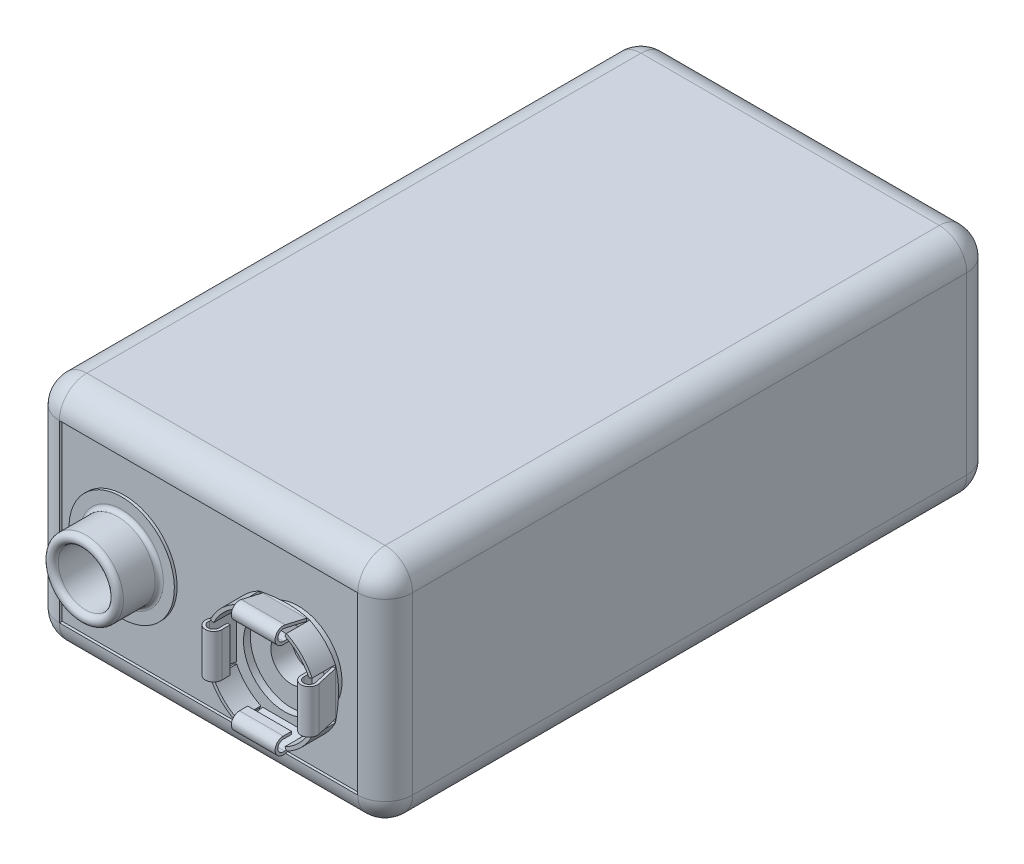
ISO-10303-21;
HEADER;
FILE_DESCRIPTION(('STEP AP214'),'2;1');
FILE_NAME('part.step','',(''),(''),'','','');
FILE_SCHEMA(('AUTOMOTIVE_DESIGN { 1 0 10303 214 1 1 1 1 }'));
ENDSEC;
DATA;
#1=APPLICATION_CONTEXT('core data for automotive mechanical design processes');
#2=APPLICATION_PROTOCOL_DEFINITION('international standard','automotive_design',2000,#1);
#3=PRODUCT_CONTEXT('',#1,'mechanical');
#4=PRODUCT('Part','Part','',(#3));
#5=PRODUCT_RELATED_PRODUCT_CATEGORY('part','',(#4));
#6=PRODUCT_DEFINITION_FORMATION('','',#4);
#7=PRODUCT_DEFINITION_CONTEXT('part definition',#1,'design');
#8=PRODUCT_DEFINITION('design','',#6,#7);
#9=PRODUCT_DEFINITION_SHAPE('','',#8);
#10=(LENGTH_UNIT() NAMED_UNIT(*) SI_UNIT(.MILLI.,.METRE.));
#11=(NAMED_UNIT(*) PLANE_ANGLE_UNIT() SI_UNIT($,.RADIAN.));
#12=(NAMED_UNIT(*) SI_UNIT($,.STERADIAN.) SOLID_ANGLE_UNIT());
#13=UNCERTAINTY_MEASURE_WITH_UNIT(LENGTH_MEASURE(1.E-05),#10,'distance_accuracy_value','');
#14=(GEOMETRIC_REPRESENTATION_CONTEXT(3) GLOBAL_UNCERTAINTY_ASSIGNED_CONTEXT((#13)) GLOBAL_UNIT_ASSIGNED_CONTEXT((#10,
#11,#12)) REPRESENTATION_CONTEXT('',''));
#15=CARTESIAN_POINT('',(0.,0.,0.));
#16=DIRECTION('',(0.,0.,1.));
#17=DIRECTION('',(1.,0.,0.));
#18=AXIS2_PLACEMENT_3D('',#15,#16,#17);
#19=CARTESIAN_POINT('',(6.35000000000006,0.,43.3));
#20=DIRECTION('',(0.,0.,-1.));
#21=DIRECTION('',(0.,1.,0.));
#22=AXIS2_PLACEMENT_3D('',#19,#20,#21);
#23=PLANE('',#22);
#24=CARTESIAN_POINT('',(6.35000000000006,0.,43.3));
#25=DIRECTION('',(0.,0.,1.));
#26=DIRECTION('',(0.,-1.,0.));
#27=AXIS2_PLACEMENT_3D('',#24,#25,#26);
#28=CIRCLE('',#27,1.5);
#29=CARTESIAN_POINT('',(6.35000000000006,-1.50000000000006,43.3));
#30=VERTEX_POINT('',#29);
#31=EDGE_CURVE('E18',#30,#30,#28,.T.);
#32=ORIENTED_EDGE('',*,*,#31,.T.);
#33=EDGE_LOOP('',(#32));
#34=FACE_BOUND('',#33,.T.);
#35=ADVANCED_FACE('F14',(#34),#23,.F.);
#36=CARTESIAN_POINT('',(6.35000000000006,0.,44.3));
#37=DIRECTION('',(0.,0.,1.));
#38=DIRECTION('',(0.,-1.,0.));
#39=AXIS2_PLACEMENT_3D('',#36,#37,#38);
#40=CYLINDRICAL_SURFACE('',#39,1.5);
#41=ORIENTED_EDGE('',*,*,#31,.F.);
#42=EDGE_LOOP('',(#41));
#43=FACE_BOUND('',#42,.T.);
#44=CARTESIAN_POINT('',(6.35000000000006,0.,44.8));
#45=DIRECTION('',(0.,0.,1.));
#46=DIRECTION('',(0.,-1.,0.));
#47=AXIS2_PLACEMENT_3D('',#44,#45,#46);
#48=CIRCLE('',#47,1.5);
#49=CARTESIAN_POINT('',(6.35000000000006,-1.50000000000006,44.8));
#50=VERTEX_POINT('',#49);
#51=EDGE_CURVE('E339',#50,#50,#48,.T.);
#52=ORIENTED_EDGE('',*,*,#51,.T.);
#53=EDGE_LOOP('',(#52));
#54=FACE_BOUND('',#53,.T.);
#55=ADVANCED_FACE('F1021',(#43,#54),#40,.F.);
#56=CARTESIAN_POINT('',(-6.35,0.,43.5));
#57=DIRECTION('',(0.,0.,-1.));
#58=DIRECTION('',(0.,1.,0.));
#59=AXIS2_PLACEMENT_3D('',#56,#57,#58);
#60=PLANE('',#59);
#61=CARTESIAN_POINT('',(-6.35,0.,43.5));
#62=DIRECTION('',(0.,0.,1.));
#63=DIRECTION('',(0.,-1.,0.));
#64=AXIS2_PLACEMENT_3D('',#61,#62,#63);
#65=CIRCLE('',#64,1.5);
#66=CARTESIAN_POINT('',(-6.35,-1.5,43.5));
#67=VERTEX_POINT('',#66);
#68=EDGE_CURVE('E938',#67,#67,#65,.T.);
#69=ORIENTED_EDGE('',*,*,#68,.T.);
#70=EDGE_LOOP('',(#69));
#71=FACE_BOUND('',#70,.T.);
#72=ADVANCED_FACE('F2353',(#71),#60,.F.);
#73=CARTESIAN_POINT('',(6.35,-3.09433173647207,46.3887990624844));
#74=DIRECTION('',(0.,-1.,0.));
#75=DIRECTION('',(0.,0.,-1.));
#76=AXIS2_PLACEMENT_3D('',#73,#74,#75);
#77=PLANE('',#76);
#78=DIRECTION('',(0.,0.,-1.));
#79=VECTOR('',#78,1.);
#80=CARTESIAN_POINT('',(4.75,-3.09433173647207,46.3887990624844));
#81=LINE('',#80,#79);
#82=CARTESIAN_POINT('',(4.75,-3.09433173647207,46.9887990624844));
#83=VERTEX_POINT('',#82);
#84=CARTESIAN_POINT('',(4.75,-3.09433173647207,46.3887990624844));
#85=VERTEX_POINT('',#84);
#86=EDGE_CURVE('E350',#83,#85,#81,.T.);
#87=ORIENTED_EDGE('',*,*,#86,.T.);
#88=DIRECTION('',(-1.,0.,0.));
#89=VECTOR('',#88,1.);
#90=CARTESIAN_POINT('',(6.35,-3.09433173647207,46.3887990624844));
#91=LINE('',#90,#89);
#92=CARTESIAN_POINT('',(7.95,-3.09433173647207,46.3887990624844));
#93=VERTEX_POINT('',#92);
#94=EDGE_CURVE('E348',#93,#85,#91,.T.);
#95=ORIENTED_EDGE('',*,*,#94,.F.);
#96=DIRECTION('',(0.,0.,-1.));
#97=VECTOR('',#96,1.);
#98=CARTESIAN_POINT('',(7.95,-3.09433173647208,46.3887990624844));
#99=LINE('',#98,#97);
#100=CARTESIAN_POINT('',(7.95,-3.09433173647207,46.9887990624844));
#101=VERTEX_POINT('',#100);
#102=EDGE_CURVE('E329',#93,#101,#99,.F.);
#103=ORIENTED_EDGE('',*,*,#102,.T.);
#104=DIRECTION('',(1.,0.,0.));
#105=VECTOR('',#104,1.);
#106=CARTESIAN_POINT('',(6.35,-3.09433173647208,46.9887990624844));
#107=LINE('',#106,#105);
#108=EDGE_CURVE('E345',#83,#101,#107,.T.);
#109=ORIENTED_EDGE('',*,*,#108,.F.);
#110=EDGE_LOOP('',(#87,#95,#103,#109));
#111=FACE_BOUND('',#110,.T.);
#112=ADVANCED_FACE('F344',(#111),#77,.T.);
#113=CARTESIAN_POINT('',(3.25566826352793,0.,46.3887990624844));
#114=DIRECTION('',(-1.,0.,0.));
#115=DIRECTION('',(0.,0.,1.));
#116=AXIS2_PLACEMENT_3D('',#113,#114,#115);
#117=PLANE('',#116);
#118=DIRECTION('',(0.,0.,1.));
#119=VECTOR('',#118,1.);
#120=CARTESIAN_POINT('',(3.25566826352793,1.6,46.3887990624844));
#121=LINE('',#120,#119);
#122=CARTESIAN_POINT('',(3.25566826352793,1.6,46.9887990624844));
#123=VERTEX_POINT('',#122);
#124=CARTESIAN_POINT('',(3.25566826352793,1.6,46.3887990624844));
#125=VERTEX_POINT('',#124);
#126=EDGE_CURVE('E984',#123,#125,#121,.F.);
#127=ORIENTED_EDGE('',*,*,#126,.T.);
#128=DIRECTION('',(0.,1.,0.));
#129=VECTOR('',#128,1.);
#130=CARTESIAN_POINT('',(3.25566826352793,0.,46.3887990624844));
#131=LINE('',#130,#129);
#132=CARTESIAN_POINT('',(3.25566826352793,-1.6,46.3887990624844));
#133=VERTEX_POINT('',#132);
#134=EDGE_CURVE('E934',#133,#125,#131,.T.);
#135=ORIENTED_EDGE('',*,*,#134,.F.);
#136=DIRECTION('',(0.,0.,1.));
#137=VECTOR('',#136,1.);
#138=CARTESIAN_POINT('',(3.25566826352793,-1.6,46.3887990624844));
#139=LINE('',#138,#137);
#140=CARTESIAN_POINT('',(3.25566826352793,-1.6,46.9887990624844));
#141=VERTEX_POINT('',#140);
#142=EDGE_CURVE('E923',#133,#141,#139,.T.);
#143=ORIENTED_EDGE('',*,*,#142,.T.);
#144=DIRECTION('',(0.,-1.,0.));
#145=VECTOR('',#144,1.);
#146=CARTESIAN_POINT('',(3.25566826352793,0.,46.9887990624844));
#147=LINE('',#146,#145);
#148=EDGE_CURVE('E360',#123,#141,#147,.T.);
#149=ORIENTED_EDGE('',*,*,#148,.F.);
#150=EDGE_LOOP('',(#127,#135,#143,#149));
#151=FACE_BOUND('',#150,.T.);
#152=ADVANCED_FACE('F1723',(#151),#117,.T.);
#153=CARTESIAN_POINT('',(6.35,3.09433173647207,46.3887990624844));
#154=DIRECTION('',(0.,1.,0.));
#155=DIRECTION('',(0.,0.,1.));
#156=AXIS2_PLACEMENT_3D('',#153,#154,#155);
#157=PLANE('',#156);
#158=DIRECTION('',(0.,0.,1.));
#159=VECTOR('',#158,1.);
#160=CARTESIAN_POINT('',(7.95,3.09433173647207,46.3887990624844));
#161=LINE('',#160,#159);
#162=CARTESIAN_POINT('',(7.95,3.09433173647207,46.9887990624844));
#163=VERTEX_POINT('',#162);
#164=CARTESIAN_POINT('',(7.95,3.09433173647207,46.3887990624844));
#165=VERTEX_POINT('',#164);
#166=EDGE_CURVE('E983',#163,#165,#161,.F.);
#167=ORIENTED_EDGE('',*,*,#166,.T.);
#168=DIRECTION('',(-1.,0.,0.));
#169=VECTOR('',#168,1.);
#170=CARTESIAN_POINT('',(6.35,3.09433173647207,46.3887990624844));
#171=LINE('',#170,#169);
#172=CARTESIAN_POINT('',(4.75,3.09433173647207,46.3887990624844));
#173=VERTEX_POINT('',#172);
#174=EDGE_CURVE('E1037',#173,#165,#171,.F.);
#175=ORIENTED_EDGE('',*,*,#174,.F.);
#176=DIRECTION('',(0.,0.,1.));
#177=VECTOR('',#176,1.);
#178=CARTESIAN_POINT('',(4.75,3.09433173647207,46.3887990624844));
#179=LINE('',#178,#177);
#180=CARTESIAN_POINT('',(4.75,3.09433173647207,46.9887990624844));
#181=VERTEX_POINT('',#180);
#182=EDGE_CURVE('E980',#173,#181,#179,.T.);
#183=ORIENTED_EDGE('',*,*,#182,.T.);
#184=DIRECTION('',(-1.,0.,0.));
#185=VECTOR('',#184,1.);
#186=CARTESIAN_POINT('',(6.35,3.09433173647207,46.9887990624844));
#187=LINE('',#186,#185);
#188=EDGE_CURVE('E1002',#163,#181,#187,.T.);
#189=ORIENTED_EDGE('',*,*,#188,.F.);
#190=EDGE_LOOP('',(#167,#175,#183,#189));
#191=FACE_BOUND('',#190,.T.);
#192=ADVANCED_FACE('F1026',(#191),#157,.T.);
#193=CARTESIAN_POINT('',(6.35000000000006,0.,44.8));
#194=DIRECTION('',(0.,0.,-1.));
#195=DIRECTION('',(0.,1.,0.));
#196=AXIS2_PLACEMENT_3D('',#193,#194,#195);
#197=PLANE('',#196);
#198=ORIENTED_EDGE('',*,*,#51,.F.);
#199=EDGE_LOOP('',(#198));
#200=FACE_BOUND('',#199,.T.);
#201=CARTESIAN_POINT('',(6.35000000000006,0.,44.8));
#202=DIRECTION('',(0.,0.,1.));
#203=DIRECTION('',(0.,-1.,0.));
#204=AXIS2_PLACEMENT_3D('',#201,#202,#203);
#205=CIRCLE('',#204,3.);
#206=CARTESIAN_POINT('',(6.35000000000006,-3.00000000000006,44.8));
#207=VERTEX_POINT('',#206);
#208=EDGE_CURVE('E1030',#207,#207,#205,.T.);
#209=ORIENTED_EDGE('',*,*,#208,.T.);
#210=EDGE_LOOP('',(#209));
#211=FACE_BOUND('',#210,.T.);
#212=ADVANCED_FACE('F1023',(#200,#211),#197,.F.);
#213=CARTESIAN_POINT('',(4.75,-3.49433173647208,46.9887990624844));
#214=DIRECTION('',(1.,0.,0.));
#215=DIRECTION('',(0.,1.,0.));
#216=AXIS2_PLACEMENT_3D('',#213,#214,#215);
#217=CYLINDRICAL_SURFACE('',#216,0.4);
#218=CARTESIAN_POINT('',(4.75,-3.49433173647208,46.9887990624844));
#219=DIRECTION('',(1.,0.,0.));
#220=DIRECTION('',(0.,1.,0.));
#221=AXIS2_PLACEMENT_3D('',#218,#219,#220);
#222=CIRCLE('',#221,0.4);
#223=CARTESIAN_POINT('',(4.75,-3.88407976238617,46.8988186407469));
#224=VERTEX_POINT('',#223);
#225=EDGE_CURVE('E338',#224,#83,#222,.F.);
#226=ORIENTED_EDGE('',*,*,#225,.T.);
#227=ORIENTED_EDGE('',*,*,#108,.T.);
#228=CARTESIAN_POINT('',(7.95,-3.49433173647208,46.9887990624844));
#229=DIRECTION('',(1.,0.,0.));
#230=DIRECTION('',(0.,1.,0.));
#231=AXIS2_PLACEMENT_3D('',#228,#229,#230);
#232=CIRCLE('',#231,0.4);
#233=CARTESIAN_POINT('',(7.95,-3.88407976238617,46.8988186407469));
#234=VERTEX_POINT('',#233);
#235=EDGE_CURVE('E325',#101,#234,#232,.T.);
#236=ORIENTED_EDGE('',*,*,#235,.T.);
#237=DIRECTION('',(1.,0.,0.));
#238=VECTOR('',#237,1.);
#239=CARTESIAN_POINT('',(6.35,-3.88407976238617,46.8988186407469));
#240=LINE('',#239,#238);
#241=EDGE_CURVE('E1032',#224,#234,#240,.T.);
#242=ORIENTED_EDGE('',*,*,#241,.F.);
#243=EDGE_LOOP('',(#226,#227,#236,#242));
#244=FACE_BOUND('',#243,.T.);
#245=ADVANCED_FACE('F352',(#244),#217,.F.);
#246=CARTESIAN_POINT('',(2.85566826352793,1.6,46.9887990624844));
#247=DIRECTION('',(0.,-1.,0.));
#248=DIRECTION('',(1.,0.,0.));
#249=AXIS2_PLACEMENT_3D('',#246,#247,#248);
#250=CYLINDRICAL_SURFACE('',#249,0.4);
#251=CARTESIAN_POINT('',(2.85566826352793,1.6,46.9887990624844));
#252=DIRECTION('',(0.,-1.,0.));
#253=DIRECTION('',(1.,0.,0.));
#254=AXIS2_PLACEMENT_3D('',#251,#252,#253);
#255=CIRCLE('',#254,0.4);
#256=CARTESIAN_POINT('',(2.46592023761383,1.6,46.8988186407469));
#257=VERTEX_POINT('',#256);
#258=EDGE_CURVE('E355',#257,#123,#255,.F.);
#259=ORIENTED_EDGE('',*,*,#258,.T.);
#260=ORIENTED_EDGE('',*,*,#148,.T.);
#261=CARTESIAN_POINT('',(2.85566826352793,-1.6,46.9887990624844));
#262=DIRECTION('',(0.,-1.,0.));
#263=DIRECTION('',(1.,0.,0.));
#264=AXIS2_PLACEMENT_3D('',#261,#262,#263);
#265=CIRCLE('',#264,0.4);
#266=CARTESIAN_POINT('',(2.46592023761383,-1.6,46.8988186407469));
#267=VERTEX_POINT('',#266);
#268=EDGE_CURVE('E353',#141,#267,#265,.T.);
#269=ORIENTED_EDGE('',*,*,#268,.T.);
#270=DIRECTION('',(0.,1.,0.));
#271=VECTOR('',#270,1.);
#272=CARTESIAN_POINT('',(2.46592023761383,0.,46.8988186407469));
#273=LINE('',#272,#271);
#274=EDGE_CURVE('E1035',#257,#267,#273,.F.);
#275=ORIENTED_EDGE('',*,*,#274,.F.);
#276=EDGE_LOOP('',(#259,#260,#269,#275));
#277=FACE_BOUND('',#276,.T.);
#278=ADVANCED_FACE('F1734',(#277),#250,.F.);
#279=CARTESIAN_POINT('',(7.95,3.49433173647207,46.9887990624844));
#280=DIRECTION('',(-1.,0.,0.));
#281=DIRECTION('',(0.,0.,1.));
#282=AXIS2_PLACEMENT_3D('',#279,#280,#281);
#283=CYLINDRICAL_SURFACE('',#282,0.4);
#284=CARTESIAN_POINT('',(7.95,3.49433173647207,46.9887990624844));
#285=DIRECTION('',(-1.,0.,0.));
#286=DIRECTION('',(0.,0.,1.));
#287=AXIS2_PLACEMENT_3D('',#284,#285,#286);
#288=CIRCLE('',#287,0.4);
#289=CARTESIAN_POINT('',(7.95,3.88407976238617,46.8988186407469));
#290=VERTEX_POINT('',#289);
#291=EDGE_CURVE('E1005',#290,#163,#288,.F.);
#292=ORIENTED_EDGE('',*,*,#291,.T.);
#293=ORIENTED_EDGE('',*,*,#188,.T.);
#294=CARTESIAN_POINT('',(4.75,3.49433173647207,46.9887990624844));
#295=DIRECTION('',(-1.,0.,0.));
#296=DIRECTION('',(0.,0.,1.));
#297=AXIS2_PLACEMENT_3D('',#294,#295,#296);
#298=CIRCLE('',#297,0.4);
#299=CARTESIAN_POINT('',(4.75,3.88407976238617,46.8988186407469));
#300=VERTEX_POINT('',#299);
#301=EDGE_CURVE('E1011',#181,#300,#298,.T.);
#302=ORIENTED_EDGE('',*,*,#301,.T.);
#303=DIRECTION('',(1.,0.,0.));
#304=VECTOR('',#303,1.);
#305=CARTESIAN_POINT('',(6.35,3.88407976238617,46.8988186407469));
#306=LINE('',#305,#304);
#307=EDGE_CURVE('E977',#290,#300,#306,.F.);
#308=ORIENTED_EDGE('',*,*,#307,.F.);
#309=EDGE_LOOP('',(#292,#293,#302,#308));
#310=FACE_BOUND('',#309,.T.);
#311=ADVANCED_FACE('F1737',(#310),#283,.F.);
#312=CARTESIAN_POINT('',(9.84433173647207,-1.6,46.9887990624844));
#313=DIRECTION('',(0.,1.,0.));
#314=DIRECTION('',(0.,0.,1.));
#315=AXIS2_PLACEMENT_3D('',#312,#313,#314);
#316=CYLINDRICAL_SURFACE('',#315,0.399999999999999);
#317=CARTESIAN_POINT('',(9.84433173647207,-1.6,46.9887990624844));
#318=DIRECTION('',(0.,1.,0.));
#319=DIRECTION('',(0.,0.,1.));
#320=AXIS2_PLACEMENT_3D('',#317,#318,#319);
#321=CIRCLE('',#320,0.399999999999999);
#322=CARTESIAN_POINT('',(10.2340797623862,-1.6,46.8988186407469));
#323=VERTEX_POINT('',#322);
#324=CARTESIAN_POINT('',(9.44433173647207,-1.6,46.9887990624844));
#325=VERTEX_POINT('',#324);
#326=EDGE_CURVE('E953',#323,#325,#321,.F.);
#327=ORIENTED_EDGE('',*,*,#326,.T.);
#328=DIRECTION('',(0.,1.,0.));
#329=VECTOR('',#328,1.);
#330=CARTESIAN_POINT('',(9.44433173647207,0.,46.9887990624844));
#331=LINE('',#330,#329);
#332=CARTESIAN_POINT('',(9.44433173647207,1.6,46.9887990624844));
#333=VERTEX_POINT('',#332);
#334=EDGE_CURVE('E952',#333,#325,#331,.F.);
#335=ORIENTED_EDGE('',*,*,#334,.F.);
#336=CARTESIAN_POINT('',(9.84433173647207,1.6,46.9887990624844));
#337=DIRECTION('',(0.,1.,0.));
#338=DIRECTION('',(0.,0.,1.));
#339=AXIS2_PLACEMENT_3D('',#336,#337,#338);
#340=CIRCLE('',#339,0.399999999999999);
#341=CARTESIAN_POINT('',(10.2340797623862,1.6,46.8988186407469));
#342=VERTEX_POINT('',#341);
#343=EDGE_CURVE('E1004',#333,#342,#340,.T.);
#344=ORIENTED_EDGE('',*,*,#343,.T.);
#345=DIRECTION('',(0.,1.,0.));
#346=VECTOR('',#345,1.);
#347=CARTESIAN_POINT('',(10.2340797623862,0.,46.8988186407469));
#348=LINE('',#347,#346);
#349=EDGE_CURVE('E959',#323,#342,#348,.T.);
#350=ORIENTED_EDGE('',*,*,#349,.F.);
#351=EDGE_LOOP('',(#327,#335,#344,#350));
#352=FACE_BOUND('',#351,.T.);
#353=ADVANCED_FACE('F1046',(#352),#316,.F.);
#354=CARTESIAN_POINT('',(9.44433173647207,0.,46.3887990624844));
#355=DIRECTION('',(1.,0.,0.));
#356=DIRECTION('',(0.,1.,0.));
#357=AXIS2_PLACEMENT_3D('',#354,#355,#356);
#358=PLANE('',#357);
#359=DIRECTION('',(0.,0.,1.));
#360=VECTOR('',#359,1.);
#361=CARTESIAN_POINT('',(9.44433173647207,-1.6,46.3887990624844));
#362=LINE('',#361,#360);
#363=CARTESIAN_POINT('',(9.44433173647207,-1.6,46.3887990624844));
#364=VERTEX_POINT('',#363);
#365=EDGE_CURVE('E941',#325,#364,#362,.F.);
#366=ORIENTED_EDGE('',*,*,#365,.T.);
#367=DIRECTION('',(0.,1.,0.));
#368=VECTOR('',#367,1.);
#369=CARTESIAN_POINT('',(9.44433173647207,0.,46.3887990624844));
#370=LINE('',#369,#368);
#371=CARTESIAN_POINT('',(9.44433173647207,1.6,46.3887990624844));
#372=VERTEX_POINT('',#371);
#373=EDGE_CURVE('E962',#372,#364,#370,.F.);
#374=ORIENTED_EDGE('',*,*,#373,.F.);
#375=DIRECTION('',(0.,0.,1.));
#376=VECTOR('',#375,1.);
#377=CARTESIAN_POINT('',(9.44433173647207,1.6,46.3887990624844));
#378=LINE('',#377,#376);
#379=EDGE_CURVE('E949',#372,#333,#378,.T.);
#380=ORIENTED_EDGE('',*,*,#379,.T.);
#381=ORIENTED_EDGE('',*,*,#334,.T.);
#382=EDGE_LOOP('',(#366,#374,#380,#381));
#383=FACE_BOUND('',#382,.T.);
#384=ADVANCED_FACE('F1056',(#383),#358,.T.);
#385=CARTESIAN_POINT('',(-6.35,0.,45.5));
#386=DIRECTION('',(0.,0.,1.));
#387=DIRECTION('',(0.,-1.,0.));
#388=AXIS2_PLACEMENT_3D('',#385,#386,#387);
#389=CYLINDRICAL_SURFACE('',#388,1.5);
#390=ORIENTED_EDGE('',*,*,#68,.F.);
#391=EDGE_LOOP('',(#390));
#392=FACE_BOUND('',#391,.T.);
#393=CARTESIAN_POINT('',(-6.35,0.,44.5));
#394=DIRECTION('',(0.,0.,1.));
#395=DIRECTION('',(0.,-1.,0.));
#396=AXIS2_PLACEMENT_3D('',#393,#394,#395);
#397=CIRCLE('',#396,1.5);
#398=CARTESIAN_POINT('',(-6.35,-1.5,44.5));
#399=VERTEX_POINT('',#398);
#400=EDGE_CURVE('E1040',#399,#399,#397,.T.);
#401=ORIENTED_EDGE('',*,*,#400,.T.);
#402=EDGE_LOOP('',(#401));
#403=FACE_BOUND('',#402,.T.);
#404=ADVANCED_FACE('F1745',(#392,#403),#389,.F.);
#405=CARTESIAN_POINT('',(6.35,-2.89433173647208,46.3887990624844));
#406=DIRECTION('',(0.,0.,-1.));
#407=DIRECTION('',(-1.,0.,0.));
#408=AXIS2_PLACEMENT_3D('',#405,#406,#407);
#409=PLANE('',#408);
#410=DIRECTION('',(0.,1.,0.));
#411=VECTOR('',#410,1.);
#412=CARTESIAN_POINT('',(4.75,-2.89433173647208,46.3887990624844));
#413=LINE('',#412,#411);
#414=CARTESIAN_POINT('',(4.75,-2.89433173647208,46.3887990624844));
#415=VERTEX_POINT('',#414);
#416=EDGE_CURVE('E926',#85,#415,#413,.T.);
#417=ORIENTED_EDGE('',*,*,#416,.T.);
#418=DIRECTION('',(1.,0.,0.));
#419=VECTOR('',#418,1.);
#420=CARTESIAN_POINT('',(6.35,-2.89433173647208,46.3887990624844));
#421=LINE('',#420,#419);
#422=CARTESIAN_POINT('',(7.95,-2.89433173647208,46.3887990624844));
#423=VERTEX_POINT('',#422);
#424=EDGE_CURVE('E1243',#423,#415,#421,.F.);
#425=ORIENTED_EDGE('',*,*,#424,.F.);
#426=DIRECTION('',(0.,1.,0.));
#427=VECTOR('',#426,1.);
#428=CARTESIAN_POINT('',(7.95,-3.54446353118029,46.3887990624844));
#429=LINE('',#428,#427);
#430=EDGE_CURVE('E937',#93,#423,#429,.T.);
#431=ORIENTED_EDGE('',*,*,#430,.F.);
#432=ORIENTED_EDGE('',*,*,#94,.T.);
#433=EDGE_LOOP('',(#417,#425,#431,#432));
#434=FACE_BOUND('',#433,.T.);
#435=ADVANCED_FACE('F936',(#434),#409,.T.);
#436=CARTESIAN_POINT('',(3.45566826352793,0.,46.3887990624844));
#437=DIRECTION('',(0.,0.,-1.));
#438=DIRECTION('',(-1.,0.,0.));
#439=AXIS2_PLACEMENT_3D('',#436,#437,#438);
#440=PLANE('',#439);
#441=DIRECTION('',(-1.,0.,0.));
#442=VECTOR('',#441,1.);
#443=CARTESIAN_POINT('',(3.45566826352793,1.6,46.3887990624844));
#444=LINE('',#443,#442);
#445=CARTESIAN_POINT('',(3.45566826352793,1.6,46.3887990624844));
#446=VERTEX_POINT('',#445);
#447=EDGE_CURVE('E1219',#125,#446,#444,.F.);
#448=ORIENTED_EDGE('',*,*,#447,.T.);
#449=DIRECTION('',(0.,1.,0.));
#450=VECTOR('',#449,1.);
#451=CARTESIAN_POINT('',(3.45566826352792,0.,46.3887990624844));
#452=LINE('',#451,#450);
#453=CARTESIAN_POINT('',(3.45566826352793,-1.6,46.3887990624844));
#454=VERTEX_POINT('',#453);
#455=EDGE_CURVE('E1224',#454,#446,#452,.T.);
#456=ORIENTED_EDGE('',*,*,#455,.F.);
#457=DIRECTION('',(1.,0.,0.));
#458=VECTOR('',#457,1.);
#459=CARTESIAN_POINT('',(2.80553646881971,-1.6,46.3887990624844));
#460=LINE('',#459,#458);
#461=EDGE_CURVE('E1234',#133,#454,#460,.T.);
#462=ORIENTED_EDGE('',*,*,#461,.F.);
#463=ORIENTED_EDGE('',*,*,#134,.T.);
#464=EDGE_LOOP('',(#448,#456,#462,#463));
#465=FACE_BOUND('',#464,.T.);
#466=ADVANCED_FACE('F1751',(#465),#440,.T.);
#467=CARTESIAN_POINT('',(6.35,2.89433173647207,46.3887990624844));
#468=DIRECTION('',(0.,0.,-1.));
#469=DIRECTION('',(-1.,0.,0.));
#470=AXIS2_PLACEMENT_3D('',#467,#468,#469);
#471=PLANE('',#470);
#472=DIRECTION('',(0.,1.,0.));
#473=VECTOR('',#472,1.);
#474=CARTESIAN_POINT('',(7.95,2.89433173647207,46.3887990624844));
#475=LINE('',#474,#473);
#476=CARTESIAN_POINT('',(7.95,2.89433173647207,46.3887990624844));
#477=VERTEX_POINT('',#476);
#478=EDGE_CURVE('E1033',#165,#477,#475,.F.);
#479=ORIENTED_EDGE('',*,*,#478,.T.);
#480=DIRECTION('',(1.,0.,0.));
#481=VECTOR('',#480,1.);
#482=CARTESIAN_POINT('',(6.35,2.89433173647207,46.3887990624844));
#483=LINE('',#482,#481);
#484=CARTESIAN_POINT('',(4.75,2.89433173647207,46.3887990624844));
#485=VERTEX_POINT('',#484);
#486=EDGE_CURVE('E1203',#485,#477,#483,.T.);
#487=ORIENTED_EDGE('',*,*,#486,.F.);
#488=DIRECTION('',(0.,-1.,0.));
#489=VECTOR('',#488,1.);
#490=CARTESIAN_POINT('',(4.75,3.54446353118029,46.3887990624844));
#491=LINE('',#490,#489);
#492=EDGE_CURVE('E1212',#173,#485,#491,.T.);
#493=ORIENTED_EDGE('',*,*,#492,.F.);
#494=ORIENTED_EDGE('',*,*,#174,.T.);
#495=EDGE_LOOP('',(#479,#487,#493,#494));
#496=FACE_BOUND('',#495,.T.);
#497=ADVANCED_FACE('F1719',(#496),#471,.T.);
#498=CARTESIAN_POINT('',(6.35000000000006,0.,45.05));
#499=DIRECTION('',(0.,0.,1.));
#500=DIRECTION('',(0.,-1.,0.));
#501=AXIS2_PLACEMENT_3D('',#498,#499,#500);
#502=CYLINDRICAL_SURFACE('',#501,3.);
#503=ORIENTED_EDGE('',*,*,#208,.F.);
#504=EDGE_LOOP('',(#503));
#505=FACE_BOUND('',#504,.T.);
#506=CARTESIAN_POINT('',(6.35000000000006,0.,45.3));
#507=DIRECTION('',(0.,0.,1.));
#508=DIRECTION('',(0.,-1.,0.));
#509=AXIS2_PLACEMENT_3D('',#506,#507,#508);
#510=CIRCLE('',#509,3.);
#511=CARTESIAN_POINT('',(6.35000000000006,-3.00000000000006,45.3));
#512=VERTEX_POINT('',#511);
#513=EDGE_CURVE('E1198',#512,#512,#510,.T.);
#514=ORIENTED_EDGE('',*,*,#513,.T.);
#515=EDGE_LOOP('',(#514));
#516=FACE_BOUND('',#515,.T.);
#517=ADVANCED_FACE('F1612',(#505,#516),#502,.F.);
#518=CARTESIAN_POINT('',(6.35,-3.88407976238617,46.8988186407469));
#519=DIRECTION('',(0.,0.974370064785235,0.224951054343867));
#520=DIRECTION('',(0.,-0.224951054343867,0.974370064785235));
#521=AXIS2_PLACEMENT_3D('',#518,#519,#520);
#522=PLANE('',#521);
#523=DIRECTION('',(0.,-0.224951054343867,0.974370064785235));
#524=VECTOR('',#523,1.);
#525=CARTESIAN_POINT('',(4.75,-3.5149633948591,45.3));
#526=LINE('',#525,#524);
#527=CARTESIAN_POINT('',(4.75,-3.5149633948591,45.3));
#528=VERTEX_POINT('',#527);
#529=EDGE_CURVE('E1260',#528,#224,#526,.T.);
#530=ORIENTED_EDGE('',*,*,#529,.T.);
#531=ORIENTED_EDGE('',*,*,#241,.T.);
#532=DIRECTION('',(0.,-0.224951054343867,0.974370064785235));
#533=VECTOR('',#532,1.);
#534=CARTESIAN_POINT('',(7.95,-3.5149633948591,45.3));
#535=LINE('',#534,#533);
#536=CARTESIAN_POINT('',(7.95,-3.5149633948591,45.3));
#537=VERTEX_POINT('',#536);
#538=EDGE_CURVE('E333',#537,#234,#535,.T.);
#539=ORIENTED_EDGE('',*,*,#538,.F.);
#540=DIRECTION('',(1.,0.,0.));
#541=VECTOR('',#540,1.);
#542=CARTESIAN_POINT('',(6.35,-3.5149633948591,45.3));
#543=LINE('',#542,#541);
#544=EDGE_CURVE('E1194',#537,#528,#543,.F.);
#545=ORIENTED_EDGE('',*,*,#544,.T.);
#546=EDGE_LOOP('',(#530,#531,#539,#545));
#547=FACE_BOUND('',#546,.T.);
#548=ADVANCED_FACE('F1759',(#547),#522,.T.);
#549=CARTESIAN_POINT('',(2.46592023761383,0.,46.8988186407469));
#550=DIRECTION('',(0.974370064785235,0.,0.224951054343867));
#551=DIRECTION('',(0.224951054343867,0.,-0.974370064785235));
#552=AXIS2_PLACEMENT_3D('',#549,#550,#551);
#553=PLANE('',#552);
#554=DIRECTION('',(-0.224951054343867,0.,0.974370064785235));
#555=VECTOR('',#554,1.);
#556=CARTESIAN_POINT('',(2.8350366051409,1.6,45.3));
#557=LINE('',#556,#555);
#558=CARTESIAN_POINT('',(2.8350366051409,1.6,45.3));
#559=VERTEX_POINT('',#558);
#560=EDGE_CURVE('E1281',#559,#257,#557,.T.);
#561=ORIENTED_EDGE('',*,*,#560,.T.);
#562=ORIENTED_EDGE('',*,*,#274,.T.);
#563=DIRECTION('',(-0.224951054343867,0.,0.974370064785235));
#564=VECTOR('',#563,1.);
#565=CARTESIAN_POINT('',(2.8350366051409,-1.6,45.3));
#566=LINE('',#565,#564);
#567=CARTESIAN_POINT('',(2.8350366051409,-1.6,45.3));
#568=VERTEX_POINT('',#567);
#569=EDGE_CURVE('E1236',#568,#267,#566,.T.);
#570=ORIENTED_EDGE('',*,*,#569,.F.);
#571=DIRECTION('',(0.,1.,0.));
#572=VECTOR('',#571,1.);
#573=CARTESIAN_POINT('',(2.8350366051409,0.,45.3));
#574=LINE('',#573,#572);
#575=EDGE_CURVE('E1171',#568,#559,#574,.T.);
#576=ORIENTED_EDGE('',*,*,#575,.T.);
#577=EDGE_LOOP('',(#561,#562,#570,#576));
#578=FACE_BOUND('',#577,.T.);
#579=ADVANCED_FACE('F1762',(#578),#553,.T.);
#580=CARTESIAN_POINT('',(6.35,3.88407976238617,46.8988186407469));
#581=DIRECTION('',(0.,-0.974370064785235,0.224951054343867));
#582=DIRECTION('',(0.,-0.224951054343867,-0.974370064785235));
#583=AXIS2_PLACEMENT_3D('',#580,#581,#582);
#584=PLANE('',#583);
#585=DIRECTION('',(0.,0.224951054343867,0.974370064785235));
#586=VECTOR('',#585,1.);
#587=CARTESIAN_POINT('',(7.95,3.5149633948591,45.3));
#588=LINE('',#587,#586);
#589=CARTESIAN_POINT('',(7.95,3.5149633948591,45.3));
#590=VERTEX_POINT('',#589);
#591=EDGE_CURVE('E1302',#590,#290,#588,.T.);
#592=ORIENTED_EDGE('',*,*,#591,.T.);
#593=ORIENTED_EDGE('',*,*,#307,.T.);
#594=DIRECTION('',(0.,0.224951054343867,0.974370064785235));
#595=VECTOR('',#594,1.);
#596=CARTESIAN_POINT('',(4.75,3.5149633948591,45.3));
#597=LINE('',#596,#595);
#598=CARTESIAN_POINT('',(4.75,3.5149633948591,45.3));
#599=VERTEX_POINT('',#598);
#600=EDGE_CURVE('E1214',#599,#300,#597,.T.);
#601=ORIENTED_EDGE('',*,*,#600,.F.);
#602=DIRECTION('',(1.,0.,0.));
#603=VECTOR('',#602,1.);
#604=CARTESIAN_POINT('',(6.35,3.5149633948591,45.3));
#605=LINE('',#604,#603);
#606=EDGE_CURVE('E1140',#599,#590,#605,.T.);
#607=ORIENTED_EDGE('',*,*,#606,.T.);
#608=EDGE_LOOP('',(#592,#593,#601,#607));
#609=FACE_BOUND('',#608,.T.);
#610=ADVANCED_FACE('F1677',(#609),#584,.T.);
#611=CARTESIAN_POINT('',(10.2340797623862,0.,46.8988186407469));
#612=DIRECTION('',(-0.974370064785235,0.,0.224951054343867));
#613=DIRECTION('',(0.224951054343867,0.,0.974370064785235));
#614=AXIS2_PLACEMENT_3D('',#611,#612,#613);
#615=PLANE('',#614);
#616=DIRECTION('',(0.224951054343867,0.,0.974370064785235));
#617=VECTOR('',#616,1.);
#618=CARTESIAN_POINT('',(10.2340797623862,-1.6,46.8988186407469));
#619=LINE('',#618,#617);
#620=CARTESIAN_POINT('',(9.8649633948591,-1.6,45.3));
#621=VERTEX_POINT('',#620);
#622=EDGE_CURVE('E963',#621,#323,#619,.T.);
#623=ORIENTED_EDGE('',*,*,#622,.T.);
#624=ORIENTED_EDGE('',*,*,#349,.T.);
#625=DIRECTION('',(0.224951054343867,0.,0.974370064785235));
#626=VECTOR('',#625,1.);
#627=CARTESIAN_POINT('',(10.2340797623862,1.6,46.8988186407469));
#628=LINE('',#627,#626);
#629=CARTESIAN_POINT('',(9.8649633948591,1.6,45.3));
#630=VERTEX_POINT('',#629);
#631=EDGE_CURVE('E966',#342,#630,#628,.F.);
#632=ORIENTED_EDGE('',*,*,#631,.T.);
#633=DIRECTION('',(0.,1.,0.));
#634=VECTOR('',#633,1.);
#635=CARTESIAN_POINT('',(9.8649633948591,0.,45.3));
#636=LINE('',#635,#634);
#637=EDGE_CURVE('E969',#630,#621,#636,.F.);
#638=ORIENTED_EDGE('',*,*,#637,.T.);
#639=EDGE_LOOP('',(#623,#624,#632,#638));
#640=FACE_BOUND('',#639,.T.);
#641=ADVANCED_FACE('F1064',(#640),#615,.T.);
#642=CARTESIAN_POINT('',(9.24433173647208,0.,46.3887990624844));
#643=DIRECTION('',(0.,0.,-1.));
#644=DIRECTION('',(-1.,0.,0.));
#645=AXIS2_PLACEMENT_3D('',#642,#643,#644);
#646=PLANE('',#645);
#647=DIRECTION('',(-1.,0.,0.));
#648=VECTOR('',#647,1.);
#649=CARTESIAN_POINT('',(9.24433173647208,-1.6,46.3887990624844));
#650=LINE('',#649,#648);
#651=CARTESIAN_POINT('',(9.24433173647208,-1.6,46.3887990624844));
#652=VERTEX_POINT('',#651);
#653=EDGE_CURVE('E1052',#364,#652,#650,.T.);
#654=ORIENTED_EDGE('',*,*,#653,.T.);
#655=DIRECTION('',(0.,1.,0.));
#656=VECTOR('',#655,1.);
#657=CARTESIAN_POINT('',(9.24433173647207,0.,46.3887990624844));
#658=LINE('',#657,#656);
#659=CARTESIAN_POINT('',(9.24433173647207,1.6,46.3887990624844));
#660=VERTEX_POINT('',#659);
#661=EDGE_CURVE('E1086',#660,#652,#658,.F.);
#662=ORIENTED_EDGE('',*,*,#661,.F.);
#663=DIRECTION('',(1.,0.,0.));
#664=VECTOR('',#663,1.);
#665=CARTESIAN_POINT('',(9.89446353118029,1.6,46.3887990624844));
#666=LINE('',#665,#664);
#667=EDGE_CURVE('E1060',#372,#660,#666,.F.);
#668=ORIENTED_EDGE('',*,*,#667,.F.);
#669=ORIENTED_EDGE('',*,*,#373,.T.);
#670=EDGE_LOOP('',(#654,#662,#668,#669));
#671=FACE_BOUND('',#670,.T.);
#672=ADVANCED_FACE('F1667',(#671),#646,.T.);
#673=CARTESIAN_POINT('',(-6.35,0.,44.5));
#674=DIRECTION('',(0.,0.,-1.));
#675=DIRECTION('',(0.,1.,0.));
#676=AXIS2_PLACEMENT_3D('',#673,#674,#675);
#677=PLANE('',#676);
#678=ORIENTED_EDGE('',*,*,#400,.F.);
#679=EDGE_LOOP('',(#678));
#680=FACE_BOUND('',#679,.T.);
#681=CARTESIAN_POINT('',(-6.35,0.,44.5));
#682=DIRECTION('',(0.,0.,1.));
#683=DIRECTION('',(0.,-1.,0.));
#684=AXIS2_PLACEMENT_3D('',#681,#682,#683);
#685=CIRCLE('',#684,2.);
#686=CARTESIAN_POINT('',(-6.35,-2.,44.5));
#687=VERTEX_POINT('',#686);
#688=EDGE_CURVE('E1073',#687,#687,#685,.T.);
#689=ORIENTED_EDGE('',*,*,#688,.T.);
#690=EDGE_LOOP('',(#689));
#691=FACE_BOUND('',#690,.T.);
#692=ADVANCED_FACE('F1669',(#680,#691),#677,.F.);
#693=CARTESIAN_POINT('',(7.95,-3.54446353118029,46.6436282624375));
#694=DIRECTION('',(1.,0.,0.));
#695=DIRECTION('',(0.,1.,0.));
#696=AXIS2_PLACEMENT_3D('',#693,#694,#695);
#697=PLANE('',#696);
#698=DIRECTION('',(0.,0.,1.));
#699=VECTOR('',#698,1.);
#700=CARTESIAN_POINT('',(7.95,-2.89433173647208,46.9887990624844));
#701=LINE('',#700,#699);
#702=CARTESIAN_POINT('',(7.95,-2.89433173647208,46.9887990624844));
#703=VERTEX_POINT('',#702);
#704=EDGE_CURVE('E1245',#703,#423,#701,.F.);
#705=ORIENTED_EDGE('',*,*,#704,.F.);
#706=CARTESIAN_POINT('',(7.95,-3.49433173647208,46.9887990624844));
#707=DIRECTION('',(1.,0.,0.));
#708=DIRECTION('',(0.,1.,0.));
#709=AXIS2_PLACEMENT_3D('',#706,#707,#708);
#710=CIRCLE('',#709,0.599999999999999);
#711=CARTESIAN_POINT('',(7.95,-4.07895377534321,46.8538284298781));
#712=VERTEX_POINT('',#711);
#713=EDGE_CURVE('E1470',#712,#703,#710,.F.);
#714=ORIENTED_EDGE('',*,*,#713,.F.);
#715=DIRECTION('',(0.,0.224951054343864,-0.974370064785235));
#716=VECTOR('',#715,1.);
#717=CARTESIAN_POINT('',(7.95,-4.07895377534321,46.8538284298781));
#718=LINE('',#717,#716);
#719=CARTESIAN_POINT('',(7.95,-3.72022421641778,45.3));
#720=VERTEX_POINT('',#719);
#721=EDGE_CURVE('E1251',#712,#720,#718,.T.);
#722=ORIENTED_EDGE('',*,*,#721,.T.);
#723=DIRECTION('',(0.,1.,0.));
#724=VECTOR('',#723,1.);
#725=CARTESIAN_POINT('',(7.95,0.,45.3));
#726=LINE('',#725,#724);
#727=EDGE_CURVE('E1112',#720,#537,#726,.T.);
#728=ORIENTED_EDGE('',*,*,#727,.T.);
#729=ORIENTED_EDGE('',*,*,#538,.T.);
#730=ORIENTED_EDGE('',*,*,#235,.F.);
#731=ORIENTED_EDGE('',*,*,#102,.F.);
#732=ORIENTED_EDGE('',*,*,#430,.T.);
#733=EDGE_LOOP('',(#705,#714,#722,#728,#729,#730,#731,#732));
#734=FACE_BOUND('',#733,.T.);
#735=ADVANCED_FACE('F327',(#734),#697,.T.);
#736=CARTESIAN_POINT('',(6.35,-2.89433173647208,46.9887990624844));
#737=DIRECTION('',(0.,1.,0.));
#738=DIRECTION('',(0.,0.,1.));
#739=AXIS2_PLACEMENT_3D('',#736,#737,#738);
#740=PLANE('',#739);
#741=DIRECTION('',(0.,0.,1.));
#742=VECTOR('',#741,1.);
#743=CARTESIAN_POINT('',(4.75,-2.89433173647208,46.6436282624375));
#744=LINE('',#743,#742);
#745=CARTESIAN_POINT('',(4.75,-2.89433173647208,46.9887990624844));
#746=VERTEX_POINT('',#745);
#747=EDGE_CURVE('E930',#415,#746,#744,.T.);
#748=ORIENTED_EDGE('',*,*,#747,.T.);
#749=DIRECTION('',(1.,0.,0.));
#750=VECTOR('',#749,1.);
#751=CARTESIAN_POINT('',(6.35,-2.89433173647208,46.9887990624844));
#752=LINE('',#751,#750);
#753=EDGE_CURVE('E1466',#703,#746,#752,.F.);
#754=ORIENTED_EDGE('',*,*,#753,.F.);
#755=ORIENTED_EDGE('',*,*,#704,.T.);
#756=ORIENTED_EDGE('',*,*,#424,.T.);
#757=EDGE_LOOP('',(#748,#754,#755,#756));
#758=FACE_BOUND('',#757,.T.);
#759=ADVANCED_FACE('F1683',(#758),#740,.T.);
#760=CARTESIAN_POINT('',(4.75,-3.54446353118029,46.6436282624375));
#761=DIRECTION('',(1.,0.,0.));
#762=DIRECTION('',(0.,1.,0.));
#763=AXIS2_PLACEMENT_3D('',#760,#761,#762);
#764=PLANE('',#763);
#765=DIRECTION('',(0.,1.,0.));
#766=VECTOR('',#765,1.);
#767=CARTESIAN_POINT('',(4.75,0.,45.3));
#768=LINE('',#767,#766);
#769=CARTESIAN_POINT('',(4.75,-3.72022421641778,45.3));
#770=VERTEX_POINT('',#769);
#771=EDGE_CURVE('E1190',#528,#770,#768,.F.);
#772=ORIENTED_EDGE('',*,*,#771,.T.);
#773=DIRECTION('',(0.,0.224951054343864,-0.974370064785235));
#774=VECTOR('',#773,1.);
#775=CARTESIAN_POINT('',(4.75,-4.07895377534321,46.8538284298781));
#776=LINE('',#775,#774);
#777=CARTESIAN_POINT('',(4.75,-4.07895377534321,46.8538284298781));
#778=VERTEX_POINT('',#777);
#779=EDGE_CURVE('E1264',#778,#770,#776,.T.);
#780=ORIENTED_EDGE('',*,*,#779,.F.);
#781=CARTESIAN_POINT('',(4.75,-3.49433173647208,46.9887990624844));
#782=DIRECTION('',(1.,0.,0.));
#783=DIRECTION('',(0.,1.,0.));
#784=AXIS2_PLACEMENT_3D('',#781,#782,#783);
#785=CIRCLE('',#784,0.599999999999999);
#786=EDGE_CURVE('E1469',#746,#778,#785,.T.);
#787=ORIENTED_EDGE('',*,*,#786,.F.);
#788=ORIENTED_EDGE('',*,*,#747,.F.);
#789=ORIENTED_EDGE('',*,*,#416,.F.);
#790=ORIENTED_EDGE('',*,*,#86,.F.);
#791=ORIENTED_EDGE('',*,*,#225,.F.);
#792=ORIENTED_EDGE('',*,*,#529,.F.);
#793=EDGE_LOOP('',(#772,#780,#787,#788,#789,#790,#791,#792));
#794=FACE_BOUND('',#793,.T.);
#795=ADVANCED_FACE('F928',(#794),#764,.F.);
#796=CARTESIAN_POINT('',(2.80553646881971,-1.6,46.6436282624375));
#797=DIRECTION('',(0.,-1.,0.));
#798=DIRECTION('',(1.,0.,0.));
#799=AXIS2_PLACEMENT_3D('',#796,#797,#798);
#800=PLANE('',#799);
#801=DIRECTION('',(0.,0.,1.));
#802=VECTOR('',#801,1.);
#803=CARTESIAN_POINT('',(3.45566826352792,-1.6,46.9887990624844));
#804=LINE('',#803,#802);
#805=CARTESIAN_POINT('',(3.45566826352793,-1.6,46.9887990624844));
#806=VERTEX_POINT('',#805);
#807=EDGE_CURVE('E1228',#806,#454,#804,.F.);
#808=ORIENTED_EDGE('',*,*,#807,.F.);
#809=CARTESIAN_POINT('',(2.85566826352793,-1.6,46.9887990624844));
#810=DIRECTION('',(0.,-1.,0.));
#811=DIRECTION('',(1.,0.,0.));
#812=AXIS2_PLACEMENT_3D('',#809,#810,#811);
#813=CIRCLE('',#812,0.599999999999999);
#814=CARTESIAN_POINT('',(2.27104622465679,-1.6,46.8538284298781));
#815=VERTEX_POINT('',#814);
#816=EDGE_CURVE('E1456',#815,#806,#813,.F.);
#817=ORIENTED_EDGE('',*,*,#816,.F.);
#818=DIRECTION('',(0.224951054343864,0.,-0.974370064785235));
#819=VECTOR('',#818,1.);
#820=CARTESIAN_POINT('',(2.27104622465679,-1.6,46.8538284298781));
#821=LINE('',#820,#819);
#822=CARTESIAN_POINT('',(2.62977578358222,-1.6,45.3));
#823=VERTEX_POINT('',#822);
#824=EDGE_CURVE('E1263',#815,#823,#821,.T.);
#825=ORIENTED_EDGE('',*,*,#824,.T.);
#826=DIRECTION('',(1.,0.,0.));
#827=VECTOR('',#826,1.);
#828=CARTESIAN_POINT('',(6.35,-1.6,45.3));
#829=LINE('',#828,#827);
#830=EDGE_CURVE('E1175',#823,#568,#829,.T.);
#831=ORIENTED_EDGE('',*,*,#830,.T.);
#832=ORIENTED_EDGE('',*,*,#569,.T.);
#833=ORIENTED_EDGE('',*,*,#268,.F.);
#834=ORIENTED_EDGE('',*,*,#142,.F.);
#835=ORIENTED_EDGE('',*,*,#461,.T.);
#836=EDGE_LOOP('',(#808,#817,#825,#831,#832,#833,#834,#835));
#837=FACE_BOUND('',#836,.T.);
#838=ADVANCED_FACE('F1689',(#837),#800,.T.);
#839=CARTESIAN_POINT('',(3.45566826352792,0.,46.9887990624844));
#840=DIRECTION('',(1.,0.,0.));
#841=DIRECTION('',(0.,1.,0.));
#842=AXIS2_PLACEMENT_3D('',#839,#840,#841);
#843=PLANE('',#842);
#844=DIRECTION('',(0.,0.,1.));
#845=VECTOR('',#844,1.);
#846=CARTESIAN_POINT('',(3.45566826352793,1.6,46.6436282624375));
#847=LINE('',#846,#845);
#848=CARTESIAN_POINT('',(3.45566826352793,1.6,46.9887990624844));
#849=VERTEX_POINT('',#848);
#850=EDGE_CURVE('E1227',#446,#849,#847,.T.);
#851=ORIENTED_EDGE('',*,*,#850,.T.);
#852=DIRECTION('',(0.,-1.,0.));
#853=VECTOR('',#852,1.);
#854=CARTESIAN_POINT('',(3.45566826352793,0.,46.9887990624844));
#855=LINE('',#854,#853);
#856=EDGE_CURVE('E1452',#806,#849,#855,.F.);
#857=ORIENTED_EDGE('',*,*,#856,.F.);
#858=ORIENTED_EDGE('',*,*,#807,.T.);
#859=ORIENTED_EDGE('',*,*,#455,.T.);
#860=EDGE_LOOP('',(#851,#857,#858,#859));
#861=FACE_BOUND('',#860,.T.);
#862=ADVANCED_FACE('F1692',(#861),#843,.T.);
#863=CARTESIAN_POINT('',(2.80553646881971,1.6,46.6436282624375));
#864=DIRECTION('',(0.,-1.,0.));
#865=DIRECTION('',(1.,0.,0.));
#866=AXIS2_PLACEMENT_3D('',#863,#864,#865);
#867=PLANE('',#866);
#868=DIRECTION('',(1.,0.,0.));
#869=VECTOR('',#868,1.);
#870=CARTESIAN_POINT('',(6.35,1.6,45.3));
#871=LINE('',#870,#869);
#872=CARTESIAN_POINT('',(2.62977578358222,1.6,45.3));
#873=VERTEX_POINT('',#872);
#874=EDGE_CURVE('E1159',#559,#873,#871,.F.);
#875=ORIENTED_EDGE('',*,*,#874,.T.);
#876=DIRECTION('',(0.224951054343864,0.,-0.974370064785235));
#877=VECTOR('',#876,1.);
#878=CARTESIAN_POINT('',(2.27104622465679,1.6,46.8538284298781));
#879=LINE('',#878,#877);
#880=CARTESIAN_POINT('',(2.27104622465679,1.6,46.8538284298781));
#881=VERTEX_POINT('',#880);
#882=EDGE_CURVE('E1285',#881,#873,#879,.T.);
#883=ORIENTED_EDGE('',*,*,#882,.F.);
#884=CARTESIAN_POINT('',(2.85566826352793,1.6,46.9887990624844));
#885=DIRECTION('',(0.,-1.,0.));
#886=DIRECTION('',(1.,0.,0.));
#887=AXIS2_PLACEMENT_3D('',#884,#885,#886);
#888=CIRCLE('',#887,0.599999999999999);
#889=EDGE_CURVE('E1455',#849,#881,#888,.T.);
#890=ORIENTED_EDGE('',*,*,#889,.F.);
#891=ORIENTED_EDGE('',*,*,#850,.F.);
#892=ORIENTED_EDGE('',*,*,#447,.F.);
#893=ORIENTED_EDGE('',*,*,#126,.F.);
#894=ORIENTED_EDGE('',*,*,#258,.F.);
#895=ORIENTED_EDGE('',*,*,#560,.F.);
#896=EDGE_LOOP('',(#875,#883,#890,#891,#892,#893,#894,#895));
#897=FACE_BOUND('',#896,.T.);
#898=ADVANCED_FACE('F1696',(#897),#867,.F.);
#899=CARTESIAN_POINT('',(4.75,3.54446353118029,46.6436282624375));
#900=DIRECTION('',(-1.,0.,0.));
#901=DIRECTION('',(0.,-1.,0.));
#902=AXIS2_PLACEMENT_3D('',#899,#900,#901);
#903=PLANE('',#902);
#904=DIRECTION('',(0.,0.,-1.));
#905=VECTOR('',#904,1.);
#906=CARTESIAN_POINT('',(4.75,2.89433173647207,46.9887990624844));
#907=LINE('',#906,#905);
#908=CARTESIAN_POINT('',(4.75,2.89433173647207,46.9887990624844));
#909=VERTEX_POINT('',#908);
#910=EDGE_CURVE('E1207',#909,#485,#907,.T.);
#911=ORIENTED_EDGE('',*,*,#910,.F.);
#912=CARTESIAN_POINT('',(4.75,3.49433173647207,46.9887990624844));
#913=DIRECTION('',(-1.,0.,0.));
#914=DIRECTION('',(0.,-1.,0.));
#915=AXIS2_PLACEMENT_3D('',#912,#913,#914);
#916=CIRCLE('',#915,0.599999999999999);
#917=CARTESIAN_POINT('',(4.75,4.07895377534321,46.8538284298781));
#918=VERTEX_POINT('',#917);
#919=EDGE_CURVE('E1442',#918,#909,#916,.F.);
#920=ORIENTED_EDGE('',*,*,#919,.F.);
#921=DIRECTION('',(0.,-0.224951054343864,-0.974370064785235));
#922=VECTOR('',#921,1.);
#923=CARTESIAN_POINT('',(4.75,4.07895377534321,46.8538284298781));
#924=LINE('',#923,#922);
#925=CARTESIAN_POINT('',(4.75,3.72022421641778,45.3));
#926=VERTEX_POINT('',#925);
#927=EDGE_CURVE('E1284',#918,#926,#924,.T.);
#928=ORIENTED_EDGE('',*,*,#927,.T.);
#929=DIRECTION('',(0.,1.,0.));
#930=VECTOR('',#929,1.);
#931=CARTESIAN_POINT('',(4.75,0.,45.3));
#932=LINE('',#931,#930);
#933=EDGE_CURVE('E1144',#926,#599,#932,.F.);
#934=ORIENTED_EDGE('',*,*,#933,.T.);
#935=ORIENTED_EDGE('',*,*,#600,.T.);
#936=ORIENTED_EDGE('',*,*,#301,.F.);
#937=ORIENTED_EDGE('',*,*,#182,.F.);
#938=ORIENTED_EDGE('',*,*,#492,.T.);
#939=EDGE_LOOP('',(#911,#920,#928,#934,#935,#936,#937,#938));
#940=FACE_BOUND('',#939,.T.);
#941=ADVANCED_FACE('F1700',(#940),#903,.T.);
#942=CARTESIAN_POINT('',(6.35,2.89433173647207,46.9887990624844));
#943=DIRECTION('',(0.,-1.,0.));
#944=DIRECTION('',(0.,0.,-1.));
#945=AXIS2_PLACEMENT_3D('',#942,#943,#944);
#946=PLANE('',#945);
#947=DIRECTION('',(0.,0.,1.));
#948=VECTOR('',#947,1.);
#949=CARTESIAN_POINT('',(7.95,2.89433173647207,46.6436282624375));
#950=LINE('',#949,#948);
#951=CARTESIAN_POINT('',(7.95,2.89433173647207,46.9887990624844));
#952=VERTEX_POINT('',#951);
#953=EDGE_CURVE('E1206',#477,#952,#950,.T.);
#954=ORIENTED_EDGE('',*,*,#953,.T.);
#955=DIRECTION('',(-1.,0.,0.));
#956=VECTOR('',#955,1.);
#957=CARTESIAN_POINT('',(6.35,2.89433173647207,46.9887990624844));
#958=LINE('',#957,#956);
#959=EDGE_CURVE('E1438',#909,#952,#958,.F.);
#960=ORIENTED_EDGE('',*,*,#959,.F.);
#961=ORIENTED_EDGE('',*,*,#910,.T.);
#962=ORIENTED_EDGE('',*,*,#486,.T.);
#963=EDGE_LOOP('',(#954,#960,#961,#962));
#964=FACE_BOUND('',#963,.T.);
#965=ADVANCED_FACE('F1622',(#964),#946,.T.);
#966=CARTESIAN_POINT('',(7.95,3.54446353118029,46.6436282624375));
#967=DIRECTION('',(-1.,0.,0.));
#968=DIRECTION('',(0.,-1.,0.));
#969=AXIS2_PLACEMENT_3D('',#966,#967,#968);
#970=PLANE('',#969);
#971=DIRECTION('',(0.,1.,0.));
#972=VECTOR('',#971,1.);
#973=CARTESIAN_POINT('',(7.95,0.,45.3));
#974=LINE('',#973,#972);
#975=CARTESIAN_POINT('',(7.95,3.72022421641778,45.3));
#976=VERTEX_POINT('',#975);
#977=EDGE_CURVE('E1129',#590,#976,#974,.T.);
#978=ORIENTED_EDGE('',*,*,#977,.T.);
#979=DIRECTION('',(0.,-0.224951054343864,-0.974370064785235));
#980=VECTOR('',#979,1.);
#981=CARTESIAN_POINT('',(7.95,4.07895377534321,46.8538284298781));
#982=LINE('',#981,#980);
#983=CARTESIAN_POINT('',(7.95,4.07895377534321,46.8538284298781));
#984=VERTEX_POINT('',#983);
#985=EDGE_CURVE('E1305',#984,#976,#982,.T.);
#986=ORIENTED_EDGE('',*,*,#985,.F.);
#987=CARTESIAN_POINT('',(7.95,3.49433173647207,46.9887990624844));
#988=DIRECTION('',(-1.,0.,0.));
#989=DIRECTION('',(0.,-1.,0.));
#990=AXIS2_PLACEMENT_3D('',#987,#988,#989);
#991=CIRCLE('',#990,0.599999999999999);
#992=EDGE_CURVE('E1441',#952,#984,#991,.T.);
#993=ORIENTED_EDGE('',*,*,#992,.F.);
#994=ORIENTED_EDGE('',*,*,#953,.F.);
#995=ORIENTED_EDGE('',*,*,#478,.F.);
#996=ORIENTED_EDGE('',*,*,#166,.F.);
#997=ORIENTED_EDGE('',*,*,#291,.F.);
#998=ORIENTED_EDGE('',*,*,#591,.F.);
#999=EDGE_LOOP('',(#978,#986,#993,#994,#995,#996,#997,#998));
#1000=FACE_BOUND('',#999,.T.);
#1001=ADVANCED_FACE('F1614',(#1000),#970,.F.);
#1002=CARTESIAN_POINT('',(6.35,0.,45.3));
#1003=DIRECTION('',(0.,0.,-1.));
#1004=DIRECTION('',(0.,1.,0.));
#1005=AXIS2_PLACEMENT_3D('',#1002,#1003,#1004);
#1006=PLANE('',#1005);
#1007=DIRECTION('',(1.,0.,0.));
#1008=VECTOR('',#1007,1.);
#1009=CARTESIAN_POINT('',(6.35,-3.72022421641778,45.3));
#1010=LINE('',#1009,#1008);
#1011=CARTESIAN_POINT('',(8.18913886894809,-3.72022421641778,45.2999999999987));
#1012=VERTEX_POINT('',#1011);
#1013=EDGE_CURVE('E1110',#1012,#720,#1010,.F.);
#1014=ORIENTED_EDGE('',*,*,#1013,.F.);
#1015=DIRECTION('',(0.443165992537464,-0.896439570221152,0.));
#1016=VECTOR('',#1015,1.);
#1017=CARTESIAN_POINT('',(8.07834737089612,-3.49611432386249,45.3));
#1018=LINE('',#1017,#1016);
#1019=CARTESIAN_POINT('',(8.07834737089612,-3.49611432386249,45.3));
#1020=VERTEX_POINT('',#1019);
#1021=EDGE_CURVE('E1113',#1020,#1012,#1018,.T.);
#1022=ORIENTED_EDGE('',*,*,#1021,.F.);
#1023=CARTESIAN_POINT('',(6.35,0.,45.3));
#1024=DIRECTION('',(0.,0.,1.));
#1025=DIRECTION('',(1.,0.,0.));
#1026=AXIS2_PLACEMENT_3D('',#1023,#1024,#1025);
#1027=CIRCLE('',#1026,3.9);
#1028=CARTESIAN_POINT('',(9.84611432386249,-1.72834737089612,45.3));
#1029=VERTEX_POINT('',#1028);
#1030=EDGE_CURVE('E1503',#1029,#1020,#1027,.F.);
#1031=ORIENTED_EDGE('',*,*,#1030,.F.);
#1032=DIRECTION('',(-0.896439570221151,0.443165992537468,0.));
#1033=VECTOR('',#1032,1.);
#1034=CARTESIAN_POINT('',(10.0702242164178,-1.83913886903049,45.3));
#1035=LINE('',#1034,#1033);
#1036=CARTESIAN_POINT('',(10.0702242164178,-1.83913886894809,45.2999999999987));
#1037=VERTEX_POINT('',#1036);
#1038=EDGE_CURVE('E1315',#1037,#1029,#1035,.T.);
#1039=ORIENTED_EDGE('',*,*,#1038,.F.);
#1040=DIRECTION('',(0.,1.,0.));
#1041=VECTOR('',#1040,1.);
#1042=CARTESIAN_POINT('',(10.0702242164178,0.,45.3));
#1043=LINE('',#1042,#1041);
#1044=CARTESIAN_POINT('',(10.0702242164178,-1.6,45.3));
#1045=VERTEX_POINT('',#1044);
#1046=EDGE_CURVE('E972',#1045,#1037,#1043,.F.);
#1047=ORIENTED_EDGE('',*,*,#1046,.F.);
#1048=DIRECTION('',(1.,0.,0.));
#1049=VECTOR('',#1048,1.);
#1050=CARTESIAN_POINT('',(9.89446353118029,-1.6,45.3));
#1051=LINE('',#1050,#1049);
#1052=EDGE_CURVE('E1067',#1045,#621,#1051,.F.);
#1053=ORIENTED_EDGE('',*,*,#1052,.T.);
#1054=ORIENTED_EDGE('',*,*,#637,.F.);
#1055=DIRECTION('',(1.,0.,0.));
#1056=VECTOR('',#1055,1.);
#1057=CARTESIAN_POINT('',(9.89446353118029,1.6,45.3));
#1058=LINE('',#1057,#1056);
#1059=CARTESIAN_POINT('',(10.0702242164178,1.6,45.3));
#1060=VERTEX_POINT('',#1059);
#1061=EDGE_CURVE('E1096',#1060,#630,#1058,.F.);
#1062=ORIENTED_EDGE('',*,*,#1061,.F.);
#1063=DIRECTION('',(0.,1.,0.));
#1064=VECTOR('',#1063,1.);
#1065=CARTESIAN_POINT('',(10.0702242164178,0.,45.3));
#1066=LINE('',#1065,#1064);
#1067=CARTESIAN_POINT('',(10.0702242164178,1.83913886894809,45.2999999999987));
#1068=VERTEX_POINT('',#1067);
#1069=EDGE_CURVE('E973',#1068,#1060,#1066,.F.);
#1070=ORIENTED_EDGE('',*,*,#1069,.F.);
#1071=DIRECTION('',(0.89643957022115,0.443165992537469,0.));
#1072=VECTOR('',#1071,1.);
#1073=CARTESIAN_POINT('',(9.84611432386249,1.72834737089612,45.3));
#1074=LINE('',#1073,#1072);
#1075=CARTESIAN_POINT('',(9.84611432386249,1.72834737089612,45.3));
#1076=VERTEX_POINT('',#1075);
#1077=EDGE_CURVE('E1107',#1076,#1068,#1074,.T.);
#1078=ORIENTED_EDGE('',*,*,#1077,.F.);
#1079=CARTESIAN_POINT('',(6.35,0.,45.3));
#1080=DIRECTION('',(0.,0.,1.));
#1081=DIRECTION('',(1.,0.,0.));
#1082=AXIS2_PLACEMENT_3D('',#1079,#1080,#1081);
#1083=CIRCLE('',#1082,3.9);
#1084=CARTESIAN_POINT('',(8.07834737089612,3.49611432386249,45.3));
#1085=VERTEX_POINT('',#1084);
#1086=EDGE_CURVE('E1530',#1085,#1076,#1083,.F.);
#1087=ORIENTED_EDGE('',*,*,#1086,.F.);
#1088=DIRECTION('',(-0.443165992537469,-0.89643957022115,0.));
#1089=VECTOR('',#1088,1.);
#1090=CARTESIAN_POINT('',(8.18913886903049,3.72022421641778,45.3));
#1091=LINE('',#1090,#1089);
#1092=CARTESIAN_POINT('',(8.18913886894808,3.72022421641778,45.2999999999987));
#1093=VERTEX_POINT('',#1092);
#1094=EDGE_CURVE('E1128',#1093,#1085,#1091,.T.);
#1095=ORIENTED_EDGE('',*,*,#1094,.F.);
#1096=DIRECTION('',(1.,0.,0.));
#1097=VECTOR('',#1096,1.);
#1098=CARTESIAN_POINT('',(6.35,3.72022421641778,45.3));
#1099=LINE('',#1098,#1097);
#1100=EDGE_CURVE('E1126',#976,#1093,#1099,.T.);
#1101=ORIENTED_EDGE('',*,*,#1100,.F.);
#1102=ORIENTED_EDGE('',*,*,#977,.F.);
#1103=ORIENTED_EDGE('',*,*,#606,.F.);
#1104=ORIENTED_EDGE('',*,*,#933,.F.);
#1105=DIRECTION('',(1.,0.,0.));
#1106=VECTOR('',#1105,1.);
#1107=CARTESIAN_POINT('',(6.35,3.72022421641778,45.3));
#1108=LINE('',#1107,#1106);
#1109=CARTESIAN_POINT('',(4.51086113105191,3.72022421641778,45.2999999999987));
#1110=VERTEX_POINT('',#1109);
#1111=EDGE_CURVE('E1149',#1110,#926,#1108,.T.);
#1112=ORIENTED_EDGE('',*,*,#1111,.F.);
#1113=DIRECTION('',(-0.443165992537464,0.896439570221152,0.));
#1114=VECTOR('',#1113,1.);
#1115=CARTESIAN_POINT('',(4.62165262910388,3.49611432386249,45.3));
#1116=LINE('',#1115,#1114);
#1117=CARTESIAN_POINT('',(4.62165262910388,3.49611432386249,45.3));
#1118=VERTEX_POINT('',#1117);
#1119=EDGE_CURVE('E1153',#1118,#1110,#1116,.T.);
#1120=ORIENTED_EDGE('',*,*,#1119,.F.);
#1121=CARTESIAN_POINT('',(6.35,0.,45.3));
#1122=DIRECTION('',(0.,0.,1.));
#1123=DIRECTION('',(1.,0.,0.));
#1124=AXIS2_PLACEMENT_3D('',#1121,#1122,#1123);
#1125=CIRCLE('',#1124,3.9);
#1126=CARTESIAN_POINT('',(2.85388567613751,1.72834737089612,45.3));
#1127=VERTEX_POINT('',#1126);
#1128=EDGE_CURVE('E1524',#1127,#1118,#1125,.F.);
#1129=ORIENTED_EDGE('',*,*,#1128,.F.);
#1130=DIRECTION('',(0.896439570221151,-0.443165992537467,0.));
#1131=VECTOR('',#1130,1.);
#1132=CARTESIAN_POINT('',(2.62977578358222,1.83913886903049,45.3));
#1133=LINE('',#1132,#1131);
#1134=CARTESIAN_POINT('',(2.62977578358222,1.83913886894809,45.2999999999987));
#1135=VERTEX_POINT('',#1134);
#1136=EDGE_CURVE('E1158',#1135,#1127,#1133,.T.);
#1137=ORIENTED_EDGE('',*,*,#1136,.F.);
#1138=DIRECTION('',(0.,1.,0.));
#1139=VECTOR('',#1138,1.);
#1140=CARTESIAN_POINT('',(2.62977578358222,0.,45.3));
#1141=LINE('',#1140,#1139);
#1142=EDGE_CURVE('E1156',#873,#1135,#1141,.T.);
#1143=ORIENTED_EDGE('',*,*,#1142,.F.);
#1144=ORIENTED_EDGE('',*,*,#874,.F.);
#1145=ORIENTED_EDGE('',*,*,#575,.F.);
#1146=ORIENTED_EDGE('',*,*,#830,.F.);
#1147=DIRECTION('',(0.,1.,0.));
#1148=VECTOR('',#1147,1.);
#1149=CARTESIAN_POINT('',(2.62977578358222,0.,45.3));
#1150=LINE('',#1149,#1148);
#1151=CARTESIAN_POINT('',(2.62977578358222,-1.83913886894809,45.2999999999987));
#1152=VERTEX_POINT('',#1151);
#1153=EDGE_CURVE('E1180',#1152,#823,#1150,.T.);
#1154=ORIENTED_EDGE('',*,*,#1153,.F.);
#1155=DIRECTION('',(-0.896439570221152,-0.443165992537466,0.));
#1156=VECTOR('',#1155,1.);
#1157=CARTESIAN_POINT('',(2.85388567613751,-1.72834737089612,45.3));
#1158=LINE('',#1157,#1156);
#1159=CARTESIAN_POINT('',(2.85388567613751,-1.72834737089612,45.3));
#1160=VERTEX_POINT('',#1159);
#1161=EDGE_CURVE('E1184',#1160,#1152,#1158,.T.);
#1162=ORIENTED_EDGE('',*,*,#1161,.F.);
#1163=CARTESIAN_POINT('',(6.35,0.,45.3));
#1164=DIRECTION('',(0.,0.,1.));
#1165=DIRECTION('',(1.,0.,0.));
#1166=AXIS2_PLACEMENT_3D('',#1163,#1164,#1165);
#1167=CIRCLE('',#1166,3.9);
#1168=CARTESIAN_POINT('',(4.62165262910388,-3.49611432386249,45.3));
#1169=VERTEX_POINT('',#1168);
#1170=EDGE_CURVE('E1518',#1169,#1160,#1167,.F.);
#1171=ORIENTED_EDGE('',*,*,#1170,.F.);
#1172=DIRECTION('',(0.443165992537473,0.896439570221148,0.));
#1173=VECTOR('',#1172,1.);
#1174=CARTESIAN_POINT('',(4.51086113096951,-3.72022421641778,45.3));
#1175=LINE('',#1174,#1173);
#1176=CARTESIAN_POINT('',(4.51086113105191,-3.72022421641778,45.2999999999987));
#1177=VERTEX_POINT('',#1176);
#1178=EDGE_CURVE('E1189',#1177,#1169,#1175,.T.);
#1179=ORIENTED_EDGE('',*,*,#1178,.F.);
#1180=DIRECTION('',(1.,0.,0.));
#1181=VECTOR('',#1180,1.);
#1182=CARTESIAN_POINT('',(6.35,-3.72022421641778,45.3));
#1183=LINE('',#1182,#1181);
#1184=EDGE_CURVE('E1187',#770,#1177,#1183,.F.);
#1185=ORIENTED_EDGE('',*,*,#1184,.F.);
#1186=ORIENTED_EDGE('',*,*,#771,.F.);
#1187=ORIENTED_EDGE('',*,*,#544,.F.);
#1188=ORIENTED_EDGE('',*,*,#727,.F.);
#1189=EDGE_LOOP('',(#1014,#1022,#1031,#1039,#1047,#1053,#1054,#1062,#1070,#1078,#1087,#1095,
#1101,#1102,#1103,#1104,#1112,#1120,#1129,#1137,#1143,#1144,#1145,#1146,#1154,#1162,#1171,#1179,
#1185,#1186,#1187,#1188));
#1190=FACE_BOUND('',#1189,.T.);
#1191=ORIENTED_EDGE('',*,*,#513,.F.);
#1192=EDGE_LOOP('',(#1191));
#1193=FACE_BOUND('',#1192,.T.);
#1194=ADVANCED_FACE('F1500',(#1190,#1193),#1006,.F.);
#1195=CARTESIAN_POINT('',(9.89446353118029,1.6,46.6436282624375));
#1196=DIRECTION('',(0.,1.,0.));
#1197=DIRECTION('',(0.,0.,1.));
#1198=AXIS2_PLACEMENT_3D('',#1195,#1196,#1197);
#1199=PLANE('',#1198);
#1200=DIRECTION('',(0.,0.,1.));
#1201=VECTOR('',#1200,1.);
#1202=CARTESIAN_POINT('',(9.24433173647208,1.6,46.9887990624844));
#1203=LINE('',#1202,#1201);
#1204=CARTESIAN_POINT('',(9.24433173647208,1.6,46.9887990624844));
#1205=VERTEX_POINT('',#1204);
#1206=EDGE_CURVE('E1089',#1205,#660,#1203,.F.);
#1207=ORIENTED_EDGE('',*,*,#1206,.F.);
#1208=CARTESIAN_POINT('',(9.84433173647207,1.6,46.9887990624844));
#1209=DIRECTION('',(0.,1.,0.));
#1210=DIRECTION('',(0.,0.,1.));
#1211=AXIS2_PLACEMENT_3D('',#1208,#1209,#1210);
#1212=CIRCLE('',#1211,0.599999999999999);
#1213=CARTESIAN_POINT('',(10.4289537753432,1.6,46.8538284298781));
#1214=VERTEX_POINT('',#1213);
#1215=EDGE_CURVE('E1533',#1214,#1205,#1212,.F.);
#1216=ORIENTED_EDGE('',*,*,#1215,.F.);
#1217=DIRECTION('',(-0.224951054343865,0.,-0.974370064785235));
#1218=VECTOR('',#1217,1.);
#1219=CARTESIAN_POINT('',(10.4289537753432,1.6,46.8538284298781));
#1220=LINE('',#1219,#1218);
#1221=EDGE_CURVE('E1103',#1214,#1060,#1220,.T.);
#1222=ORIENTED_EDGE('',*,*,#1221,.T.);
#1223=ORIENTED_EDGE('',*,*,#1061,.T.);
#1224=ORIENTED_EDGE('',*,*,#631,.F.);
#1225=ORIENTED_EDGE('',*,*,#343,.F.);
#1226=ORIENTED_EDGE('',*,*,#379,.F.);
#1227=ORIENTED_EDGE('',*,*,#667,.T.);
#1228=EDGE_LOOP('',(#1207,#1216,#1222,#1223,#1224,#1225,#1226,#1227));
#1229=FACE_BOUND('',#1228,.T.);
#1230=ADVANCED_FACE('F1059',(#1229),#1199,.T.);
#1231=CARTESIAN_POINT('',(9.24433173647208,0.,46.9887990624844));
#1232=DIRECTION('',(-1.,0.,0.));
#1233=DIRECTION('',(0.,0.,1.));
#1234=AXIS2_PLACEMENT_3D('',#1231,#1232,#1233);
#1235=PLANE('',#1234);
#1236=DIRECTION('',(0.,0.,1.));
#1237=VECTOR('',#1236,1.);
#1238=CARTESIAN_POINT('',(9.24433173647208,-1.6,46.6436282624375));
#1239=LINE('',#1238,#1237);
#1240=CARTESIAN_POINT('',(9.24433173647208,-1.6,46.9887990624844));
#1241=VERTEX_POINT('',#1240);
#1242=EDGE_CURVE('E1078',#652,#1241,#1239,.T.);
#1243=ORIENTED_EDGE('',*,*,#1242,.T.);
#1244=DIRECTION('',(0.,1.,0.));
#1245=VECTOR('',#1244,1.);
#1246=CARTESIAN_POINT('',(9.24433173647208,0.,46.9887990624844));
#1247=LINE('',#1246,#1245);
#1248=EDGE_CURVE('E1432',#1205,#1241,#1247,.F.);
#1249=ORIENTED_EDGE('',*,*,#1248,.F.);
#1250=ORIENTED_EDGE('',*,*,#1206,.T.);
#1251=ORIENTED_EDGE('',*,*,#661,.T.);
#1252=EDGE_LOOP('',(#1243,#1249,#1250,#1251));
#1253=FACE_BOUND('',#1252,.T.);
#1254=ADVANCED_FACE('F1620',(#1253),#1235,.T.);
#1255=CARTESIAN_POINT('',(9.89446353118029,-1.6,46.6436282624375));
#1256=DIRECTION('',(0.,1.,0.));
#1257=DIRECTION('',(0.,0.,1.));
#1258=AXIS2_PLACEMENT_3D('',#1255,#1256,#1257);
#1259=PLANE('',#1258);
#1260=ORIENTED_EDGE('',*,*,#1052,.F.);
#1261=DIRECTION('',(-0.224951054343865,0.,-0.974370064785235));
#1262=VECTOR('',#1261,1.);
#1263=CARTESIAN_POINT('',(10.4289537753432,-1.6,46.8538284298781));
#1264=LINE('',#1263,#1262);
#1265=CARTESIAN_POINT('',(10.4289537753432,-1.6,46.8538284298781));
#1266=VERTEX_POINT('',#1265);
#1267=EDGE_CURVE('E1069',#1266,#1045,#1264,.T.);
#1268=ORIENTED_EDGE('',*,*,#1267,.F.);
#1269=CARTESIAN_POINT('',(9.84433173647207,-1.6,46.9887990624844));
#1270=DIRECTION('',(0.,1.,0.));
#1271=DIRECTION('',(0.,0.,1.));
#1272=AXIS2_PLACEMENT_3D('',#1269,#1270,#1271);
#1273=CIRCLE('',#1272,0.599999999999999);
#1274=EDGE_CURVE('E1589',#1241,#1266,#1273,.T.);
#1275=ORIENTED_EDGE('',*,*,#1274,.F.);
#1276=ORIENTED_EDGE('',*,*,#1242,.F.);
#1277=ORIENTED_EDGE('',*,*,#653,.F.);
#1278=ORIENTED_EDGE('',*,*,#365,.F.);
#1279=ORIENTED_EDGE('',*,*,#326,.F.);
#1280=ORIENTED_EDGE('',*,*,#622,.F.);
#1281=EDGE_LOOP('',(#1260,#1268,#1275,#1276,#1277,#1278,#1279,#1280));
#1282=FACE_BOUND('',#1281,.T.);
#1283=ADVANCED_FACE('F1050',(#1282),#1259,.F.);
#1284=CARTESIAN_POINT('',(-6.35,0.,46.));
#1285=DIRECTION('',(0.,0.,1.));
#1286=DIRECTION('',(0.,-1.,0.));
#1287=AXIS2_PLACEMENT_3D('',#1284,#1285,#1286);
#1288=CYLINDRICAL_SURFACE('',#1287,2.);
#1289=CARTESIAN_POINT('',(-6.35,0.,47.125));
#1290=DIRECTION('',(0.,0.,-1.));
#1291=DIRECTION('',(-1.,0.,0.));
#1292=AXIS2_PLACEMENT_3D('',#1289,#1290,#1291);
#1293=CIRCLE('',#1292,2.);
#1294=CARTESIAN_POINT('',(-8.35,0.,47.125));
#1295=VERTEX_POINT('',#1294);
#1296=EDGE_CURVE('E1334',#1295,#1295,#1293,.T.);
#1297=ORIENTED_EDGE('',*,*,#1296,.F.);
#1298=EDGE_LOOP('',(#1297));
#1299=FACE_BOUND('',#1298,.T.);
#1300=ORIENTED_EDGE('',*,*,#688,.F.);
#1301=EDGE_LOOP('',(#1300));
#1302=FACE_BOUND('',#1301,.T.);
#1303=ADVANCED_FACE('F1632',(#1299,#1302),#1288,.F.);
#1304=CARTESIAN_POINT('',(6.35,0.,45.3));
#1305=DIRECTION('',(0.,0.,1.));
#1306=DIRECTION('',(1.,0.,0.));
#1307=AXIS2_PLACEMENT_3D('',#1304,#1305,#1306);
#1308=CYLINDRICAL_SURFACE('',#1307,3.9);
#1309=ORIENTED_EDGE('',*,*,#1030,.T.);
#1310=DIRECTION('',(0.,0.,1.));
#1311=VECTOR('',#1310,1.);
#1312=CARTESIAN_POINT('',(8.07834737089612,-3.49611432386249,45.3));
#1313=LINE('',#1312,#1311);
#1314=CARTESIAN_POINT('',(8.07834737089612,-3.49611432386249,47.));
#1315=VERTEX_POINT('',#1314);
#1316=EDGE_CURVE('E1507',#1020,#1315,#1313,.T.);
#1317=ORIENTED_EDGE('',*,*,#1316,.T.);
#1318=CARTESIAN_POINT('',(6.35,0.,47.));
#1319=DIRECTION('',(0.,0.,1.));
#1320=DIRECTION('',(1.,0.,0.));
#1321=AXIS2_PLACEMENT_3D('',#1318,#1319,#1320);
#1322=CIRCLE('',#1321,3.9);
#1323=CARTESIAN_POINT('',(9.84611432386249,-1.72834737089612,47.));
#1324=VERTEX_POINT('',#1323);
#1325=EDGE_CURVE('E1512',#1324,#1315,#1322,.F.);
#1326=ORIENTED_EDGE('',*,*,#1325,.F.);
#1327=DIRECTION('',(0.,0.,1.));
#1328=VECTOR('',#1327,1.);
#1329=CARTESIAN_POINT('',(9.84611432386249,-1.72834737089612,45.3));
#1330=LINE('',#1329,#1328);
#1331=EDGE_CURVE('E1076',#1324,#1029,#1330,.F.);
#1332=ORIENTED_EDGE('',*,*,#1331,.T.);
#1333=EDGE_LOOP('',(#1309,#1317,#1326,#1332));
#1334=FACE_BOUND('',#1333,.T.);
#1335=ADVANCED_FACE('F1510',(#1334),#1308,.F.);
#1336=CARTESIAN_POINT('',(6.35,-3.49433173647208,46.9887990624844));
#1337=DIRECTION('',(1.,0.,0.));
#1338=DIRECTION('',(0.,1.,0.));
#1339=AXIS2_PLACEMENT_3D('',#1336,#1337,#1338);
#1340=CYLINDRICAL_SURFACE('',#1339,0.599999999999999);
#1341=ORIENTED_EDGE('',*,*,#786,.T.);
#1342=DIRECTION('',(1.,0.,0.));
#1343=VECTOR('',#1342,1.);
#1344=CARTESIAN_POINT('',(6.35,-4.07895377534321,46.8538284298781));
#1345=LINE('',#1344,#1343);
#1346=EDGE_CURVE('E1471',#712,#778,#1345,.F.);
#1347=ORIENTED_EDGE('',*,*,#1346,.F.);
#1348=ORIENTED_EDGE('',*,*,#713,.T.);
#1349=ORIENTED_EDGE('',*,*,#753,.T.);
#1350=EDGE_LOOP('',(#1341,#1347,#1348,#1349));
#1351=FACE_BOUND('',#1350,.T.);
#1352=ADVANCED_FACE('F1638',(#1351),#1340,.T.);
#1353=CARTESIAN_POINT('',(6.35,0.,45.3));
#1354=DIRECTION('',(0.,0.,1.));
#1355=DIRECTION('',(1.,0.,0.));
#1356=AXIS2_PLACEMENT_3D('',#1353,#1354,#1355);
#1357=CYLINDRICAL_SURFACE('',#1356,3.9);
#1358=ORIENTED_EDGE('',*,*,#1170,.T.);
#1359=DIRECTION('',(0.,0.,1.));
#1360=VECTOR('',#1359,1.);
#1361=CARTESIAN_POINT('',(2.85388567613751,-1.72834737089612,45.3));
#1362=LINE('',#1361,#1360);
#1363=CARTESIAN_POINT('',(2.85388567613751,-1.72834737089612,47.));
#1364=VERTEX_POINT('',#1363);
#1365=EDGE_CURVE('E1519',#1160,#1364,#1362,.T.);
#1366=ORIENTED_EDGE('',*,*,#1365,.T.);
#1367=CARTESIAN_POINT('',(6.35,0.,47.));
#1368=DIRECTION('',(0.,0.,1.));
#1369=DIRECTION('',(1.,0.,0.));
#1370=AXIS2_PLACEMENT_3D('',#1367,#1368,#1369);
#1371=CIRCLE('',#1370,3.9);
#1372=CARTESIAN_POINT('',(4.62165262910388,-3.49611432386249,47.));
#1373=VERTEX_POINT('',#1372);
#1374=EDGE_CURVE('E1473',#1373,#1364,#1371,.F.);
#1375=ORIENTED_EDGE('',*,*,#1374,.F.);
#1376=DIRECTION('',(0.,0.,1.));
#1377=VECTOR('',#1376,1.);
#1378=CARTESIAN_POINT('',(4.62165262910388,-3.49611432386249,45.3));
#1379=LINE('',#1378,#1377);
#1380=EDGE_CURVE('E1515',#1373,#1169,#1379,.F.);
#1381=ORIENTED_EDGE('',*,*,#1380,.T.);
#1382=EDGE_LOOP('',(#1358,#1366,#1375,#1381));
#1383=FACE_BOUND('',#1382,.T.);
#1384=ADVANCED_FACE('F1641',(#1383),#1357,.F.);
#1385=CARTESIAN_POINT('',(2.85566826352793,0.,46.9887990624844));
#1386=DIRECTION('',(0.,-1.,0.));
#1387=DIRECTION('',(1.,0.,0.));
#1388=AXIS2_PLACEMENT_3D('',#1385,#1386,#1387);
#1389=CYLINDRICAL_SURFACE('',#1388,0.599999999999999);
#1390=ORIENTED_EDGE('',*,*,#889,.T.);
#1391=DIRECTION('',(0.,1.,0.));
#1392=VECTOR('',#1391,1.);
#1393=CARTESIAN_POINT('',(2.27104622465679,0.,46.8538284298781));
#1394=LINE('',#1393,#1392);
#1395=EDGE_CURVE('E1457',#815,#881,#1394,.T.);
#1396=ORIENTED_EDGE('',*,*,#1395,.F.);
#1397=ORIENTED_EDGE('',*,*,#816,.T.);
#1398=ORIENTED_EDGE('',*,*,#856,.T.);
#1399=EDGE_LOOP('',(#1390,#1396,#1397,#1398));
#1400=FACE_BOUND('',#1399,.T.);
#1401=ADVANCED_FACE('F1645',(#1400),#1389,.T.);
#1402=CARTESIAN_POINT('',(6.35,0.,45.3));
#1403=DIRECTION('',(0.,0.,1.));
#1404=DIRECTION('',(1.,0.,0.));
#1405=AXIS2_PLACEMENT_3D('',#1402,#1403,#1404);
#1406=CYLINDRICAL_SURFACE('',#1405,3.9);
#1407=ORIENTED_EDGE('',*,*,#1128,.T.);
#1408=DIRECTION('',(0.,0.,1.));
#1409=VECTOR('',#1408,1.);
#1410=CARTESIAN_POINT('',(4.62165262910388,3.49611432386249,45.3));
#1411=LINE('',#1410,#1409);
#1412=CARTESIAN_POINT('',(4.62165262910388,3.49611432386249,47.));
#1413=VERTEX_POINT('',#1412);
#1414=EDGE_CURVE('E1525',#1118,#1413,#1411,.T.);
#1415=ORIENTED_EDGE('',*,*,#1414,.T.);
#1416=CARTESIAN_POINT('',(6.35,0.,47.));
#1417=DIRECTION('',(0.,0.,1.));
#1418=DIRECTION('',(1.,0.,0.));
#1419=AXIS2_PLACEMENT_3D('',#1416,#1417,#1418);
#1420=CIRCLE('',#1419,3.9);
#1421=CARTESIAN_POINT('',(2.85388567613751,1.72834737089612,47.));
#1422=VERTEX_POINT('',#1421);
#1423=EDGE_CURVE('E1460',#1422,#1413,#1420,.F.);
#1424=ORIENTED_EDGE('',*,*,#1423,.F.);
#1425=DIRECTION('',(0.,0.,1.));
#1426=VECTOR('',#1425,1.);
#1427=CARTESIAN_POINT('',(2.85388567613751,1.72834737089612,45.3));
#1428=LINE('',#1427,#1426);
#1429=EDGE_CURVE('E1521',#1422,#1127,#1428,.F.);
#1430=ORIENTED_EDGE('',*,*,#1429,.T.);
#1431=EDGE_LOOP('',(#1407,#1415,#1424,#1430));
#1432=FACE_BOUND('',#1431,.T.);
#1433=ADVANCED_FACE('F1649',(#1432),#1406,.F.);
#1434=CARTESIAN_POINT('',(6.35,3.49433173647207,46.9887990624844));
#1435=DIRECTION('',(-1.,0.,0.));
#1436=DIRECTION('',(0.,-1.,0.));
#1437=AXIS2_PLACEMENT_3D('',#1434,#1435,#1436);
#1438=CYLINDRICAL_SURFACE('',#1437,0.599999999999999);
#1439=ORIENTED_EDGE('',*,*,#992,.T.);
#1440=DIRECTION('',(1.,0.,0.));
#1441=VECTOR('',#1440,1.);
#1442=CARTESIAN_POINT('',(6.35,4.07895377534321,46.8538284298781));
#1443=LINE('',#1442,#1441);
#1444=EDGE_CURVE('E1443',#918,#984,#1443,.T.);
#1445=ORIENTED_EDGE('',*,*,#1444,.F.);
#1446=ORIENTED_EDGE('',*,*,#919,.T.);
#1447=ORIENTED_EDGE('',*,*,#959,.T.);
#1448=EDGE_LOOP('',(#1439,#1445,#1446,#1447));
#1449=FACE_BOUND('',#1448,.T.);
#1450=ADVANCED_FACE('F1653',(#1449),#1438,.T.);
#1451=CARTESIAN_POINT('',(6.35,0.,45.3));
#1452=DIRECTION('',(0.,0.,1.));
#1453=DIRECTION('',(1.,0.,0.));
#1454=AXIS2_PLACEMENT_3D('',#1451,#1452,#1453);
#1455=CYLINDRICAL_SURFACE('',#1454,3.9);
#1456=ORIENTED_EDGE('',*,*,#1086,.T.);
#1457=DIRECTION('',(0.,0.,1.));
#1458=VECTOR('',#1457,1.);
#1459=CARTESIAN_POINT('',(9.84611432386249,1.72834737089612,45.3));
#1460=LINE('',#1459,#1458);
#1461=CARTESIAN_POINT('',(9.84611432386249,1.72834737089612,47.));
#1462=VERTEX_POINT('',#1461);
#1463=EDGE_CURVE('E1531',#1076,#1462,#1460,.T.);
#1464=ORIENTED_EDGE('',*,*,#1463,.T.);
#1465=CARTESIAN_POINT('',(6.35,0.,47.));
#1466=DIRECTION('',(0.,0.,1.));
#1467=DIRECTION('',(1.,0.,0.));
#1468=AXIS2_PLACEMENT_3D('',#1465,#1466,#1467);
#1469=CIRCLE('',#1468,3.9);
#1470=CARTESIAN_POINT('',(8.07834737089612,3.49611432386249,47.));
#1471=VERTEX_POINT('',#1470);
#1472=EDGE_CURVE('E1446',#1471,#1462,#1469,.F.);
#1473=ORIENTED_EDGE('',*,*,#1472,.F.);
#1474=DIRECTION('',(0.,0.,1.));
#1475=VECTOR('',#1474,1.);
#1476=CARTESIAN_POINT('',(8.07834737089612,3.49611432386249,45.3));
#1477=LINE('',#1476,#1475);
#1478=EDGE_CURVE('E1527',#1471,#1085,#1477,.F.);
#1479=ORIENTED_EDGE('',*,*,#1478,.T.);
#1480=EDGE_LOOP('',(#1456,#1464,#1473,#1479));
#1481=FACE_BOUND('',#1480,.T.);
#1482=ADVANCED_FACE('F1579',(#1481),#1455,.F.);
#1483=CARTESIAN_POINT('',(9.84433173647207,0.,46.9887990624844));
#1484=DIRECTION('',(0.,1.,0.));
#1485=DIRECTION('',(0.,0.,1.));
#1486=AXIS2_PLACEMENT_3D('',#1483,#1484,#1485);
#1487=CYLINDRICAL_SURFACE('',#1486,0.599999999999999);
#1488=ORIENTED_EDGE('',*,*,#1274,.T.);
#1489=DIRECTION('',(0.,1.,0.));
#1490=VECTOR('',#1489,1.);
#1491=CARTESIAN_POINT('',(10.4289537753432,0.,46.8538284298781));
#1492=LINE('',#1491,#1490);
#1493=EDGE_CURVE('E1419',#1214,#1266,#1492,.F.);
#1494=ORIENTED_EDGE('',*,*,#1493,.F.);
#1495=ORIENTED_EDGE('',*,*,#1215,.T.);
#1496=ORIENTED_EDGE('',*,*,#1248,.T.);
#1497=EDGE_LOOP('',(#1488,#1494,#1495,#1496));
#1498=FACE_BOUND('',#1497,.T.);
#1499=ADVANCED_FACE('F1341',(#1498),#1487,.T.);
#1500=CARTESIAN_POINT('',(-6.35,0.,47.125));
#1501=DIRECTION('',(0.,0.,-1.));
#1502=DIRECTION('',(-1.,0.,0.));
#1503=AXIS2_PLACEMENT_3D('',#1500,#1501,#1502);
#1504=TOROIDAL_SURFACE('',#1503,2.375,0.375);
#1505=CARTESIAN_POINT('',(-6.35,0.,47.125));
#1506=DIRECTION('',(0.,0.,1.));
#1507=DIRECTION('',(0.,-1.,0.));
#1508=AXIS2_PLACEMENT_3D('',#1505,#1506,#1507);
#1509=CIRCLE('',#1508,2.75);
#1510=CARTESIAN_POINT('',(-6.35,-2.75,47.125));
#1511=VERTEX_POINT('',#1510);
#1512=EDGE_CURVE('E701',#1511,#1511,#1509,.F.);
#1513=ORIENTED_EDGE('',*,*,#1512,.F.);
#1514=EDGE_LOOP('',(#1513));
#1515=FACE_BOUND('',#1514,.T.);
#1516=ORIENTED_EDGE('',*,*,#1296,.T.);
#1517=EDGE_LOOP('',(#1516));
#1518=FACE_BOUND('',#1517,.T.);
#1519=ADVANCED_FACE('F1336',(#1515,#1518),#1504,.T.);
#1520=CARTESIAN_POINT('',(9.13052827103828,-2.78052827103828,47.));
#1521=DIRECTION('',(0.,0.,1.));
#1522=DIRECTION('',(1.,0.,0.));
#1523=AXIS2_PLACEMENT_3D('',#1520,#1521,#1522);
#1524=PLANE('',#1523);
#1525=CARTESIAN_POINT('',(6.35,0.,47.));
#1526=DIRECTION('',(0.,0.,1.));
#1527=DIRECTION('',(1.,0.,0.));
#1528=AXIS2_PLACEMENT_3D('',#1525,#1526,#1527);
#1529=CIRCLE('',#1528,4.15);
#1530=CARTESIAN_POINT('',(10.0702242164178,-1.83913886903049,47.));
#1531=VERTEX_POINT('',#1530);
#1532=CARTESIAN_POINT('',(8.18913886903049,-3.72022421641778,47.));
#1533=VERTEX_POINT('',#1532);
#1534=EDGE_CURVE('E1418',#1531,#1533,#1529,.F.);
#1535=ORIENTED_EDGE('',*,*,#1534,.F.);
#1536=DIRECTION('',(-0.896439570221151,0.443165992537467,0.));
#1537=VECTOR('',#1536,1.);
#1538=CARTESIAN_POINT('',(9.84611432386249,-1.72834737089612,47.));
#1539=LINE('',#1538,#1537);
#1540=EDGE_CURVE('E1474',#1324,#1531,#1539,.F.);
#1541=ORIENTED_EDGE('',*,*,#1540,.F.);
#1542=ORIENTED_EDGE('',*,*,#1325,.T.);
#1543=DIRECTION('',(0.443165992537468,-0.896439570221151,0.));
#1544=VECTOR('',#1543,1.);
#1545=CARTESIAN_POINT('',(8.18913886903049,-3.72022421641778,47.));
#1546=LINE('',#1545,#1544);
#1547=EDGE_CURVE('E1534',#1533,#1315,#1546,.F.);
#1548=ORIENTED_EDGE('',*,*,#1547,.F.);
#1549=EDGE_LOOP('',(#1535,#1541,#1542,#1548));
#1550=FACE_BOUND('',#1549,.T.);
#1551=ADVANCED_FACE('F1340',(#1550),#1524,.T.);
#1552=CARTESIAN_POINT('',(8.18913886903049,-3.72022421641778,45.3));
#1553=DIRECTION('',(-0.896439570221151,-0.443165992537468,0.));
#1554=DIRECTION('',(0.443165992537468,-0.896439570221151,0.));
#1555=AXIS2_PLACEMENT_3D('',#1552,#1553,#1554);
#1556=PLANE('',#1555);
#1557=ORIENTED_EDGE('',*,*,#1021,.T.);
#1558=DIRECTION('',(0.,0.,1.));
#1559=VECTOR('',#1558,1.);
#1560=CARTESIAN_POINT('',(8.18913886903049,-3.72022421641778,45.3));
#1561=LINE('',#1560,#1559);
#1562=EDGE_CURVE('E1421',#1533,#1012,#1561,.F.);
#1563=ORIENTED_EDGE('',*,*,#1562,.F.);
#1564=ORIENTED_EDGE('',*,*,#1547,.T.);
#1565=ORIENTED_EDGE('',*,*,#1316,.F.);
#1566=EDGE_LOOP('',(#1557,#1563,#1564,#1565));
#1567=FACE_BOUND('',#1566,.T.);
#1568=ADVANCED_FACE('F1346',(#1567),#1556,.T.);
#1569=CARTESIAN_POINT('',(9.84611432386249,-1.72834737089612,45.3));
#1570=DIRECTION('',(0.443165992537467,0.896439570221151,0.));
#1571=DIRECTION('',(-0.896439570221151,0.443165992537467,0.));
#1572=AXIS2_PLACEMENT_3D('',#1569,#1570,#1571);
#1573=PLANE('',#1572);
#1574=ORIENTED_EDGE('',*,*,#1038,.T.);
#1575=ORIENTED_EDGE('',*,*,#1331,.F.);
#1576=ORIENTED_EDGE('',*,*,#1540,.T.);
#1577=DIRECTION('',(0.,0.,1.));
#1578=VECTOR('',#1577,1.);
#1579=CARTESIAN_POINT('',(10.0702242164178,-1.83913886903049,45.3));
#1580=LINE('',#1579,#1578);
#1581=EDGE_CURVE('E1120',#1037,#1531,#1580,.T.);
#1582=ORIENTED_EDGE('',*,*,#1581,.F.);
#1583=EDGE_LOOP('',(#1574,#1575,#1576,#1582));
#1584=FACE_BOUND('',#1583,.T.);
#1585=ADVANCED_FACE('F1350',(#1584),#1573,.T.);
#1586=CARTESIAN_POINT('',(6.35,-3.72022421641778,45.3));
#1587=DIRECTION('',(0.,-0.974370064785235,-0.224951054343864));
#1588=DIRECTION('',(0.,0.224951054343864,-0.974370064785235));
#1589=AXIS2_PLACEMENT_3D('',#1586,#1587,#1588);
#1590=PLANE('',#1589);
#1591=ORIENTED_EDGE('',*,*,#779,.T.);
#1592=DIRECTION('',(1.,0.,0.));
#1593=VECTOR('',#1592,1.);
#1594=CARTESIAN_POINT('',(8.18913886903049,-3.72022421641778,45.3));
#1595=LINE('',#1594,#1593);
#1596=EDGE_CURVE('E1116',#770,#720,#1595,.T.);
#1597=ORIENTED_EDGE('',*,*,#1596,.T.);
#1598=ORIENTED_EDGE('',*,*,#721,.F.);
#1599=ORIENTED_EDGE('',*,*,#1346,.T.);
#1600=EDGE_LOOP('',(#1591,#1597,#1598,#1599));
#1601=FACE_BOUND('',#1600,.T.);
#1602=ADVANCED_FACE('F1354',(#1601),#1590,.T.);
#1603=CARTESIAN_POINT('',(3.56947172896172,-2.78052827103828,47.));
#1604=DIRECTION('',(0.,0.,1.));
#1605=DIRECTION('',(1.,0.,0.));
#1606=AXIS2_PLACEMENT_3D('',#1603,#1604,#1605);
#1607=PLANE('',#1606);
#1608=CARTESIAN_POINT('',(6.35,0.,47.));
#1609=DIRECTION('',(0.,0.,1.));
#1610=DIRECTION('',(1.,0.,0.));
#1611=AXIS2_PLACEMENT_3D('',#1608,#1609,#1610);
#1612=CIRCLE('',#1611,4.15);
#1613=CARTESIAN_POINT('',(4.51086113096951,-3.72022421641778,47.));
#1614=VERTEX_POINT('',#1613);
#1615=CARTESIAN_POINT('',(2.62977578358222,-1.83913886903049,47.));
#1616=VERTEX_POINT('',#1615);
#1617=EDGE_CURVE('E1119',#1614,#1616,#1612,.F.);
#1618=ORIENTED_EDGE('',*,*,#1617,.F.);
#1619=DIRECTION('',(0.44316599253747,0.89643957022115,0.));
#1620=VECTOR('',#1619,1.);
#1621=CARTESIAN_POINT('',(4.62165262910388,-3.49611432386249,47.));
#1622=LINE('',#1621,#1620);
#1623=EDGE_CURVE('E1461',#1373,#1614,#1622,.F.);
#1624=ORIENTED_EDGE('',*,*,#1623,.F.);
#1625=ORIENTED_EDGE('',*,*,#1374,.T.);
#1626=DIRECTION('',(-0.896439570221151,-0.443165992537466,0.));
#1627=VECTOR('',#1626,1.);
#1628=CARTESIAN_POINT('',(2.62977578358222,-1.83913886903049,47.));
#1629=LINE('',#1628,#1627);
#1630=EDGE_CURVE('E1538',#1616,#1364,#1629,.F.);
#1631=ORIENTED_EDGE('',*,*,#1630,.F.);
#1632=EDGE_LOOP('',(#1618,#1624,#1625,#1631));
#1633=FACE_BOUND('',#1632,.T.);
#1634=ADVANCED_FACE('F1358',(#1633),#1607,.T.);
#1635=CARTESIAN_POINT('',(2.62977578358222,-1.83913886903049,45.3));
#1636=DIRECTION('',(-0.443165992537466,0.896439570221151,0.));
#1637=DIRECTION('',(-0.896439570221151,-0.443165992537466,0.));
#1638=AXIS2_PLACEMENT_3D('',#1635,#1636,#1637);
#1639=PLANE('',#1638);
#1640=ORIENTED_EDGE('',*,*,#1161,.T.);
#1641=DIRECTION('',(0.,0.,1.));
#1642=VECTOR('',#1641,1.);
#1643=CARTESIAN_POINT('',(2.62977578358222,-1.83913886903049,45.3));
#1644=LINE('',#1643,#1642);
#1645=EDGE_CURVE('E1553',#1616,#1152,#1644,.F.);
#1646=ORIENTED_EDGE('',*,*,#1645,.F.);
#1647=ORIENTED_EDGE('',*,*,#1630,.T.);
#1648=ORIENTED_EDGE('',*,*,#1365,.F.);
#1649=EDGE_LOOP('',(#1640,#1646,#1647,#1648));
#1650=FACE_BOUND('',#1649,.T.);
#1651=ADVANCED_FACE('F1362',(#1650),#1639,.T.);
#1652=CARTESIAN_POINT('',(4.62165262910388,-3.49611432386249,45.3));
#1653=DIRECTION('',(0.89643957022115,-0.44316599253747,0.));
#1654=DIRECTION('',(0.44316599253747,0.89643957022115,0.));
#1655=AXIS2_PLACEMENT_3D('',#1652,#1653,#1654);
#1656=PLANE('',#1655);
#1657=ORIENTED_EDGE('',*,*,#1178,.T.);
#1658=ORIENTED_EDGE('',*,*,#1380,.F.);
#1659=ORIENTED_EDGE('',*,*,#1623,.T.);
#1660=DIRECTION('',(0.,0.,1.));
#1661=VECTOR('',#1660,1.);
#1662=CARTESIAN_POINT('',(4.51086113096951,-3.72022421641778,45.3));
#1663=LINE('',#1662,#1661);
#1664=EDGE_CURVE('E1166',#1177,#1614,#1663,.T.);
#1665=ORIENTED_EDGE('',*,*,#1664,.F.);
#1666=EDGE_LOOP('',(#1657,#1658,#1659,#1665));
#1667=FACE_BOUND('',#1666,.T.);
#1668=ADVANCED_FACE('F1366',(#1667),#1656,.T.);
#1669=CARTESIAN_POINT('',(2.62977578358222,0.,45.3));
#1670=DIRECTION('',(-0.974370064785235,0.,-0.224951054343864));
#1671=DIRECTION('',(-0.224951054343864,0.,0.974370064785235));
#1672=AXIS2_PLACEMENT_3D('',#1669,#1670,#1671);
#1673=PLANE('',#1672);
#1674=ORIENTED_EDGE('',*,*,#882,.T.);
#1675=DIRECTION('',(0.,1.,0.));
#1676=VECTOR('',#1675,1.);
#1677=CARTESIAN_POINT('',(2.62977578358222,-1.83913886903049,45.3));
#1678=LINE('',#1677,#1676);
#1679=EDGE_CURVE('E1162',#873,#823,#1678,.F.);
#1680=ORIENTED_EDGE('',*,*,#1679,.T.);
#1681=ORIENTED_EDGE('',*,*,#824,.F.);
#1682=ORIENTED_EDGE('',*,*,#1395,.T.);
#1683=EDGE_LOOP('',(#1674,#1680,#1681,#1682));
#1684=FACE_BOUND('',#1683,.T.);
#1685=ADVANCED_FACE('F1370',(#1684),#1673,.T.);
#1686=CARTESIAN_POINT('',(3.56947172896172,2.78052827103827,47.));
#1687=DIRECTION('',(0.,0.,1.));
#1688=DIRECTION('',(1.,0.,0.));
#1689=AXIS2_PLACEMENT_3D('',#1686,#1687,#1688);
#1690=PLANE('',#1689);
#1691=CARTESIAN_POINT('',(6.35,0.,47.));
#1692=DIRECTION('',(0.,0.,1.));
#1693=DIRECTION('',(1.,0.,0.));
#1694=AXIS2_PLACEMENT_3D('',#1691,#1692,#1693);
#1695=CIRCLE('',#1694,4.15);
#1696=CARTESIAN_POINT('',(2.62977578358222,1.83913886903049,47.));
#1697=VERTEX_POINT('',#1696);
#1698=CARTESIAN_POINT('',(4.51086113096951,3.72022421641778,47.));
#1699=VERTEX_POINT('',#1698);
#1700=EDGE_CURVE('E1165',#1697,#1699,#1695,.F.);
#1701=ORIENTED_EDGE('',*,*,#1700,.F.);
#1702=DIRECTION('',(0.896439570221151,-0.443165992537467,0.));
#1703=VECTOR('',#1702,1.);
#1704=CARTESIAN_POINT('',(2.85388567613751,1.72834737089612,47.));
#1705=LINE('',#1704,#1703);
#1706=EDGE_CURVE('E1447',#1422,#1697,#1705,.F.);
#1707=ORIENTED_EDGE('',*,*,#1706,.F.);
#1708=ORIENTED_EDGE('',*,*,#1423,.T.);
#1709=DIRECTION('',(-0.443165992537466,0.896439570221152,0.));
#1710=VECTOR('',#1709,1.);
#1711=CARTESIAN_POINT('',(4.51086113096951,3.72022421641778,47.));
#1712=LINE('',#1711,#1710);
#1713=EDGE_CURVE('E1543',#1699,#1413,#1712,.F.);
#1714=ORIENTED_EDGE('',*,*,#1713,.F.);
#1715=EDGE_LOOP('',(#1701,#1707,#1708,#1714));
#1716=FACE_BOUND('',#1715,.T.);
#1717=ADVANCED_FACE('F1374',(#1716),#1690,.T.);
#1718=CARTESIAN_POINT('',(4.51086113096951,3.72022421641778,45.3));
#1719=DIRECTION('',(0.896439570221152,0.443165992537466,0.));
#1720=DIRECTION('',(-0.443165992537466,0.896439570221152,0.));
#1721=AXIS2_PLACEMENT_3D('',#1718,#1719,#1720);
#1722=PLANE('',#1721);
#1723=ORIENTED_EDGE('',*,*,#1119,.T.);
#1724=DIRECTION('',(0.,0.,1.));
#1725=VECTOR('',#1724,1.);
#1726=CARTESIAN_POINT('',(4.51086113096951,3.72022421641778,45.3));
#1727=LINE('',#1726,#1725);
#1728=EDGE_CURVE('E1560',#1699,#1110,#1727,.F.);
#1729=ORIENTED_EDGE('',*,*,#1728,.F.);
#1730=ORIENTED_EDGE('',*,*,#1713,.T.);
#1731=ORIENTED_EDGE('',*,*,#1414,.F.);
#1732=EDGE_LOOP('',(#1723,#1729,#1730,#1731));
#1733=FACE_BOUND('',#1732,.T.);
#1734=ADVANCED_FACE('F1378',(#1733),#1722,.T.);
#1735=CARTESIAN_POINT('',(2.85388567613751,1.72834737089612,45.3));
#1736=DIRECTION('',(-0.443165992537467,-0.896439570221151,0.));
#1737=DIRECTION('',(0.896439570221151,-0.443165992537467,0.));
#1738=AXIS2_PLACEMENT_3D('',#1735,#1736,#1737);
#1739=PLANE('',#1738);
#1740=ORIENTED_EDGE('',*,*,#1136,.T.);
#1741=ORIENTED_EDGE('',*,*,#1429,.F.);
#1742=ORIENTED_EDGE('',*,*,#1706,.T.);
#1743=DIRECTION('',(0.,0.,1.));
#1744=VECTOR('',#1743,1.);
#1745=CARTESIAN_POINT('',(2.62977578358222,1.83913886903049,45.3));
#1746=LINE('',#1745,#1744);
#1747=EDGE_CURVE('E1135',#1135,#1697,#1746,.T.);
#1748=ORIENTED_EDGE('',*,*,#1747,.F.);
#1749=EDGE_LOOP('',(#1740,#1741,#1742,#1748));
#1750=FACE_BOUND('',#1749,.T.);
#1751=ADVANCED_FACE('F1382',(#1750),#1739,.T.);
#1752=CARTESIAN_POINT('',(6.35,3.72022421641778,45.3));
#1753=DIRECTION('',(0.,0.974370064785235,-0.224951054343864));
#1754=DIRECTION('',(0.,0.224951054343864,0.974370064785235));
#1755=AXIS2_PLACEMENT_3D('',#1752,#1753,#1754);
#1756=PLANE('',#1755);
#1757=ORIENTED_EDGE('',*,*,#985,.T.);
#1758=DIRECTION('',(1.,0.,0.));
#1759=VECTOR('',#1758,1.);
#1760=CARTESIAN_POINT('',(4.51086113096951,3.72022421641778,45.3));
#1761=LINE('',#1760,#1759);
#1762=EDGE_CURVE('E1132',#976,#926,#1761,.F.);
#1763=ORIENTED_EDGE('',*,*,#1762,.T.);
#1764=ORIENTED_EDGE('',*,*,#927,.F.);
#1765=ORIENTED_EDGE('',*,*,#1444,.T.);
#1766=EDGE_LOOP('',(#1757,#1763,#1764,#1765));
#1767=FACE_BOUND('',#1766,.T.);
#1768=ADVANCED_FACE('F1386',(#1767),#1756,.T.);
#1769=CARTESIAN_POINT('',(9.13052827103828,2.78052827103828,47.));
#1770=DIRECTION('',(0.,0.,1.));
#1771=DIRECTION('',(1.,0.,0.));
#1772=AXIS2_PLACEMENT_3D('',#1769,#1770,#1771);
#1773=PLANE('',#1772);
#1774=CARTESIAN_POINT('',(6.35,0.,47.));
#1775=DIRECTION('',(0.,0.,1.));
#1776=DIRECTION('',(1.,0.,0.));
#1777=AXIS2_PLACEMENT_3D('',#1774,#1775,#1776);
#1778=CIRCLE('',#1777,4.15);
#1779=CARTESIAN_POINT('',(8.18913886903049,3.72022421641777,47.));
#1780=VERTEX_POINT('',#1779);
#1781=CARTESIAN_POINT('',(10.0702242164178,1.83913886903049,47.));
#1782=VERTEX_POINT('',#1781);
#1783=EDGE_CURVE('E509',#1780,#1782,#1778,.F.);
#1784=ORIENTED_EDGE('',*,*,#1783,.F.);
#1785=DIRECTION('',(-0.443165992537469,-0.89643957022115,0.));
#1786=VECTOR('',#1785,1.);
#1787=CARTESIAN_POINT('',(8.07834737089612,3.49611432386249,47.));
#1788=LINE('',#1787,#1786);
#1789=EDGE_CURVE('E1424',#1471,#1780,#1788,.F.);
#1790=ORIENTED_EDGE('',*,*,#1789,.F.);
#1791=ORIENTED_EDGE('',*,*,#1472,.T.);
#1792=DIRECTION('',(0.896439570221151,0.443165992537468,0.));
#1793=VECTOR('',#1792,1.);
#1794=CARTESIAN_POINT('',(10.0702242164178,1.83913886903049,47.));
#1795=LINE('',#1794,#1793);
#1796=EDGE_CURVE('E1428',#1782,#1462,#1795,.F.);
#1797=ORIENTED_EDGE('',*,*,#1796,.F.);
#1798=EDGE_LOOP('',(#1784,#1790,#1791,#1797));
#1799=FACE_BOUND('',#1798,.T.);
#1800=ADVANCED_FACE('F1390',(#1799),#1773,.T.);
#1801=CARTESIAN_POINT('',(10.0702242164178,1.83913886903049,45.3));
#1802=DIRECTION('',(0.443165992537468,-0.896439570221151,0.));
#1803=DIRECTION('',(0.896439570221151,0.443165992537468,0.));
#1804=AXIS2_PLACEMENT_3D('',#1801,#1802,#1803);
#1805=PLANE('',#1804);
#1806=ORIENTED_EDGE('',*,*,#1077,.T.);
#1807=DIRECTION('',(0.,0.,1.));
#1808=VECTOR('',#1807,1.);
#1809=CARTESIAN_POINT('',(10.0702242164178,1.83913886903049,45.3));
#1810=LINE('',#1809,#1808);
#1811=EDGE_CURVE('E1567',#1782,#1068,#1810,.F.);
#1812=ORIENTED_EDGE('',*,*,#1811,.F.);
#1813=ORIENTED_EDGE('',*,*,#1796,.T.);
#1814=ORIENTED_EDGE('',*,*,#1463,.F.);
#1815=EDGE_LOOP('',(#1806,#1812,#1813,#1814));
#1816=FACE_BOUND('',#1815,.T.);
#1817=ADVANCED_FACE('F1394',(#1816),#1805,.T.);
#1818=CARTESIAN_POINT('',(8.07834737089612,3.49611432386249,45.3));
#1819=DIRECTION('',(-0.89643957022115,0.443165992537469,0.));
#1820=DIRECTION('',(-0.443165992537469,-0.89643957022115,0.));
#1821=AXIS2_PLACEMENT_3D('',#1818,#1819,#1820);
#1822=PLANE('',#1821);
#1823=ORIENTED_EDGE('',*,*,#1094,.T.);
#1824=ORIENTED_EDGE('',*,*,#1478,.F.);
#1825=ORIENTED_EDGE('',*,*,#1789,.T.);
#1826=DIRECTION('',(0.,0.,1.));
#1827=VECTOR('',#1826,1.);
#1828=CARTESIAN_POINT('',(8.18913886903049,3.72022421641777,45.3));
#1829=LINE('',#1828,#1827);
#1830=EDGE_CURVE('E1480',#1093,#1780,#1829,.T.);
#1831=ORIENTED_EDGE('',*,*,#1830,.F.);
#1832=EDGE_LOOP('',(#1823,#1824,#1825,#1831));
#1833=FACE_BOUND('',#1832,.T.);
#1834=ADVANCED_FACE('F1398',(#1833),#1822,.T.);
#1835=CARTESIAN_POINT('',(10.0702242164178,0.,45.3));
#1836=DIRECTION('',(0.974370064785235,0.,-0.224951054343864));
#1837=DIRECTION('',(-0.224951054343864,0.,-0.974370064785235));
#1838=AXIS2_PLACEMENT_3D('',#1835,#1836,#1837);
#1839=PLANE('',#1838);
#1840=ORIENTED_EDGE('',*,*,#1267,.T.);
#1841=DIRECTION('',(0.,-1.,0.));
#1842=VECTOR('',#1841,1.);
#1843=CARTESIAN_POINT('',(10.0702242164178,1.83913886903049,45.3));
#1844=LINE('',#1843,#1842);
#1845=EDGE_CURVE('E706',#1045,#1060,#1844,.F.);
#1846=ORIENTED_EDGE('',*,*,#1845,.T.);
#1847=ORIENTED_EDGE('',*,*,#1221,.F.);
#1848=ORIENTED_EDGE('',*,*,#1493,.T.);
#1849=EDGE_LOOP('',(#1840,#1846,#1847,#1848));
#1850=FACE_BOUND('',#1849,.T.);
#1851=ADVANCED_FACE('F1402',(#1850),#1839,.T.);
#1852=CARTESIAN_POINT('',(-6.35,0.,44.5));
#1853=DIRECTION('',(0.,0.,1.));
#1854=DIRECTION('',(0.,-1.,0.));
#1855=AXIS2_PLACEMENT_3D('',#1852,#1853,#1854);
#1856=CYLINDRICAL_SURFACE('',#1855,2.75);
#1857=ORIENTED_EDGE('',*,*,#1512,.T.);
#1858=EDGE_LOOP('',(#1857));
#1859=FACE_BOUND('',#1858,.T.);
#1860=CARTESIAN_POINT('',(-6.35,0.,44.8));
#1861=DIRECTION('',(0.,0.,-1.));
#1862=DIRECTION('',(-1.,0.,0.));
#1863=AXIS2_PLACEMENT_3D('',#1860,#1861,#1862);
#1864=CIRCLE('',#1863,2.75);
#1865=CARTESIAN_POINT('',(-9.1,0.,44.8));
#1866=VERTEX_POINT('',#1865);
#1867=EDGE_CURVE('E703',#1866,#1866,#1864,.T.);
#1868=ORIENTED_EDGE('',*,*,#1867,.F.);
#1869=EDGE_LOOP('',(#1868));
#1870=FACE_BOUND('',#1869,.T.);
#1871=ADVANCED_FACE('F1405',(#1859,#1870),#1856,.T.);
#1872=CARTESIAN_POINT('',(6.35,0.,45.3));
#1873=DIRECTION('',(0.,0.,1.));
#1874=DIRECTION('',(1.,0.,0.));
#1875=AXIS2_PLACEMENT_3D('',#1872,#1873,#1874);
#1876=CYLINDRICAL_SURFACE('',#1875,4.15);
#1877=CARTESIAN_POINT('',(6.35,0.,45.2999999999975));
#1878=DIRECTION('',(0.,0.,1.));
#1879=DIRECTION('',(-1.,0.,0.));
#1880=AXIS2_PLACEMENT_3D('',#1877,#1878,#1879);
#1881=CIRCLE('',#1880,4.14999999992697);
#1882=EDGE_CURVE('E503',#1037,#1012,#1881,.F.);
#1883=ORIENTED_EDGE('',*,*,#1882,.F.);
#1884=ORIENTED_EDGE('',*,*,#1581,.T.);
#1885=ORIENTED_EDGE('',*,*,#1534,.T.);
#1886=ORIENTED_EDGE('',*,*,#1562,.T.);
#1887=EDGE_LOOP('',(#1883,#1884,#1885,#1886));
#1888=FACE_BOUND('',#1887,.T.);
#1889=ADVANCED_FACE('F517',(#1888),#1876,.T.);
#1890=CARTESIAN_POINT('',(8.18913886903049,-3.72022421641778,45.3));
#1891=DIRECTION('',(0.,1.,0.));
#1892=DIRECTION('',(0.,0.,1.));
#1893=AXIS2_PLACEMENT_3D('',#1890,#1891,#1892);
#1894=PLANE('',#1893);
#1895=ORIENTED_EDGE('',*,*,#1013,.T.);
#1896=ORIENTED_EDGE('',*,*,#1596,.F.);
#1897=ORIENTED_EDGE('',*,*,#1184,.T.);
#1898=CARTESIAN_POINT('',(8.18913886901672,-3.72022421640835,45.300000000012));
#1899=CARTESIAN_POINT('',(8.09799701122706,-3.7202242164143,45.278743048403));
#1900=CARTESIAN_POINT('',(8.006575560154,-3.72022421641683,45.2586885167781));
#1901=CARTESIAN_POINT('',(7.82316419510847,-3.72022421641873,45.2212580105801));
#1902=CARTESIAN_POINT('',(7.73117414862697,-3.72022421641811,45.2038826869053));
#1903=CARTESIAN_POINT('',(7.45421551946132,-3.72022421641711,45.1561685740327));
#1904=CARTESIAN_POINT('',(7.2684444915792,-3.7202242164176,45.1302861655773));
#1905=CARTESIAN_POINT('',(6.89874529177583,-3.72022421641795,45.0927277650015));
#1906=CARTESIAN_POINT('',(6.71484199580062,-3.72022421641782,45.0808104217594));
#1907=CARTESIAN_POINT('',(6.34677385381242,-3.72022421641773,45.0714162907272));
#1908=CARTESIAN_POINT('',(6.16260929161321,-3.72022421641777,45.0739291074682));
#1909=CARTESIAN_POINT('',(5.85592974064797,-3.72022421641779,45.0899393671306));
#1910=CARTESIAN_POINT('',(5.73319205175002,-3.72022421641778,45.0995243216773));
#1911=CARTESIAN_POINT('',(5.48829764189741,-3.72022421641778,45.1246469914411));
#1912=CARTESIAN_POINT('',(5.36614106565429,-3.72022421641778,45.140186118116));
#1913=CARTESIAN_POINT('',(5.12118885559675,-3.72022421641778,45.1769114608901));
#1914=CARTESIAN_POINT('',(4.99840323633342,-3.72022421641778,45.1981634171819));
#1915=CARTESIAN_POINT('',(4.75385765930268,-3.72022421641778,45.2455678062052));
#1916=CARTESIAN_POINT('',(4.6320971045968,-3.72022421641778,45.2717171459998));
#1917=CARTESIAN_POINT('',(4.51086113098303,-3.72022421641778,45.3000000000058));
#1918=B_SPLINE_CURVE_WITH_KNOTS('',3,(#1898,#1899,#1900,#1901,#1902,#1903,#1904,#1905,#1906,
#1907,#1908,#1909,#1910,#1911,#1912,#1913,#1914,#1915,#1916,#1917),.UNSPECIFIED.,.F.,.F.,(4,2,2,
2,2,2,2,2,2,4),(0.,0.280749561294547,0.561567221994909,1.12377546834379,1.67611694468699,
2.22806056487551,2.59725540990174,2.96653782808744,3.34026653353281,3.71376000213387),.UNSPECIFIED.);
#1919=EDGE_CURVE('E495',#1012,#1177,#1918,.T.);
#1920=ORIENTED_EDGE('',*,*,#1919,.F.);
#1921=EDGE_LOOP('',(#1895,#1896,#1897,#1920));
#1922=FACE_BOUND('',#1921,.T.);
#1923=ADVANCED_FACE('F511',(#1922),#1894,.F.);
#1924=CARTESIAN_POINT('',(6.35,0.,45.3));
#1925=DIRECTION('',(0.,0.,1.));
#1926=DIRECTION('',(1.,0.,0.));
#1927=AXIS2_PLACEMENT_3D('',#1924,#1925,#1926);
#1928=CYLINDRICAL_SURFACE('',#1927,4.15);
#1929=CARTESIAN_POINT('',(6.35,0.,45.2999999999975));
#1930=DIRECTION('',(0.,0.,1.));
#1931=DIRECTION('',(-1.,0.,0.));
#1932=AXIS2_PLACEMENT_3D('',#1929,#1930,#1931);
#1933=CIRCLE('',#1932,4.14999999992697);
#1934=EDGE_CURVE('E502',#1177,#1152,#1933,.F.);
#1935=ORIENTED_EDGE('',*,*,#1934,.F.);
#1936=ORIENTED_EDGE('',*,*,#1664,.T.);
#1937=ORIENTED_EDGE('',*,*,#1617,.T.);
#1938=ORIENTED_EDGE('',*,*,#1645,.T.);
#1939=EDGE_LOOP('',(#1935,#1936,#1937,#1938));
#1940=FACE_BOUND('',#1939,.T.);
#1941=ADVANCED_FACE('F516',(#1940),#1928,.T.);
#1942=CARTESIAN_POINT('',(2.62977578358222,-1.83913886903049,45.3));
#1943=DIRECTION('',(1.,0.,0.));
#1944=DIRECTION('',(0.,0.,-1.));
#1945=AXIS2_PLACEMENT_3D('',#1942,#1943,#1944);
#1946=PLANE('',#1945);
#1947=ORIENTED_EDGE('',*,*,#1153,.T.);
#1948=ORIENTED_EDGE('',*,*,#1679,.F.);
#1949=ORIENTED_EDGE('',*,*,#1142,.T.);
#1950=CARTESIAN_POINT('',(2.62977578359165,-1.83913886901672,45.300000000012));
#1951=CARTESIAN_POINT('',(2.62977578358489,-1.68743886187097,45.2645950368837));
#1952=CARTESIAN_POINT('',(2.62977578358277,-1.53488728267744,45.2325474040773));
#1953=CARTESIAN_POINT('',(2.62977578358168,-1.22818058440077,45.1763617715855));
#1954=CARTESIAN_POINT('',(2.62977578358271,-1.07402396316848,45.152232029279));
#1955=CARTESIAN_POINT('',(2.62977578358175,-0.766823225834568,45.1134462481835));
#1956=CARTESIAN_POINT('',(2.62977578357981,-0.613796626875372,45.0986547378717));
#1957=CARTESIAN_POINT('',(2.62977578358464,-0.307179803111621,45.0788351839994));
#1958=CARTESIAN_POINT('',(2.6297757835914,-0.153589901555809,45.073802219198));
#1959=CARTESIAN_POINT('',(2.62977578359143,0.153589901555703,45.073802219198));
#1960=CARTESIAN_POINT('',(2.6297757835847,0.307179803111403,45.0788351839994));
#1961=CARTESIAN_POINT('',(2.62977578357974,0.613796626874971,45.0986547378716));
#1962=CARTESIAN_POINT('',(2.62977578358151,0.766823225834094,45.1134462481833));
#1963=CARTESIAN_POINT('',(2.62977578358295,1.07402396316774,45.152232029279));
#1964=CARTESIAN_POINT('',(2.62977578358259,1.22818058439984,45.1763617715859));
#1965=CARTESIAN_POINT('',(2.62977578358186,1.53488728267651,45.2325474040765));
#1966=CARTESIAN_POINT('',(2.6297757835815,1.68743886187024,45.2645950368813));
#1967=CARTESIAN_POINT('',(2.62977578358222,1.83913886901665,45.3000000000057));
#1968=B_SPLINE_CURVE_WITH_KNOTS('',3,(#1950,#1951,#1952,#1953,#1954,#1955,#1956,#1957,#1958,
#1959,#1960,#1961,#1962,#1963,#1964,#1965,#1966,#1967),.UNSPECIFIED.,.F.,.F.,(4,2,2,2,2,2,2,2,
4),(0.,0.467392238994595,0.935270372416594,1.39619473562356,1.85688659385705,2.31757845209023,
2.77850281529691,3.24638094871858,3.71377318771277),.UNSPECIFIED.);
#1969=EDGE_CURVE('E504',#1152,#1135,#1968,.T.);
#1970=ORIENTED_EDGE('',*,*,#1969,.F.);
#1971=EDGE_LOOP('',(#1947,#1948,#1949,#1970));
#1972=FACE_BOUND('',#1971,.T.);
#1973=ADVANCED_FACE('F521',(#1972),#1946,.F.);
#1974=CARTESIAN_POINT('',(6.35,0.,45.3));
#1975=DIRECTION('',(0.,0.,1.));
#1976=DIRECTION('',(1.,0.,0.));
#1977=AXIS2_PLACEMENT_3D('',#1974,#1975,#1976);
#1978=CYLINDRICAL_SURFACE('',#1977,4.15);
#1979=CARTESIAN_POINT('',(6.35,0.,45.2999999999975));
#1980=DIRECTION('',(0.,0.,1.));
#1981=DIRECTION('',(-1.,0.,0.));
#1982=AXIS2_PLACEMENT_3D('',#1979,#1980,#1981);
#1983=CIRCLE('',#1982,4.14999999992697);
#1984=EDGE_CURVE('E1563',#1135,#1110,#1983,.F.);
#1985=ORIENTED_EDGE('',*,*,#1984,.F.);
#1986=ORIENTED_EDGE('',*,*,#1747,.T.);
#1987=ORIENTED_EDGE('',*,*,#1700,.T.);
#1988=ORIENTED_EDGE('',*,*,#1728,.T.);
#1989=EDGE_LOOP('',(#1985,#1986,#1987,#1988));
#1990=FACE_BOUND('',#1989,.T.);
#1991=ADVANCED_FACE('F526',(#1990),#1978,.T.);
#1992=CARTESIAN_POINT('',(4.51086113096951,3.72022421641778,45.3));
#1993=DIRECTION('',(0.,-1.,0.));
#1994=DIRECTION('',(1.,0.,0.));
#1995=AXIS2_PLACEMENT_3D('',#1992,#1993,#1994);
#1996=PLANE('',#1995);
#1997=ORIENTED_EDGE('',*,*,#1111,.T.);
#1998=ORIENTED_EDGE('',*,*,#1762,.F.);
#1999=ORIENTED_EDGE('',*,*,#1100,.T.);
#2000=CARTESIAN_POINT('',(4.51086113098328,3.72022421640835,45.300000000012));
#2001=CARTESIAN_POINT('',(4.60200298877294,3.7202242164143,45.278743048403));
#2002=CARTESIAN_POINT('',(4.693424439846,3.72022421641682,45.2586885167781));
#2003=CARTESIAN_POINT('',(4.87683580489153,3.72022421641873,45.2212580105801));
#2004=CARTESIAN_POINT('',(4.96882585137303,3.72022421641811,45.2038826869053));
#2005=CARTESIAN_POINT('',(5.24578448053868,3.72022421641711,45.1561685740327));
#2006=CARTESIAN_POINT('',(5.4315555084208,3.7202242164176,45.1302861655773));
#2007=CARTESIAN_POINT('',(5.80125470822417,3.72022421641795,45.0927277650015));
#2008=CARTESIAN_POINT('',(5.98515800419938,3.72022421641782,45.0808104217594));
#2009=CARTESIAN_POINT('',(6.35322614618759,3.72022421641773,45.0714162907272));
#2010=CARTESIAN_POINT('',(6.53739070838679,3.72022421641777,45.0739291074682));
#2011=CARTESIAN_POINT('',(6.84407025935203,3.72022421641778,45.0899393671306));
#2012=CARTESIAN_POINT('',(6.96680794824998,3.72022421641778,45.0995243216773));
#2013=CARTESIAN_POINT('',(7.21170235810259,3.72022421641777,45.1246469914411));
#2014=CARTESIAN_POINT('',(7.33385893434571,3.72022421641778,45.140186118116));
#2015=CARTESIAN_POINT('',(7.57881114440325,3.72022421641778,45.1769114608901));
#2016=CARTESIAN_POINT('',(7.70159676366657,3.72022421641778,45.1981634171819));
#2017=CARTESIAN_POINT('',(7.94614234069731,3.72022421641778,45.2455678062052));
#2018=CARTESIAN_POINT('',(8.0679028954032,3.72022421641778,45.2717171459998));
#2019=CARTESIAN_POINT('',(8.18913886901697,3.72022421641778,45.3000000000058));
#2020=B_SPLINE_CURVE_WITH_KNOTS('',3,(#2000,#2001,#2002,#2003,#2004,#2005,#2006,#2007,#2008,
#2009,#2010,#2011,#2012,#2013,#2014,#2015,#2016,#2017,#2018,#2019),.UNSPECIFIED.,.F.,.F.,(4,2,2,
2,2,2,2,2,2,4),(0.,0.280749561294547,0.561567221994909,1.12377546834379,1.676116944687,
2.22806056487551,2.59725540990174,2.96653782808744,3.3402665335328,3.71376000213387),.UNSPECIFIED.);
#2021=EDGE_CURVE('E471',#1110,#1093,#2020,.T.);
#2022=ORIENTED_EDGE('',*,*,#2021,.F.);
#2023=EDGE_LOOP('',(#1997,#1998,#1999,#2022));
#2024=FACE_BOUND('',#2023,.T.);
#2025=ADVANCED_FACE('F529',(#2024),#1996,.F.);
#2026=CARTESIAN_POINT('',(6.35,0.,45.3));
#2027=DIRECTION('',(0.,0.,1.));
#2028=DIRECTION('',(1.,0.,0.));
#2029=AXIS2_PLACEMENT_3D('',#2026,#2027,#2028);
#2030=CYLINDRICAL_SURFACE('',#2029,4.15);
#2031=CARTESIAN_POINT('',(6.35,0.,45.2999999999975));
#2032=DIRECTION('',(0.,0.,1.));
#2033=DIRECTION('',(-1.,0.,0.));
#2034=AXIS2_PLACEMENT_3D('',#2031,#2032,#2033);
#2035=CIRCLE('',#2034,4.14999999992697);
#2036=EDGE_CURVE('E470',#1093,#1068,#2035,.F.);
#2037=ORIENTED_EDGE('',*,*,#2036,.F.);
#2038=ORIENTED_EDGE('',*,*,#1830,.T.);
#2039=ORIENTED_EDGE('',*,*,#1783,.T.);
#2040=ORIENTED_EDGE('',*,*,#1811,.T.);
#2041=EDGE_LOOP('',(#2037,#2038,#2039,#2040));
#2042=FACE_BOUND('',#2041,.T.);
#2043=ADVANCED_FACE('F533',(#2042),#2030,.T.);
#2044=CARTESIAN_POINT('',(10.0702242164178,1.83913886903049,45.3));
#2045=DIRECTION('',(-1.,0.,0.));
#2046=DIRECTION('',(0.,-1.,0.));
#2047=AXIS2_PLACEMENT_3D('',#2044,#2045,#2046);
#2048=PLANE('',#2047);
#2049=ORIENTED_EDGE('',*,*,#1069,.T.);
#2050=ORIENTED_EDGE('',*,*,#1845,.F.);
#2051=ORIENTED_EDGE('',*,*,#1046,.T.);
#2052=CARTESIAN_POINT('',(10.0702242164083,1.83913886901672,45.300000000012));
#2053=CARTESIAN_POINT('',(10.0702242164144,1.68743886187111,45.2645950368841));
#2054=CARTESIAN_POINT('',(10.0702242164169,1.53488728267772,45.2325474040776));
#2055=CARTESIAN_POINT('',(10.0702242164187,1.22818058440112,45.1763617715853));
#2056=CARTESIAN_POINT('',(10.070224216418,1.07402396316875,45.1522320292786));
#2057=CARTESIAN_POINT('',(10.0702242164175,0.766823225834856,45.1134462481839));
#2058=CARTESIAN_POINT('',(10.0702242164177,0.613796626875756,45.0986547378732));
#2059=CARTESIAN_POINT('',(10.0702242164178,0.307179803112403,45.0788351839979));
#2060=CARTESIAN_POINT('',(10.0702242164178,0.153589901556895,45.0738022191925));
#2061=CARTESIAN_POINT('',(10.0702242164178,-0.153589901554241,45.0738022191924));
#2062=CARTESIAN_POINT('',(10.0702242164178,-0.307179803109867,45.0788351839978));
#2063=CARTESIAN_POINT('',(10.0702242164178,-0.613796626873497,45.098654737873));
#2064=CARTESIAN_POINT('',(10.0702242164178,-0.766823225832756,45.1134462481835));
#2065=CARTESIAN_POINT('',(10.0702242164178,-1.07402396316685,45.1522320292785));
#2066=CARTESIAN_POINT('',(10.0702242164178,-1.22818058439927,45.1763617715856));
#2067=CARTESIAN_POINT('',(10.0702242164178,-1.53488728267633,45.2325474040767));
#2068=CARTESIAN_POINT('',(10.0702242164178,-1.68743886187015,45.2645950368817));
#2069=CARTESIAN_POINT('',(10.0702242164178,-1.83913886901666,45.3000000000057));
#2070=B_SPLINE_CURVE_WITH_KNOTS('',3,(#2052,#2053,#2054,#2055,#2056,#2057,#2058,#2059,#2060,
#2061,#2062,#2063,#2064,#2065,#2066,#2067,#2068,#2069),.UNSPECIFIED.,.F.,.F.,(4,2,2,2,2,2,2,2,
4),(0.,0.467392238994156,0.935270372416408,1.39619473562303,1.85688659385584,2.31757845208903,
2.77850281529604,3.24638094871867,3.71377318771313),.UNSPECIFIED.);
#2071=EDGE_CURVE('E463',#1068,#1037,#2070,.T.);
#2072=ORIENTED_EDGE('',*,*,#2071,.F.);
#2073=EDGE_LOOP('',(#2049,#2050,#2051,#2072));
#2074=FACE_BOUND('',#2073,.T.);
#2075=ADVANCED_FACE('F477',(#2074),#2048,.F.);
#2076=CARTESIAN_POINT('',(-6.35,0.,44.8));
#2077=DIRECTION('',(0.,0.,-1.));
#2078=DIRECTION('',(-1.,0.,0.));
#2079=AXIS2_PLACEMENT_3D('',#2076,#2077,#2078);
#2080=TOROIDAL_SURFACE('',#2079,3.05,0.3);
#2081=CARTESIAN_POINT('',(-6.35,0.,44.5));
#2082=DIRECTION('',(0.,0.,1.));
#2083=DIRECTION('',(1.,0.,0.));
#2084=AXIS2_PLACEMENT_3D('',#2081,#2082,#2083);
#2085=CIRCLE('',#2084,3.05);
#2086=CARTESIAN_POINT('',(-3.3,0.,44.5));
#2087=VERTEX_POINT('',#2086);
#2088=EDGE_CURVE('E462',#2087,#2087,#2085,.T.);
#2089=ORIENTED_EDGE('',*,*,#2088,.T.);
#2090=EDGE_LOOP('',(#2089));
#2091=FACE_BOUND('',#2090,.T.);
#2092=ORIENTED_EDGE('',*,*,#1867,.T.);
#2093=EDGE_LOOP('',(#2092));
#2094=FACE_BOUND('',#2093,.T.);
#2095=ADVANCED_FACE('F541',(#2091,#2094),#2080,.F.);
#2096=CARTESIAN_POINT('',(6.45,-6.4,2.));
#2097=DIRECTION('',(-1.,0.,0.));
#2098=DIRECTION('',(0.,-1.,0.));
#2099=AXIS2_PLACEMENT_3D('',#2096,#2097,#2098);
#2100=CYLINDRICAL_SURFACE('',#2099,2.);
#2101=CARTESIAN_POINT('',(10.9,-6.4,2.));
#2102=DIRECTION('',(-1.,0.,0.));
#2103=DIRECTION('',(0.,-1.,0.));
#2104=AXIS2_PLACEMENT_3D('',#2101,#2102,#2103);
#2105=CIRCLE('',#2104,2.);
#2106=CARTESIAN_POINT('',(10.9,-8.4,2.));
#2107=VERTEX_POINT('',#2106);
#2108=CARTESIAN_POINT('',(10.9,-6.4,0.));
#2109=VERTEX_POINT('',#2108);
#2110=EDGE_CURVE('E458',#2107,#2109,#2105,.F.);
#2111=ORIENTED_EDGE('',*,*,#2110,.F.);
#2112=DIRECTION('',(1.,0.,0.));
#2113=VECTOR('',#2112,1.);
#2114=CARTESIAN_POINT('',(12.9,-8.4,2.));
#2115=LINE('',#2114,#2113);
#2116=CARTESIAN_POINT('',(-10.9,-8.4,2.));
#2117=VERTEX_POINT('',#2116);
#2118=EDGE_CURVE('E452',#2117,#2107,#2115,.T.);
#2119=ORIENTED_EDGE('',*,*,#2118,.F.);
#2120=CARTESIAN_POINT('',(-10.9,-6.4,2.));
#2121=DIRECTION('',(-1.,0.,0.));
#2122=DIRECTION('',(0.,-1.,0.));
#2123=AXIS2_PLACEMENT_3D('',#2120,#2121,#2122);
#2124=CIRCLE('',#2123,2.);
#2125=CARTESIAN_POINT('',(-10.9,-6.4,0.));
#2126=VERTEX_POINT('',#2125);
#2127=EDGE_CURVE('E453',#2126,#2117,#2124,.T.);
#2128=ORIENTED_EDGE('',*,*,#2127,.F.);
#2129=DIRECTION('',(1.,0.,0.));
#2130=VECTOR('',#2129,1.);
#2131=CARTESIAN_POINT('',(10.9,-6.4,0.));
#2132=LINE('',#2131,#2130);
#2133=EDGE_CURVE('E461',#2126,#2109,#2132,.T.);
#2134=ORIENTED_EDGE('',*,*,#2133,.T.);
#2135=EDGE_LOOP('',(#2111,#2119,#2128,#2134));
#2136=FACE_BOUND('',#2135,.T.);
#2137=ADVANCED_FACE('F487',(#2136),#2100,.T.);
#2138=CARTESIAN_POINT('',(6.35,0.,45.2999999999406));
#2139=DIRECTION('',(0.,0.,1.));
#2140=DIRECTION('',(1.,0.,0.));
#2141=AXIS2_PLACEMENT_3D('',#2138,#2139,#2140);
#2142=CONICAL_SURFACE('',#2141,4.14999999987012,1.08631839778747);
#2143=ORIENTED_EDGE('',*,*,#1934,.T.);
#2144=ORIENTED_EDGE('',*,*,#1969,.T.);
#2145=ORIENTED_EDGE('',*,*,#1984,.T.);
#2146=ORIENTED_EDGE('',*,*,#2021,.T.);
#2147=ORIENTED_EDGE('',*,*,#2036,.T.);
#2148=ORIENTED_EDGE('',*,*,#2071,.T.);
#2149=ORIENTED_EDGE('',*,*,#1882,.T.);
#2150=ORIENTED_EDGE('',*,*,#1919,.T.);
#2151=EDGE_LOOP('',(#2143,#2144,#2145,#2146,#2147,#2148,#2149,#2150));
#2152=FACE_BOUND('',#2151,.T.);
#2153=CARTESIAN_POINT('',(6.35,0.,44.8));
#2154=DIRECTION('',(0.,0.,1.));
#2155=DIRECTION('',(0.,-1.,0.));
#2156=AXIS2_PLACEMENT_3D('',#2153,#2154,#2155);
#2157=CIRCLE('',#2156,3.2);
#2158=CARTESIAN_POINT('',(6.35,-3.2,44.8));
#2159=VERTEX_POINT('',#2158);
#2160=EDGE_CURVE('E445',#2159,#2159,#2157,.F.);
#2161=ORIENTED_EDGE('',*,*,#2160,.F.);
#2162=EDGE_LOOP('',(#2161));
#2163=FACE_BOUND('',#2162,.T.);
#2164=ADVANCED_FACE('F481',(#2152,#2163),#2142,.T.);
#2165=CARTESIAN_POINT('',(-6.35,0.,44.5));
#2166=DIRECTION('',(0.,0.,-1.));
#2167=DIRECTION('',(0.,1.,0.));
#2168=AXIS2_PLACEMENT_3D('',#2165,#2166,#2167);
#2169=PLANE('',#2168);
#2170=ORIENTED_EDGE('',*,*,#2088,.F.);
#2171=EDGE_LOOP('',(#2170));
#2172=FACE_BOUND('',#2171,.T.);
#2173=CARTESIAN_POINT('',(-6.35,0.,44.5));
#2174=DIRECTION('',(0.,0.,1.));
#2175=DIRECTION('',(0.,-1.,0.));
#2176=AXIS2_PLACEMENT_3D('',#2173,#2174,#2175);
#2177=CIRCLE('',#2176,3.85);
#2178=CARTESIAN_POINT('',(-6.35,-3.85,44.5));
#2179=VERTEX_POINT('',#2178);
#2180=EDGE_CURVE('E441',#2179,#2179,#2177,.F.);
#2181=ORIENTED_EDGE('',*,*,#2180,.F.);
#2182=EDGE_LOOP('',(#2181));
#2183=FACE_BOUND('',#2182,.T.);
#2184=ADVANCED_FACE('F486',(#2172,#2183),#2169,.F.);
#2185=CARTESIAN_POINT('',(6.45,-6.4,42.5));
#2186=DIRECTION('',(-1.,0.,0.));
#2187=DIRECTION('',(0.,-1.,0.));
#2188=AXIS2_PLACEMENT_3D('',#2185,#2186,#2187);
#2189=CYLINDRICAL_SURFACE('',#2188,2.);
#2190=CARTESIAN_POINT('',(10.9,-6.4,42.5));
#2191=DIRECTION('',(-1.,0.,0.));
#2192=DIRECTION('',(0.,-1.,0.));
#2193=AXIS2_PLACEMENT_3D('',#2190,#2191,#2192);
#2194=CIRCLE('',#2193,2.);
#2195=CARTESIAN_POINT('',(10.9,-6.4,44.5));
#2196=VERTEX_POINT('',#2195);
#2197=CARTESIAN_POINT('',(10.9,-8.4,42.5));
#2198=VERTEX_POINT('',#2197);
#2199=EDGE_CURVE('E449',#2196,#2198,#2194,.F.);
#2200=ORIENTED_EDGE('',*,*,#2199,.F.);
#2201=DIRECTION('',(1.,0.,0.));
#2202=VECTOR('',#2201,1.);
#2203=CARTESIAN_POINT('',(-10.9,-6.4,44.5));
#2204=LINE('',#2203,#2202);
#2205=CARTESIAN_POINT('',(-10.9,-6.4,44.5));
#2206=VERTEX_POINT('',#2205);
#2207=EDGE_CURVE('E444',#2196,#2206,#2204,.F.);
#2208=ORIENTED_EDGE('',*,*,#2207,.T.);
#2209=CARTESIAN_POINT('',(-10.9,-6.4,42.5));
#2210=DIRECTION('',(-1.,0.,0.));
#2211=DIRECTION('',(0.,-1.,0.));
#2212=AXIS2_PLACEMENT_3D('',#2209,#2210,#2211);
#2213=CIRCLE('',#2212,2.);
#2214=CARTESIAN_POINT('',(-10.9,-8.4,42.5));
#2215=VERTEX_POINT('',#2214);
#2216=EDGE_CURVE('E446',#2215,#2206,#2213,.T.);
#2217=ORIENTED_EDGE('',*,*,#2216,.F.);
#2218=DIRECTION('',(1.,0.,0.));
#2219=VECTOR('',#2218,1.);
#2220=CARTESIAN_POINT('',(12.9,-8.4,42.5));
#2221=LINE('',#2220,#2219);
#2222=EDGE_CURVE('E456',#2198,#2215,#2221,.F.);
#2223=ORIENTED_EDGE('',*,*,#2222,.F.);
#2224=EDGE_LOOP('',(#2200,#2208,#2217,#2223));
#2225=FACE_BOUND('',#2224,.T.);
#2226=ADVANCED_FACE('F726',(#2225),#2189,.T.);
#2227=CARTESIAN_POINT('',(10.9,-6.4,2.));
#2228=DIRECTION('',(0.962269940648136,0.151425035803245,0.226068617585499));
#2229=DIRECTION('',(-0.1407835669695,0.988061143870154,-0.0625712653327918));
#2230=AXIS2_PLACEMENT_3D('',#2227,#2228,#2229);
#2231=SPHERICAL_SURFACE('',#2230,2.);
#2232=CARTESIAN_POINT('',(10.9,-6.4,2.));
#2233=DIRECTION('',(0.,0.,1.));
#2234=DIRECTION('',(1.,0.,0.));
#2235=AXIS2_PLACEMENT_3D('',#2232,#2233,#2234);
#2236=CIRCLE('',#2235,2.);
#2237=CARTESIAN_POINT('',(12.9,-6.4,2.));
#2238=VERTEX_POINT('',#2237);
#2239=EDGE_CURVE('E433',#2107,#2238,#2236,.T.);
#2240=ORIENTED_EDGE('',*,*,#2239,.F.);
#2241=ORIENTED_EDGE('',*,*,#2110,.T.);
#2242=CARTESIAN_POINT('',(10.9,-6.4,2.));
#2243=DIRECTION('',(0.,-1.,0.));
#2244=DIRECTION('',(0.,0.,-1.));
#2245=AXIS2_PLACEMENT_3D('',#2242,#2243,#2244);
#2246=CIRCLE('',#2245,2.);
#2247=EDGE_CURVE('E429',#2238,#2109,#2246,.F.);
#2248=ORIENTED_EDGE('',*,*,#2247,.F.);
#2249=EDGE_LOOP('',(#2240,#2241,#2248));
#2250=FACE_BOUND('',#2249,.T.);
#2251=ADVANCED_FACE('F722',(#2250),#2231,.T.);
#2252=CARTESIAN_POINT('',(10.9,-6.4,0.));
#2253=DIRECTION('',(0.,-1.,0.));
#2254=DIRECTION('',(0.,0.,-1.));
#2255=AXIS2_PLACEMENT_3D('',#2252,#2253,#2254);
#2256=PLANE('',#2255);
#2257=DIRECTION('',(0.,0.,1.));
#2258=VECTOR('',#2257,1.);
#2259=CARTESIAN_POINT('',(10.9,-6.4,0.));
#2260=LINE('',#2259,#2258);
#2261=CARTESIAN_POINT('',(10.9,-6.4,0.2));
#2262=VERTEX_POINT('',#2261);
#2263=EDGE_CURVE('E635',#2262,#2109,#2260,.F.);
#2264=ORIENTED_EDGE('',*,*,#2263,.T.);
#2265=ORIENTED_EDGE('',*,*,#2133,.F.);
#2266=DIRECTION('',(0.,0.,1.));
#2267=VECTOR('',#2266,1.);
#2268=CARTESIAN_POINT('',(-10.9,-6.4,0.));
#2269=LINE('',#2268,#2267);
#2270=CARTESIAN_POINT('',(-10.9,-6.4,0.2));
#2271=VERTEX_POINT('',#2270);
#2272=EDGE_CURVE('E457',#2126,#2271,#2269,.T.);
#2273=ORIENTED_EDGE('',*,*,#2272,.T.);
#2274=DIRECTION('',(1.,0.,0.));
#2275=VECTOR('',#2274,1.);
#2276=CARTESIAN_POINT('',(0.,-6.4,0.2));
#2277=LINE('',#2276,#2275);
#2278=EDGE_CURVE('E667',#2271,#2262,#2277,.T.);
#2279=ORIENTED_EDGE('',*,*,#2278,.T.);
#2280=EDGE_LOOP('',(#2264,#2265,#2273,#2279));
#2281=FACE_BOUND('',#2280,.T.);
#2282=ADVANCED_FACE('F725',(#2281),#2256,.F.);
#2283=CARTESIAN_POINT('',(10.9,6.4,0.));
#2284=DIRECTION('',(1.,0.,0.));
#2285=DIRECTION('',(0.,1.,0.));
#2286=AXIS2_PLACEMENT_3D('',#2283,#2284,#2285);
#2287=PLANE('',#2286);
#2288=DIRECTION('',(0.,0.,1.));
#2289=VECTOR('',#2288,1.);
#2290=CARTESIAN_POINT('',(10.9,6.4,0.));
#2291=LINE('',#2290,#2289);
#2292=CARTESIAN_POINT('',(10.9,6.4,0.));
#2293=VERTEX_POINT('',#2292);
#2294=CARTESIAN_POINT('',(10.9,6.4,0.2));
#2295=VERTEX_POINT('',#2294);
#2296=EDGE_CURVE('E626',#2293,#2295,#2291,.T.);
#2297=ORIENTED_EDGE('',*,*,#2296,.F.);
#2298=DIRECTION('',(0.,-1.,0.));
#2299=VECTOR('',#2298,1.);
#2300=CARTESIAN_POINT('',(10.9,4.2,0.));
#2301=LINE('',#2300,#2299);
#2302=EDGE_CURVE('E432',#2109,#2293,#2301,.F.);
#2303=ORIENTED_EDGE('',*,*,#2302,.F.);
#2304=ORIENTED_EDGE('',*,*,#2263,.F.);
#2305=DIRECTION('',(0.,1.,0.));
#2306=VECTOR('',#2305,1.);
#2307=CARTESIAN_POINT('',(10.9,0.,0.2));
#2308=LINE('',#2307,#2306);
#2309=EDGE_CURVE('E594',#2262,#2295,#2308,.T.);
#2310=ORIENTED_EDGE('',*,*,#2309,.T.);
#2311=EDGE_LOOP('',(#2297,#2303,#2304,#2310));
#2312=FACE_BOUND('',#2311,.T.);
#2313=ADVANCED_FACE('F730',(#2312),#2287,.F.);
#2314=CARTESIAN_POINT('',(-10.9,-6.4,0.));
#2315=DIRECTION('',(-1.,0.,0.));
#2316=DIRECTION('',(0.,-1.,0.));
#2317=AXIS2_PLACEMENT_3D('',#2314,#2315,#2316);
#2318=PLANE('',#2317);
#2319=ORIENTED_EDGE('',*,*,#2272,.F.);
#2320=DIRECTION('',(0.,1.,0.));
#2321=VECTOR('',#2320,1.);
#2322=CARTESIAN_POINT('',(-10.9,-4.2,0.));
#2323=LINE('',#2322,#2321);
#2324=CARTESIAN_POINT('',(-10.9,6.4,0.));
#2325=VERTEX_POINT('',#2324);
#2326=EDGE_CURVE('E428',#2325,#2126,#2323,.F.);
#2327=ORIENTED_EDGE('',*,*,#2326,.F.);
#2328=DIRECTION('',(0.,0.,1.));
#2329=VECTOR('',#2328,1.);
#2330=CARTESIAN_POINT('',(-10.9,6.4,0.));
#2331=LINE('',#2330,#2329);
#2332=CARTESIAN_POINT('',(-10.9,6.4,0.2));
#2333=VERTEX_POINT('',#2332);
#2334=EDGE_CURVE('E624',#2333,#2325,#2331,.F.);
#2335=ORIENTED_EDGE('',*,*,#2334,.F.);
#2336=DIRECTION('',(0.,1.,0.));
#2337=VECTOR('',#2336,1.);
#2338=CARTESIAN_POINT('',(-10.9,0.,0.2));
#2339=LINE('',#2338,#2337);
#2340=EDGE_CURVE('E597',#2333,#2271,#2339,.F.);
#2341=ORIENTED_EDGE('',*,*,#2340,.T.);
#2342=EDGE_LOOP('',(#2319,#2327,#2335,#2341));
#2343=FACE_BOUND('',#2342,.T.);
#2344=ADVANCED_FACE('F734',(#2343),#2318,.F.);
#2345=CARTESIAN_POINT('',(-10.9,-6.4,2.));
#2346=DIRECTION('',(0.962269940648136,0.151425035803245,0.226068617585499));
#2347=DIRECTION('',(-0.1407835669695,0.988061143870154,-0.0625712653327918));
#2348=AXIS2_PLACEMENT_3D('',#2345,#2346,#2347);
#2349=SPHERICAL_SURFACE('',#2348,2.);
#2350=CARTESIAN_POINT('',(-12.8245398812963,-6.70285007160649,1.547862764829));
#2351=VERTEX_POINT('',#2350);
#2352=VERTEX_LOOP('',#2351);
#2353=FACE_BOUND('',#2352,.T.);
#2354=ORIENTED_EDGE('',*,*,#2127,.T.);
#2355=CARTESIAN_POINT('',(-10.9,-6.4,2.));
#2356=DIRECTION('',(0.,0.,1.));
#2357=DIRECTION('',(1.,0.,0.));
#2358=AXIS2_PLACEMENT_3D('',#2355,#2356,#2357);
#2359=CIRCLE('',#2358,2.);
#2360=CARTESIAN_POINT('',(-12.9,-6.4,2.));
#2361=VERTEX_POINT('',#2360);
#2362=EDGE_CURVE('E419',#2361,#2117,#2359,.T.);
#2363=ORIENTED_EDGE('',*,*,#2362,.F.);
#2364=CARTESIAN_POINT('',(-10.9,-6.4,2.));
#2365=DIRECTION('',(0.,1.,0.));
#2366=DIRECTION('',(0.,0.,1.));
#2367=AXIS2_PLACEMENT_3D('',#2364,#2365,#2366);
#2368=CIRCLE('',#2367,2.);
#2369=EDGE_CURVE('E425',#2126,#2361,#2368,.T.);
#2370=ORIENTED_EDGE('',*,*,#2369,.F.);
#2371=EDGE_LOOP('',(#2354,#2363,#2370));
#2372=FACE_BOUND('',#2371,.T.);
#2373=ADVANCED_FACE('F738',(#2353,#2372),#2349,.T.);
#2374=CARTESIAN_POINT('',(12.9,-8.4,0.));
#2375=DIRECTION('',(0.,-1.,0.));
#2376=DIRECTION('',(1.,0.,0.));
#2377=AXIS2_PLACEMENT_3D('',#2374,#2375,#2376);
#2378=PLANE('',#2377);
#2379=DIRECTION('',(0.,0.,1.));
#2380=VECTOR('',#2379,1.);
#2381=CARTESIAN_POINT('',(-10.9,-8.4,0.));
#2382=LINE('',#2381,#2380);
#2383=EDGE_CURVE('E418',#2117,#2215,#2382,.T.);
#2384=ORIENTED_EDGE('',*,*,#2383,.F.);
#2385=ORIENTED_EDGE('',*,*,#2118,.T.);
#2386=DIRECTION('',(0.,0.,1.));
#2387=VECTOR('',#2386,1.);
#2388=CARTESIAN_POINT('',(10.9,-8.4,0.));
#2389=LINE('',#2388,#2387);
#2390=EDGE_CURVE('E436',#2198,#2107,#2389,.F.);
#2391=ORIENTED_EDGE('',*,*,#2390,.F.);
#2392=ORIENTED_EDGE('',*,*,#2222,.T.);
#2393=EDGE_LOOP('',(#2384,#2385,#2391,#2392));
#2394=FACE_BOUND('',#2393,.T.);
#2395=ADVANCED_FACE('F742',(#2394),#2378,.T.);
#2396=CARTESIAN_POINT('',(10.9,-6.4,42.5));
#2397=DIRECTION('',(0.962269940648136,0.151425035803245,0.226068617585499));
#2398=DIRECTION('',(-0.1407835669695,0.988061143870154,-0.0625712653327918));
#2399=AXIS2_PLACEMENT_3D('',#2396,#2397,#2398);
#2400=SPHERICAL_SURFACE('',#2399,2.);
#2401=CARTESIAN_POINT('',(10.9,-6.4,42.5));
#2402=DIRECTION('',(0.,-1.,0.));
#2403=DIRECTION('',(0.,0.,-1.));
#2404=AXIS2_PLACEMENT_3D('',#2401,#2402,#2403);
#2405=CIRCLE('',#2404,2.);
#2406=CARTESIAN_POINT('',(12.9,-6.4,42.5));
#2407=VERTEX_POINT('',#2406);
#2408=EDGE_CURVE('E415',#2196,#2407,#2405,.F.);
#2409=ORIENTED_EDGE('',*,*,#2408,.F.);
#2410=ORIENTED_EDGE('',*,*,#2199,.T.);
#2411=CARTESIAN_POINT('',(10.9,-6.4,42.5));
#2412=DIRECTION('',(0.,0.,1.));
#2413=DIRECTION('',(1.,0.,0.));
#2414=AXIS2_PLACEMENT_3D('',#2411,#2412,#2413);
#2415=CIRCLE('',#2414,2.);
#2416=EDGE_CURVE('E437',#2407,#2198,#2415,.F.);
#2417=ORIENTED_EDGE('',*,*,#2416,.F.);
#2418=EDGE_LOOP('',(#2409,#2410,#2417));
#2419=FACE_BOUND('',#2418,.T.);
#2420=ADVANCED_FACE('F746',(#2419),#2400,.T.);
#2421=CARTESIAN_POINT('',(-10.9,-6.4,42.5));
#2422=DIRECTION('',(0.962269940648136,0.151425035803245,0.226068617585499));
#2423=DIRECTION('',(-0.1407835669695,0.988061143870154,-0.0625712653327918));
#2424=AXIS2_PLACEMENT_3D('',#2421,#2422,#2423);
#2425=SPHERICAL_SURFACE('',#2424,2.);
#2426=ORIENTED_EDGE('',*,*,#2216,.T.);
#2427=CARTESIAN_POINT('',(-10.9,-6.4,42.5));
#2428=DIRECTION('',(0.,1.,0.));
#2429=DIRECTION('',(0.,0.,1.));
#2430=AXIS2_PLACEMENT_3D('',#2427,#2428,#2429);
#2431=CIRCLE('',#2430,2.);
#2432=CARTESIAN_POINT('',(-12.9,-6.4,42.5));
#2433=VERTEX_POINT('',#2432);
#2434=EDGE_CURVE('E411',#2433,#2206,#2431,.T.);
#2435=ORIENTED_EDGE('',*,*,#2434,.F.);
#2436=CARTESIAN_POINT('',(-10.9,-6.4,42.5));
#2437=DIRECTION('',(0.,0.,1.));
#2438=DIRECTION('',(1.,0.,0.));
#2439=AXIS2_PLACEMENT_3D('',#2436,#2437,#2438);
#2440=CIRCLE('',#2439,2.);
#2441=EDGE_CURVE('E422',#2215,#2433,#2440,.F.);
#2442=ORIENTED_EDGE('',*,*,#2441,.F.);
#2443=EDGE_LOOP('',(#2426,#2435,#2442));
#2444=FACE_BOUND('',#2443,.T.);
#2445=ADVANCED_FACE('F750',(#2444),#2425,.T.);
#2446=CARTESIAN_POINT('',(6.35,0.,44.3));
#2447=DIRECTION('',(0.,0.,1.));
#2448=DIRECTION('',(0.,-1.,0.));
#2449=AXIS2_PLACEMENT_3D('',#2446,#2447,#2448);
#2450=CYLINDRICAL_SURFACE('',#2449,3.2);
#2451=ORIENTED_EDGE('',*,*,#2160,.T.);
#2452=EDGE_LOOP('',(#2451));
#2453=FACE_BOUND('',#2452,.T.);
#2454=CARTESIAN_POINT('',(6.35,0.,44.3));
#2455=DIRECTION('',(0.,0.,1.));
#2456=DIRECTION('',(0.,-1.,0.));
#2457=AXIS2_PLACEMENT_3D('',#2454,#2455,#2456);
#2458=CIRCLE('',#2457,3.2);
#2459=CARTESIAN_POINT('',(6.35,-3.2,44.3));
#2460=VERTEX_POINT('',#2459);
#2461=EDGE_CURVE('E407',#2460,#2460,#2458,.F.);
#2462=ORIENTED_EDGE('',*,*,#2461,.F.);
#2463=EDGE_LOOP('',(#2462));
#2464=FACE_BOUND('',#2463,.T.);
#2465=ADVANCED_FACE('F1828',(#2453,#2464),#2450,.T.);
#2466=CARTESIAN_POINT('',(-6.35,0.,44.3));
#2467=DIRECTION('',(0.,0.,1.));
#2468=DIRECTION('',(0.,-1.,0.));
#2469=AXIS2_PLACEMENT_3D('',#2466,#2467,#2468);
#2470=CYLINDRICAL_SURFACE('',#2469,3.85);
#2471=ORIENTED_EDGE('',*,*,#2180,.T.);
#2472=EDGE_LOOP('',(#2471));
#2473=FACE_BOUND('',#2472,.T.);
#2474=CARTESIAN_POINT('',(-6.35,0.,44.3));
#2475=DIRECTION('',(0.,0.,1.));
#2476=DIRECTION('',(0.,-1.,0.));
#2477=AXIS2_PLACEMENT_3D('',#2474,#2475,#2476);
#2478=CIRCLE('',#2477,3.85);
#2479=CARTESIAN_POINT('',(-6.35,-3.85,44.3));
#2480=VERTEX_POINT('',#2479);
#2481=EDGE_CURVE('E403',#2480,#2480,#2478,.F.);
#2482=ORIENTED_EDGE('',*,*,#2481,.F.);
#2483=EDGE_LOOP('',(#2482));
#2484=FACE_BOUND('',#2483,.T.);
#2485=ADVANCED_FACE('F1831',(#2473,#2484),#2470,.T.);
#2486=CARTESIAN_POINT('',(-10.9,-6.4,44.5));
#2487=DIRECTION('',(0.,-1.,0.));
#2488=DIRECTION('',(1.,0.,0.));
#2489=AXIS2_PLACEMENT_3D('',#2486,#2487,#2488);
#2490=PLANE('',#2489);
#2491=DIRECTION('',(0.,0.,1.));
#2492=VECTOR('',#2491,1.);
#2493=CARTESIAN_POINT('',(-10.9,-6.4,44.5));
#2494=LINE('',#2493,#2492);
#2495=CARTESIAN_POINT('',(-10.9,-6.4,44.3));
#2496=VERTEX_POINT('',#2495);
#2497=EDGE_CURVE('E602',#2496,#2206,#2494,.T.);
#2498=ORIENTED_EDGE('',*,*,#2497,.T.);
#2499=ORIENTED_EDGE('',*,*,#2207,.F.);
#2500=DIRECTION('',(0.,0.,-1.));
#2501=VECTOR('',#2500,1.);
#2502=CARTESIAN_POINT('',(10.9,-6.4,44.5));
#2503=LINE('',#2502,#2501);
#2504=CARTESIAN_POINT('',(10.9,-6.4,44.3));
#2505=VERTEX_POINT('',#2504);
#2506=EDGE_CURVE('E607',#2196,#2505,#2503,.T.);
#2507=ORIENTED_EDGE('',*,*,#2506,.T.);
#2508=DIRECTION('',(1.,0.,0.));
#2509=VECTOR('',#2508,1.);
#2510=CARTESIAN_POINT('',(0.,-6.4,44.3));
#2511=LINE('',#2510,#2509);
#2512=EDGE_CURVE('E406',#2496,#2505,#2511,.T.);
#2513=ORIENTED_EDGE('',*,*,#2512,.F.);
#2514=EDGE_LOOP('',(#2498,#2499,#2507,#2513));
#2515=FACE_BOUND('',#2514,.T.);
#2516=ADVANCED_FACE('F1866',(#2515),#2490,.F.);
#2517=CARTESIAN_POINT('',(10.9,-6.4,44.5));
#2518=DIRECTION('',(1.,0.,0.));
#2519=DIRECTION('',(0.,0.,-1.));
#2520=AXIS2_PLACEMENT_3D('',#2517,#2518,#2519);
#2521=PLANE('',#2520);
#2522=ORIENTED_EDGE('',*,*,#2506,.F.);
#2523=DIRECTION('',(0.,-1.,0.));
#2524=VECTOR('',#2523,1.);
#2525=CARTESIAN_POINT('',(10.9,4.2,44.5));
#2526=LINE('',#2525,#2524);
#2527=CARTESIAN_POINT('',(10.9,6.4,44.5));
#2528=VERTEX_POINT('',#2527);
#2529=EDGE_CURVE('E414',#2528,#2196,#2526,.T.);
#2530=ORIENTED_EDGE('',*,*,#2529,.F.);
#2531=DIRECTION('',(0.,0.,-1.));
#2532=VECTOR('',#2531,1.);
#2533=CARTESIAN_POINT('',(10.9,6.4,44.5));
#2534=LINE('',#2533,#2532);
#2535=CARTESIAN_POINT('',(10.9,6.4,44.3));
#2536=VERTEX_POINT('',#2535);
#2537=EDGE_CURVE('E610',#2536,#2528,#2534,.F.);
#2538=ORIENTED_EDGE('',*,*,#2537,.F.);
#2539=DIRECTION('',(0.,-1.,0.));
#2540=VECTOR('',#2539,1.);
#2541=CARTESIAN_POINT('',(10.9,0.,44.3));
#2542=LINE('',#2541,#2540);
#2543=EDGE_CURVE('E646',#2505,#2536,#2542,.F.);
#2544=ORIENTED_EDGE('',*,*,#2543,.F.);
#2545=EDGE_LOOP('',(#2522,#2530,#2538,#2544));
#2546=FACE_BOUND('',#2545,.T.);
#2547=ADVANCED_FACE('F1862',(#2546),#2521,.F.);
#2548=CARTESIAN_POINT('',(-10.9,6.4,44.5));
#2549=DIRECTION('',(-1.,0.,0.));
#2550=DIRECTION('',(0.,0.,1.));
#2551=AXIS2_PLACEMENT_3D('',#2548,#2549,#2550);
#2552=PLANE('',#2551);
#2553=DIRECTION('',(0.,0.,1.));
#2554=VECTOR('',#2553,1.);
#2555=CARTESIAN_POINT('',(-10.9,6.4,44.5));
#2556=LINE('',#2555,#2554);
#2557=CARTESIAN_POINT('',(-10.9,6.4,44.5));
#2558=VERTEX_POINT('',#2557);
#2559=CARTESIAN_POINT('',(-10.9,6.4,44.3));
#2560=VERTEX_POINT('',#2559);
#2561=EDGE_CURVE('E440',#2558,#2560,#2556,.F.);
#2562=ORIENTED_EDGE('',*,*,#2561,.F.);
#2563=DIRECTION('',(0.,1.,0.));
#2564=VECTOR('',#2563,1.);
#2565=CARTESIAN_POINT('',(-10.9,-4.2,44.5));
#2566=LINE('',#2565,#2564);
#2567=EDGE_CURVE('E410',#2206,#2558,#2566,.T.);
#2568=ORIENTED_EDGE('',*,*,#2567,.F.);
#2569=ORIENTED_EDGE('',*,*,#2497,.F.);
#2570=DIRECTION('',(0.,-1.,0.));
#2571=VECTOR('',#2570,1.);
#2572=CARTESIAN_POINT('',(-10.9,0.,44.3));
#2573=LINE('',#2572,#2571);
#2574=EDGE_CURVE('E585',#2560,#2496,#2573,.T.);
#2575=ORIENTED_EDGE('',*,*,#2574,.F.);
#2576=EDGE_LOOP('',(#2562,#2568,#2569,#2575));
#2577=FACE_BOUND('',#2576,.T.);
#2578=ADVANCED_FACE('F1859',(#2577),#2552,.F.);
#2579=CARTESIAN_POINT('',(10.9,-6.4,0.));
#2580=DIRECTION('',(0.,0.,1.));
#2581=DIRECTION('',(1.,0.,0.));
#2582=AXIS2_PLACEMENT_3D('',#2579,#2580,#2581);
#2583=CYLINDRICAL_SURFACE('',#2582,2.);
#2584=ORIENTED_EDGE('',*,*,#2239,.T.);
#2585=DIRECTION('',(0.,0.,-1.));
#2586=VECTOR('',#2585,1.);
#2587=CARTESIAN_POINT('',(12.9,-6.4,0.));
#2588=LINE('',#2587,#2586);
#2589=EDGE_CURVE('E581',#2407,#2238,#2588,.T.);
#2590=ORIENTED_EDGE('',*,*,#2589,.F.);
#2591=ORIENTED_EDGE('',*,*,#2416,.T.);
#2592=ORIENTED_EDGE('',*,*,#2390,.T.);
#2593=EDGE_LOOP('',(#2584,#2590,#2591,#2592));
#2594=FACE_BOUND('',#2593,.T.);
#2595=ADVANCED_FACE('F835',(#2594),#2583,.T.);
#2596=CARTESIAN_POINT('',(10.9,4.2,2.));
#2597=DIRECTION('',(0.,-1.,0.));
#2598=DIRECTION('',(0.,0.,-1.));
#2599=AXIS2_PLACEMENT_3D('',#2596,#2597,#2598);
#2600=CYLINDRICAL_SURFACE('',#2599,2.);
#2601=CARTESIAN_POINT('',(10.9,6.4,2.));
#2602=DIRECTION('',(0.,-1.,0.));
#2603=DIRECTION('',(0.,0.,-1.));
#2604=AXIS2_PLACEMENT_3D('',#2601,#2602,#2603);
#2605=CIRCLE('',#2604,2.);
#2606=CARTESIAN_POINT('',(12.9,6.4,2.));
#2607=VERTEX_POINT('',#2606);
#2608=EDGE_CURVE('E399',#2607,#2293,#2605,.F.);
#2609=ORIENTED_EDGE('',*,*,#2608,.F.);
#2610=DIRECTION('',(0.,1.,0.));
#2611=VECTOR('',#2610,1.);
#2612=CARTESIAN_POINT('',(12.9,8.4,2.));
#2613=LINE('',#2612,#2611);
#2614=EDGE_CURVE('E402',#2238,#2607,#2613,.T.);
#2615=ORIENTED_EDGE('',*,*,#2614,.F.);
#2616=ORIENTED_EDGE('',*,*,#2247,.T.);
#2617=ORIENTED_EDGE('',*,*,#2302,.T.);
#2618=EDGE_LOOP('',(#2609,#2615,#2616,#2617));
#2619=FACE_BOUND('',#2618,.T.);
#2620=ADVANCED_FACE('F830',(#2619),#2600,.T.);
#2621=CARTESIAN_POINT('',(0.,0.,0.2));
#2622=DIRECTION('',(0.,0.,1.));
#2623=DIRECTION('',(1.,0.,0.));
#2624=AXIS2_PLACEMENT_3D('',#2621,#2622,#2623);
#2625=PLANE('',#2624);
#2626=ORIENTED_EDGE('',*,*,#2278,.F.);
#2627=ORIENTED_EDGE('',*,*,#2340,.F.);
#2628=DIRECTION('',(1.,0.,0.));
#2629=VECTOR('',#2628,1.);
#2630=CARTESIAN_POINT('',(-10.9,6.4,0.2));
#2631=LINE('',#2630,#2629);
#2632=EDGE_CURVE('E398',#2333,#2295,#2631,.T.);
#2633=ORIENTED_EDGE('',*,*,#2632,.T.);
#2634=ORIENTED_EDGE('',*,*,#2309,.F.);
#2635=EDGE_LOOP('',(#2626,#2627,#2633,#2634));
#2636=FACE_BOUND('',#2635,.T.);
#2637=ADVANCED_FACE('F844',(#2636),#2625,.F.);
#2638=CARTESIAN_POINT('',(-10.9,-4.2,2.));
#2639=DIRECTION('',(0.,1.,0.));
#2640=DIRECTION('',(0.,0.,1.));
#2641=AXIS2_PLACEMENT_3D('',#2638,#2639,#2640);
#2642=CYLINDRICAL_SURFACE('',#2641,2.);
#2643=ORIENTED_EDGE('',*,*,#2369,.T.);
#2644=DIRECTION('',(0.,1.,0.));
#2645=VECTOR('',#2644,1.);
#2646=CARTESIAN_POINT('',(-12.9,-8.4,2.));
#2647=LINE('',#2646,#2645);
#2648=CARTESIAN_POINT('',(-12.9,6.4,2.));
#2649=VERTEX_POINT('',#2648);
#2650=EDGE_CURVE('E397',#2649,#2361,#2647,.F.);
#2651=ORIENTED_EDGE('',*,*,#2650,.F.);
#2652=CARTESIAN_POINT('',(-10.9,6.4,2.));
#2653=DIRECTION('',(0.,1.,0.));
#2654=DIRECTION('',(0.,0.,1.));
#2655=AXIS2_PLACEMENT_3D('',#2652,#2653,#2654);
#2656=CIRCLE('',#2655,2.);
#2657=EDGE_CURVE('E394',#2325,#2649,#2656,.T.);
#2658=ORIENTED_EDGE('',*,*,#2657,.F.);
#2659=ORIENTED_EDGE('',*,*,#2326,.T.);
#2660=EDGE_LOOP('',(#2643,#2651,#2658,#2659));
#2661=FACE_BOUND('',#2660,.T.);
#2662=ADVANCED_FACE('F815',(#2661),#2642,.T.);
#2663=CARTESIAN_POINT('',(-10.9,-6.4,0.));
#2664=DIRECTION('',(0.,0.,1.));
#2665=DIRECTION('',(1.,0.,0.));
#2666=AXIS2_PLACEMENT_3D('',#2663,#2664,#2665);
#2667=CYLINDRICAL_SURFACE('',#2666,2.);
#2668=ORIENTED_EDGE('',*,*,#2362,.T.);
#2669=ORIENTED_EDGE('',*,*,#2383,.T.);
#2670=ORIENTED_EDGE('',*,*,#2441,.T.);
#2671=DIRECTION('',(0.,0.,1.));
#2672=VECTOR('',#2671,1.);
#2673=CARTESIAN_POINT('',(-12.9,-6.4,0.));
#2674=LINE('',#2673,#2672);
#2675=EDGE_CURVE('E572',#2361,#2433,#2674,.T.);
#2676=ORIENTED_EDGE('',*,*,#2675,.F.);
#2677=EDGE_LOOP('',(#2668,#2669,#2670,#2676));
#2678=FACE_BOUND('',#2677,.T.);
#2679=ADVANCED_FACE('F1846',(#2678),#2667,.T.);
#2680=CARTESIAN_POINT('',(10.9,4.2,42.5));
#2681=DIRECTION('',(0.,-1.,0.));
#2682=DIRECTION('',(0.,0.,-1.));
#2683=AXIS2_PLACEMENT_3D('',#2680,#2681,#2682);
#2684=CYLINDRICAL_SURFACE('',#2683,2.);
#2685=CARTESIAN_POINT('',(10.9,6.4,42.5));
#2686=DIRECTION('',(0.,-1.,0.));
#2687=DIRECTION('',(0.,0.,-1.));
#2688=AXIS2_PLACEMENT_3D('',#2685,#2686,#2687);
#2689=CIRCLE('',#2688,2.);
#2690=CARTESIAN_POINT('',(12.9,6.4,42.5));
#2691=VERTEX_POINT('',#2690);
#2692=EDGE_CURVE('E390',#2528,#2691,#2689,.F.);
#2693=ORIENTED_EDGE('',*,*,#2692,.F.);
#2694=ORIENTED_EDGE('',*,*,#2529,.T.);
#2695=ORIENTED_EDGE('',*,*,#2408,.T.);
#2696=DIRECTION('',(0.,1.,0.));
#2697=VECTOR('',#2696,1.);
#2698=CARTESIAN_POINT('',(12.9,8.4,42.5));
#2699=LINE('',#2698,#2697);
#2700=EDGE_CURVE('E582',#2691,#2407,#2699,.F.);
#2701=ORIENTED_EDGE('',*,*,#2700,.F.);
#2702=EDGE_LOOP('',(#2693,#2694,#2695,#2701));
#2703=FACE_BOUND('',#2702,.T.);
#2704=ADVANCED_FACE('F1840',(#2703),#2684,.T.);
#2705=CARTESIAN_POINT('',(-10.9,-4.2,42.5));
#2706=DIRECTION('',(0.,1.,0.));
#2707=DIRECTION('',(0.,0.,1.));
#2708=AXIS2_PLACEMENT_3D('',#2705,#2706,#2707);
#2709=CYLINDRICAL_SURFACE('',#2708,2.);
#2710=ORIENTED_EDGE('',*,*,#2434,.T.);
#2711=ORIENTED_EDGE('',*,*,#2567,.T.);
#2712=CARTESIAN_POINT('',(-10.9,6.4,42.5));
#2713=DIRECTION('',(0.,1.,0.));
#2714=DIRECTION('',(0.,0.,1.));
#2715=AXIS2_PLACEMENT_3D('',#2712,#2713,#2714);
#2716=CIRCLE('',#2715,2.);
#2717=CARTESIAN_POINT('',(-12.9,6.4,42.5));
#2718=VERTEX_POINT('',#2717);
#2719=EDGE_CURVE('E388',#2718,#2558,#2716,.T.);
#2720=ORIENTED_EDGE('',*,*,#2719,.F.);
#2721=DIRECTION('',(0.,1.,0.));
#2722=VECTOR('',#2721,1.);
#2723=CARTESIAN_POINT('',(-12.9,-8.4,42.5));
#2724=LINE('',#2723,#2722);
#2725=EDGE_CURVE('E393',#2433,#2718,#2724,.T.);
#2726=ORIENTED_EDGE('',*,*,#2725,.F.);
#2727=EDGE_LOOP('',(#2710,#2711,#2720,#2726));
#2728=FACE_BOUND('',#2727,.T.);
#2729=ADVANCED_FACE('F819',(#2728),#2709,.T.);
#2730=CARTESIAN_POINT('',(0.,0.,44.3));
#2731=DIRECTION('',(0.,0.,1.));
#2732=DIRECTION('',(0.,-1.,0.));
#2733=AXIS2_PLACEMENT_3D('',#2730,#2731,#2732);
#2734=PLANE('',#2733);
#2735=DIRECTION('',(1.,0.,0.));
#2736=VECTOR('',#2735,1.);
#2737=CARTESIAN_POINT('',(10.9,6.4,44.3));
#2738=LINE('',#2737,#2736);
#2739=EDGE_CURVE('E387',#2536,#2560,#2738,.F.);
#2740=ORIENTED_EDGE('',*,*,#2739,.T.);
#2741=ORIENTED_EDGE('',*,*,#2574,.T.);
#2742=ORIENTED_EDGE('',*,*,#2512,.T.);
#2743=ORIENTED_EDGE('',*,*,#2543,.T.);
#2744=EDGE_LOOP('',(#2740,#2741,#2742,#2743));
#2745=FACE_BOUND('',#2744,.T.);
#2746=ORIENTED_EDGE('',*,*,#2481,.T.);
#2747=EDGE_LOOP('',(#2746));
#2748=FACE_BOUND('',#2747,.T.);
#2749=ORIENTED_EDGE('',*,*,#2461,.T.);
#2750=EDGE_LOOP('',(#2749));
#2751=FACE_BOUND('',#2750,.T.);
#2752=ADVANCED_FACE('F1834',(#2745,#2748,#2751),#2734,.T.);
#2753=CARTESIAN_POINT('',(12.9,8.4,0.));
#2754=DIRECTION('',(1.,0.,0.));
#2755=DIRECTION('',(0.,0.,-1.));
#2756=AXIS2_PLACEMENT_3D('',#2753,#2754,#2755);
#2757=PLANE('',#2756);
#2758=ORIENTED_EDGE('',*,*,#2614,.T.);
#2759=DIRECTION('',(0.,0.,1.));
#2760=VECTOR('',#2759,1.);
#2761=CARTESIAN_POINT('',(12.9,6.4,0.));
#2762=LINE('',#2761,#2760);
#2763=EDGE_CURVE('E383',#2691,#2607,#2762,.F.);
#2764=ORIENTED_EDGE('',*,*,#2763,.F.);
#2765=ORIENTED_EDGE('',*,*,#2700,.T.);
#2766=ORIENTED_EDGE('',*,*,#2589,.T.);
#2767=EDGE_LOOP('',(#2758,#2764,#2765,#2766));
#2768=FACE_BOUND('',#2767,.T.);
#2769=ADVANCED_FACE('F767',(#2768),#2757,.T.);
#2770=CARTESIAN_POINT('',(10.9,6.4,2.));
#2771=DIRECTION('',(0.962269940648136,0.151425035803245,0.226068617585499));
#2772=DIRECTION('',(-0.1407835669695,0.988061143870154,-0.0625712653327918));
#2773=AXIS2_PLACEMENT_3D('',#2770,#2771,#2772);
#2774=SPHERICAL_SURFACE('',#2773,2.);
#2775=CARTESIAN_POINT('',(10.9,6.4,2.));
#2776=DIRECTION('',(0.,0.,1.));
#2777=DIRECTION('',(1.,0.,0.));
#2778=AXIS2_PLACEMENT_3D('',#2775,#2776,#2777);
#2779=CIRCLE('',#2778,2.);
#2780=CARTESIAN_POINT('',(10.9,8.4,2.));
#2781=VERTEX_POINT('',#2780);
#2782=EDGE_CURVE('E380',#2607,#2781,#2779,.T.);
#2783=ORIENTED_EDGE('',*,*,#2782,.F.);
#2784=ORIENTED_EDGE('',*,*,#2608,.T.);
#2785=CARTESIAN_POINT('',(10.9,6.4,2.));
#2786=DIRECTION('',(1.,0.,0.));
#2787=DIRECTION('',(0.,0.,-1.));
#2788=AXIS2_PLACEMENT_3D('',#2785,#2786,#2787);
#2789=CIRCLE('',#2788,2.);
#2790=EDGE_CURVE('E377',#2781,#2293,#2789,.F.);
#2791=ORIENTED_EDGE('',*,*,#2790,.F.);
#2792=EDGE_LOOP('',(#2783,#2784,#2791));
#2793=FACE_BOUND('',#2792,.T.);
#2794=ADVANCED_FACE('F762',(#2793),#2774,.T.);
#2795=CARTESIAN_POINT('',(-10.9,6.4,0.));
#2796=DIRECTION('',(0.,1.,0.));
#2797=DIRECTION('',(0.,0.,1.));
#2798=AXIS2_PLACEMENT_3D('',#2795,#2796,#2797);
#2799=PLANE('',#2798);
#2800=ORIENTED_EDGE('',*,*,#2334,.T.);
#2801=DIRECTION('',(1.,0.,0.));
#2802=VECTOR('',#2801,1.);
#2803=CARTESIAN_POINT('',(-6.45,6.4,0.));
#2804=LINE('',#2803,#2802);
#2805=EDGE_CURVE('E376',#2293,#2325,#2804,.F.);
#2806=ORIENTED_EDGE('',*,*,#2805,.F.);
#2807=ORIENTED_EDGE('',*,*,#2296,.T.);
#2808=ORIENTED_EDGE('',*,*,#2632,.F.);
#2809=EDGE_LOOP('',(#2800,#2806,#2807,#2808));
#2810=FACE_BOUND('',#2809,.T.);
#2811=ADVANCED_FACE('F766',(#2810),#2799,.F.);
#2812=CARTESIAN_POINT('',(-10.9,6.4,2.));
#2813=DIRECTION('',(0.962269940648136,0.151425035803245,0.226068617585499));
#2814=DIRECTION('',(-0.1407835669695,0.988061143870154,-0.0625712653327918));
#2815=AXIS2_PLACEMENT_3D('',#2812,#2813,#2814);
#2816=SPHERICAL_SURFACE('',#2815,2.);
#2817=CARTESIAN_POINT('',(-10.9,6.4,2.));
#2818=DIRECTION('',(1.,0.,0.));
#2819=DIRECTION('',(0.,0.,-1.));
#2820=AXIS2_PLACEMENT_3D('',#2817,#2818,#2819);
#2821=CIRCLE('',#2820,2.);
#2822=CARTESIAN_POINT('',(-10.9,8.4,2.));
#2823=VERTEX_POINT('',#2822);
#2824=EDGE_CURVE('E373',#2325,#2823,#2821,.T.);
#2825=ORIENTED_EDGE('',*,*,#2824,.F.);
#2826=ORIENTED_EDGE('',*,*,#2657,.T.);
#2827=CARTESIAN_POINT('',(-10.9,6.4,2.));
#2828=DIRECTION('',(0.,0.,1.));
#2829=DIRECTION('',(1.,0.,0.));
#2830=AXIS2_PLACEMENT_3D('',#2827,#2828,#2829);
#2831=CIRCLE('',#2830,2.);
#2832=EDGE_CURVE('E368',#2823,#2649,#2831,.T.);
#2833=ORIENTED_EDGE('',*,*,#2832,.F.);
#2834=EDGE_LOOP('',(#2825,#2826,#2833));
#2835=FACE_BOUND('',#2834,.T.);
#2836=ADVANCED_FACE('F772',(#2835),#2816,.T.);
#2837=CARTESIAN_POINT('',(-12.9,-8.4,0.));
#2838=DIRECTION('',(-1.,0.,0.));
#2839=DIRECTION('',(0.,0.,1.));
#2840=AXIS2_PLACEMENT_3D('',#2837,#2838,#2839);
#2841=PLANE('',#2840);
#2842=ORIENTED_EDGE('',*,*,#2675,.T.);
#2843=ORIENTED_EDGE('',*,*,#2725,.T.);
#2844=DIRECTION('',(0.,0.,1.));
#2845=VECTOR('',#2844,1.);
#2846=CARTESIAN_POINT('',(-12.9,6.4,0.));
#2847=LINE('',#2846,#2845);
#2848=EDGE_CURVE('E367',#2649,#2718,#2847,.T.);
#2849=ORIENTED_EDGE('',*,*,#2848,.F.);
#2850=ORIENTED_EDGE('',*,*,#2650,.T.);
#2851=EDGE_LOOP('',(#2842,#2843,#2849,#2850));
#2852=FACE_BOUND('',#2851,.T.);
#2853=ADVANCED_FACE('F776',(#2852),#2841,.T.);
#2854=CARTESIAN_POINT('',(10.9,6.4,42.5));
#2855=DIRECTION('',(0.962269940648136,0.151425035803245,0.226068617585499));
#2856=DIRECTION('',(-0.1407835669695,0.988061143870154,-0.0625712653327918));
#2857=AXIS2_PLACEMENT_3D('',#2854,#2855,#2856);
#2858=SPHERICAL_SURFACE('',#2857,2.);
#2859=CARTESIAN_POINT('',(12.8245398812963,6.70285007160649,42.952137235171));
#2860=VERTEX_POINT('',#2859);
#2861=VERTEX_LOOP('',#2860);
#2862=FACE_BOUND('',#2861,.T.);
#2863=ORIENTED_EDGE('',*,*,#2692,.T.);
#2864=CARTESIAN_POINT('',(10.9,6.4,42.5));
#2865=DIRECTION('',(0.,0.,1.));
#2866=DIRECTION('',(1.,0.,0.));
#2867=AXIS2_PLACEMENT_3D('',#2864,#2865,#2866);
#2868=CIRCLE('',#2867,2.);
#2869=CARTESIAN_POINT('',(10.9,8.4,42.5));
#2870=VERTEX_POINT('',#2869);
#2871=EDGE_CURVE('E384',#2870,#2691,#2868,.F.);
#2872=ORIENTED_EDGE('',*,*,#2871,.F.);
#2873=CARTESIAN_POINT('',(10.9,6.4,42.5));
#2874=DIRECTION('',(1.,0.,0.));
#2875=DIRECTION('',(0.,0.,-1.));
#2876=AXIS2_PLACEMENT_3D('',#2873,#2874,#2875);
#2877=CIRCLE('',#2876,2.);
#2878=EDGE_CURVE('E364',#2528,#2870,#2877,.F.);
#2879=ORIENTED_EDGE('',*,*,#2878,.F.);
#2880=EDGE_LOOP('',(#2863,#2872,#2879));
#2881=FACE_BOUND('',#2880,.T.);
#2882=ADVANCED_FACE('F780',(#2862,#2881),#2858,.T.);
#2883=CARTESIAN_POINT('',(-10.9,6.4,42.5));
#2884=DIRECTION('',(0.962269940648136,0.151425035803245,0.226068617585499));
#2885=DIRECTION('',(-0.1407835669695,0.988061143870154,-0.0625712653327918));
#2886=AXIS2_PLACEMENT_3D('',#2883,#2884,#2885);
#2887=SPHERICAL_SURFACE('',#2886,2.);
#2888=CARTESIAN_POINT('',(-10.9,6.4,42.5));
#2889=DIRECTION('',(1.,0.,0.));
#2890=DIRECTION('',(0.,0.,-1.));
#2891=AXIS2_PLACEMENT_3D('',#2888,#2889,#2890);
#2892=CIRCLE('',#2891,2.);
#2893=CARTESIAN_POINT('',(-10.9,8.4,42.5));
#2894=VERTEX_POINT('',#2893);
#2895=EDGE_CURVE('E33',#2894,#2558,#2892,.T.);
#2896=ORIENTED_EDGE('',*,*,#2895,.F.);
#2897=CARTESIAN_POINT('',(-10.9,6.4,42.5));
#2898=DIRECTION('',(0.,0.,1.));
#2899=DIRECTION('',(1.,0.,0.));
#2900=AXIS2_PLACEMENT_3D('',#2897,#2898,#2899);
#2901=CIRCLE('',#2900,2.);
#2902=EDGE_CURVE('E371',#2718,#2894,#2901,.F.);
#2903=ORIENTED_EDGE('',*,*,#2902,.F.);
#2904=ORIENTED_EDGE('',*,*,#2719,.T.);
#2905=EDGE_LOOP('',(#2896,#2903,#2904));
#2906=FACE_BOUND('',#2905,.T.);
#2907=ADVANCED_FACE('F784',(#2906),#2887,.T.);
#2908=CARTESIAN_POINT('',(10.9,6.4,44.5));
#2909=DIRECTION('',(0.,1.,0.));
#2910=DIRECTION('',(0.,0.,1.));
#2911=AXIS2_PLACEMENT_3D('',#2908,#2909,#2910);
#2912=PLANE('',#2911);
#2913=ORIENTED_EDGE('',*,*,#2537,.T.);
#2914=DIRECTION('',(1.,0.,0.));
#2915=VECTOR('',#2914,1.);
#2916=CARTESIAN_POINT('',(-6.45,6.4,44.5));
#2917=LINE('',#2916,#2915);
#2918=EDGE_CURVE('E363',#2558,#2528,#2917,.T.);
#2919=ORIENTED_EDGE('',*,*,#2918,.F.);
#2920=ORIENTED_EDGE('',*,*,#2561,.T.);
#2921=ORIENTED_EDGE('',*,*,#2739,.F.);
#2922=EDGE_LOOP('',(#2913,#2919,#2920,#2921));
#2923=FACE_BOUND('',#2922,.T.);
#2924=ADVANCED_FACE('F790',(#2923),#2912,.F.);
#2925=CARTESIAN_POINT('',(10.9,6.4,0.));
#2926=DIRECTION('',(0.,0.,1.));
#2927=DIRECTION('',(1.,0.,0.));
#2928=AXIS2_PLACEMENT_3D('',#2925,#2926,#2927);
#2929=CYLINDRICAL_SURFACE('',#2928,2.);
#2930=ORIENTED_EDGE('',*,*,#2782,.T.);
#2931=DIRECTION('',(0.,0.,1.));
#2932=VECTOR('',#2931,1.);
#2933=CARTESIAN_POINT('',(10.9,8.4,0.));
#2934=LINE('',#2933,#2932);
#2935=EDGE_CURVE('E561',#2870,#2781,#2934,.F.);
#2936=ORIENTED_EDGE('',*,*,#2935,.F.);
#2937=ORIENTED_EDGE('',*,*,#2871,.T.);
#2938=ORIENTED_EDGE('',*,*,#2763,.T.);
#2939=EDGE_LOOP('',(#2930,#2936,#2937,#2938));
#2940=FACE_BOUND('',#2939,.T.);
#2941=ADVANCED_FACE('F793',(#2940),#2929,.T.);
#2942=CARTESIAN_POINT('',(-6.45,6.4,2.));
#2943=DIRECTION('',(1.,0.,0.));
#2944=DIRECTION('',(0.,0.,-1.));
#2945=AXIS2_PLACEMENT_3D('',#2942,#2943,#2944);
#2946=CYLINDRICAL_SURFACE('',#2945,2.);
#2947=ORIENTED_EDGE('',*,*,#2824,.T.);
#2948=DIRECTION('',(1.,0.,0.));
#2949=VECTOR('',#2948,1.);
#2950=CARTESIAN_POINT('',(-12.9,8.4,2.));
#2951=LINE('',#2950,#2949);
#2952=EDGE_CURVE('E558',#2781,#2823,#2951,.F.);
#2953=ORIENTED_EDGE('',*,*,#2952,.F.);
#2954=ORIENTED_EDGE('',*,*,#2790,.T.);
#2955=ORIENTED_EDGE('',*,*,#2805,.T.);
#2956=EDGE_LOOP('',(#2947,#2953,#2954,#2955));
#2957=FACE_BOUND('',#2956,.T.);
#2958=ADVANCED_FACE('F797',(#2957),#2946,.T.);
#2959=CARTESIAN_POINT('',(-10.9,6.4,0.));
#2960=DIRECTION('',(0.,0.,1.));
#2961=DIRECTION('',(1.,0.,0.));
#2962=AXIS2_PLACEMENT_3D('',#2959,#2960,#2961);
#2963=CYLINDRICAL_SURFACE('',#2962,2.);
#2964=ORIENTED_EDGE('',*,*,#2832,.T.);
#2965=ORIENTED_EDGE('',*,*,#2848,.T.);
#2966=ORIENTED_EDGE('',*,*,#2902,.T.);
#2967=DIRECTION('',(0.,0.,1.));
#2968=VECTOR('',#2967,1.);
#2969=CARTESIAN_POINT('',(-10.9,8.4,0.));
#2970=LINE('',#2969,#2968);
#2971=EDGE_CURVE('E24',#2823,#2894,#2970,.T.);
#2972=ORIENTED_EDGE('',*,*,#2971,.F.);
#2973=EDGE_LOOP('',(#2964,#2965,#2966,#2972));
#2974=FACE_BOUND('',#2973,.T.);
#2975=ADVANCED_FACE('F550',(#2974),#2963,.T.);
#2976=CARTESIAN_POINT('',(-6.45,6.4,42.5));
#2977=DIRECTION('',(1.,0.,0.));
#2978=DIRECTION('',(0.,0.,-1.));
#2979=AXIS2_PLACEMENT_3D('',#2976,#2977,#2978);
#2980=CYLINDRICAL_SURFACE('',#2979,2.);
#2981=ORIENTED_EDGE('',*,*,#2895,.T.);
#2982=ORIENTED_EDGE('',*,*,#2918,.T.);
#2983=ORIENTED_EDGE('',*,*,#2878,.T.);
#2984=DIRECTION('',(1.,0.,0.));
#2985=VECTOR('',#2984,1.);
#2986=CARTESIAN_POINT('',(-12.9,8.4,42.5));
#2987=LINE('',#2986,#2985);
#2988=EDGE_CURVE('E9',#2894,#2870,#2987,.T.);
#2989=ORIENTED_EDGE('',*,*,#2988,.F.);
#2990=EDGE_LOOP('',(#2981,#2982,#2983,#2989));
#2991=FACE_BOUND('',#2990,.T.);
#2992=ADVANCED_FACE('F545',(#2991),#2980,.T.);
#2993=CARTESIAN_POINT('',(-12.9,8.4,0.));
#2994=DIRECTION('',(0.,1.,0.));
#2995=DIRECTION('',(0.,0.,1.));
#2996=AXIS2_PLACEMENT_3D('',#2993,#2994,#2995);
#2997=PLANE('',#2996);
#2998=ORIENTED_EDGE('',*,*,#2971,.T.);
#2999=ORIENTED_EDGE('',*,*,#2988,.T.);
#3000=ORIENTED_EDGE('',*,*,#2935,.T.);
#3001=ORIENTED_EDGE('',*,*,#2952,.T.);
#3002=EDGE_LOOP('',(#2998,#2999,#3000,#3001));
#3003=FACE_BOUND('',#3002,.T.);
#3004=ADVANCED_FACE('F16',(#3003),#2997,.T.);
#3005=CLOSED_SHELL('',(#35,#55,#72,#112,#152,#192,#212,#245,#278,#311,#353,#384,#404,#435,#466,
#497,#517,#548,#579,#610,#641,#672,#692,#735,#759,#795,#838,#862,#898,#941,#965,#1001,#1194,
#1230,#1254,#1283,#1303,#1335,#1352,#1384,#1401,#1433,#1450,#1482,#1499,#1519,#1551,#1568,#1585,
#1602,#1634,#1651,#1668,#1685,#1717,#1734,#1751,#1768,#1800,#1817,#1834,#1851,#1871,#1889,#1923,
#1941,#1973,#1991,#2025,#2043,#2075,#2095,#2137,#2164,#2184,#2226,#2251,#2282,#2313,#2344,#2373,
#2395,#2420,#2445,#2465,#2485,#2516,#2547,#2578,#2595,#2620,#2637,#2662,#2679,#2704,#2729,#2752,
#2769,#2794,#2811,#2836,#2853,#2882,#2907,#2924,#2941,#2958,#2975,#2992,#3004));
#3006=MANIFOLD_SOLID_BREP('B1',#3005);
#3007=ADVANCED_BREP_SHAPE_REPRESENTATION('',(#18,#3006),#14);
#3008=SHAPE_DEFINITION_REPRESENTATION(#9,#3007);
ENDSEC;
END-ISO-10303-21;
